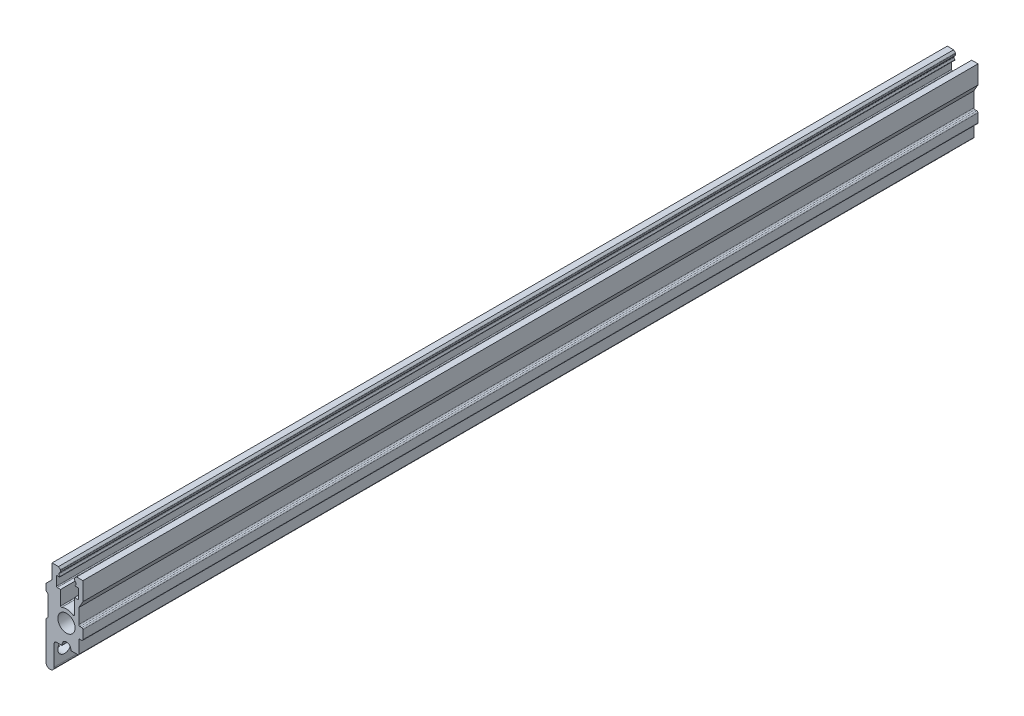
ISO-10303-21;
HEADER;
FILE_DESCRIPTION(('STEP AP214'),'2;1');
FILE_NAME('part.step','',(''),(''),'','','');
FILE_SCHEMA(('AUTOMOTIVE_DESIGN { 1 0 10303 214 1 1 1 1 }'));
ENDSEC;
DATA;
#1=APPLICATION_CONTEXT('core data for automotive mechanical design processes');
#2=APPLICATION_PROTOCOL_DEFINITION('international standard','automotive_design',2000,#1);
#3=PRODUCT_CONTEXT('',#1,'mechanical');
#4=PRODUCT('Part','Part','',(#3));
#5=PRODUCT_RELATED_PRODUCT_CATEGORY('part','',(#4));
#6=PRODUCT_DEFINITION_FORMATION('','',#4);
#7=PRODUCT_DEFINITION_CONTEXT('part definition',#1,'design');
#8=PRODUCT_DEFINITION('design','',#6,#7);
#9=PRODUCT_DEFINITION_SHAPE('','',#8);
#10=(LENGTH_UNIT() NAMED_UNIT(*) SI_UNIT(.MILLI.,.METRE.));
#11=(NAMED_UNIT(*) PLANE_ANGLE_UNIT() SI_UNIT($,.RADIAN.));
#12=(NAMED_UNIT(*) SI_UNIT($,.STERADIAN.) SOLID_ANGLE_UNIT());
#13=UNCERTAINTY_MEASURE_WITH_UNIT(LENGTH_MEASURE(1.E-05),#10,'distance_accuracy_value','');
#14=(GEOMETRIC_REPRESENTATION_CONTEXT(3) GLOBAL_UNCERTAINTY_ASSIGNED_CONTEXT((#13)) GLOBAL_UNIT_ASSIGNED_CONTEXT((#10,
#11,#12)) REPRESENTATION_CONTEXT('',''));
#15=CARTESIAN_POINT('',(0.,0.,0.));
#16=DIRECTION('',(0.,0.,1.));
#17=DIRECTION('',(1.,0.,0.));
#18=AXIS2_PLACEMENT_3D('',#15,#16,#17);
#19=CARTESIAN_POINT('',(0.,0.,109.22));
#20=DIRECTION('',(0.,0.,-1.));
#21=DIRECTION('',(-1.,0.,0.));
#22=AXIS2_PLACEMENT_3D('',#19,#20,#21);
#23=CYLINDRICAL_SURFACE('',#22,1.60000000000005);
#24=CARTESIAN_POINT('',(0.,0.,-99.22));
#25=DIRECTION('',(0.,0.,-1.));
#26=DIRECTION('',(-1.,0.,0.));
#27=AXIS2_PLACEMENT_3D('',#24,#25,#26);
#28=CIRCLE('',#27,1.60000000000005);
#29=CARTESIAN_POINT('',(-1.60000000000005,0.,-99.22));
#30=VERTEX_POINT('',#29);
#31=EDGE_CURVE('E674',#30,#30,#28,.T.);
#32=ORIENTED_EDGE('',*,*,#31,.T.);
#33=EDGE_LOOP('',(#32));
#34=FACE_BOUND('',#33,.T.);
#35=CARTESIAN_POINT('',(0.,0.,99.22));
#36=DIRECTION('',(0.,0.,1.));
#37=DIRECTION('',(1.,0.,0.));
#38=AXIS2_PLACEMENT_3D('',#35,#36,#37);
#39=CIRCLE('',#38,1.60000000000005);
#40=CARTESIAN_POINT('',(1.60000000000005,0.,99.22));
#41=VERTEX_POINT('',#40);
#42=EDGE_CURVE('E667',#41,#41,#39,.T.);
#43=ORIENTED_EDGE('',*,*,#42,.T.);
#44=EDGE_LOOP('',(#43));
#45=FACE_BOUND('',#44,.T.);
#46=ADVANCED_FACE('F37',(#34,#45),#23,.F.);
#47=CARTESIAN_POINT('',(-2.50086526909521,-5.7499999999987,109.22));
#48=DIRECTION('',(0.,0.,-1.));
#49=DIRECTION('',(-1.,0.,0.));
#50=AXIS2_PLACEMENT_3D('',#47,#48,#49);
#51=PLANE('',#50);
#52=CARTESIAN_POINT('',(0.,0.,109.22));
#53=DIRECTION('',(0.,0.,1.));
#54=DIRECTION('',(1.,0.,0.));
#55=AXIS2_PLACEMENT_3D('',#52,#53,#54);
#56=CIRCLE('',#55,2.1);
#57=CARTESIAN_POINT('',(2.1,0.,109.22));
#58=VERTEX_POINT('',#57);
#59=EDGE_CURVE('E668',#58,#58,#56,.T.);
#60=ORIENTED_EDGE('',*,*,#59,.F.);
#61=EDGE_LOOP('',(#60));
#62=FACE_BOUND('',#61,.T.);
#63=DIRECTION('',(0.,-1.,0.));
#64=VECTOR('',#63,1.);
#65=CARTESIAN_POINT('',(-3.50086526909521,11.0015907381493,109.22));
#66=LINE('',#65,#64);
#67=CARTESIAN_POINT('',(-3.50086526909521,11.0015907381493,109.22));
#68=VERTEX_POINT('',#67);
#69=CARTESIAN_POINT('',(-3.50086526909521,7.44159073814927,109.22));
#70=VERTEX_POINT('',#69);
#71=EDGE_CURVE('E52',#68,#70,#66,.T.);
#72=ORIENTED_EDGE('',*,*,#71,.T.);
#73=DIRECTION('',(-0.707106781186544,-0.707106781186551,0.));
#74=VECTOR('',#73,1.);
#75=CARTESIAN_POINT('',(-3.50086526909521,7.44159073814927,109.22));
#76=LINE('',#75,#74);
#77=CARTESIAN_POINT('',(-5.00086526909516,5.94159073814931,109.22));
#78=VERTEX_POINT('',#77);
#79=EDGE_CURVE('E435',#70,#78,#76,.T.);
#80=ORIENTED_EDGE('',*,*,#79,.T.);
#81=DIRECTION('',(0.,-1.,0.));
#82=VECTOR('',#81,1.);
#83=CARTESIAN_POINT('',(-5.00086526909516,8.5215907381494,109.22));
#84=LINE('',#83,#82);
#85=CARTESIAN_POINT('',(-5.00086526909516,4.44159073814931,109.22));
#86=VERTEX_POINT('',#85);
#87=EDGE_CURVE('E769',#78,#86,#84,.T.);
#88=ORIENTED_EDGE('',*,*,#87,.T.);
#89=DIRECTION('',(0.668928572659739,-0.743326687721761,0.));
#90=VECTOR('',#89,1.);
#91=CARTESIAN_POINT('',(-5.00086526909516,4.44159073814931,109.22));
#92=LINE('',#91,#90);
#93=CARTESIAN_POINT('',(-4.55073320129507,3.94139506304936,109.22));
#94=VERTEX_POINT('',#93);
#95=EDGE_CURVE('E771',#86,#94,#92,.T.);
#96=ORIENTED_EDGE('',*,*,#95,.T.);
#97=DIRECTION('',(-5.28322799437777E-05,-0.999999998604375,0.));
#98=VECTOR('',#97,1.);
#99=CARTESIAN_POINT('',(-4.55073320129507,3.94139506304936,109.22));
#100=LINE('',#99,#98);
#101=CARTESIAN_POINT('',(-4.55099736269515,-1.05860493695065,109.22));
#102=VERTEX_POINT('',#101);
#103=EDGE_CURVE('E773',#94,#102,#100,.T.);
#104=ORIENTED_EDGE('',*,*,#103,.T.);
#105=DIRECTION('',(-0.669000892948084,-0.743261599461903,0.));
#106=VECTOR('',#105,1.);
#107=CARTESIAN_POINT('',(-4.55099736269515,-1.05860493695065,109.22));
#108=LINE('',#107,#106);
#109=CARTESIAN_POINT('',(-5.00086526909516,-1.55840926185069,109.22));
#110=VERTEX_POINT('',#109);
#111=EDGE_CURVE('E775',#102,#110,#108,.T.);
#112=ORIENTED_EDGE('',*,*,#111,.T.);
#113=DIRECTION('',(0.,-1.,0.));
#114=VECTOR('',#113,1.);
#115=CARTESIAN_POINT('',(-5.00086526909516,-1.55840926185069,109.22));
#116=LINE('',#115,#114);
#117=CARTESIAN_POINT('',(-5.00086526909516,-10.75,109.22));
#118=VERTEX_POINT('',#117);
#119=EDGE_CURVE('E777',#110,#118,#116,.T.);
#120=ORIENTED_EDGE('',*,*,#119,.T.);
#121=CARTESIAN_POINT('',(-4.00086526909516,-10.75,109.22));
#122=DIRECTION('',(0.,0.,1.));
#123=DIRECTION('',(1.,0.,0.));
#124=AXIS2_PLACEMENT_3D('',#121,#122,#123);
#125=CIRCLE('',#124,1.);
#126=CARTESIAN_POINT('',(-3.00086526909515,-10.75,109.22));
#127=VERTEX_POINT('',#126);
#128=EDGE_CURVE('E779',#118,#127,#125,.T.);
#129=ORIENTED_EDGE('',*,*,#128,.T.);
#130=DIRECTION('',(0.,1.,0.));
#131=VECTOR('',#130,1.);
#132=CARTESIAN_POINT('',(-3.00086526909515,-10.75,109.22));
#133=LINE('',#132,#131);
#134=CARTESIAN_POINT('',(-3.00086526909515,-5.74999999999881,109.22));
#135=VERTEX_POINT('',#134);
#136=EDGE_CURVE('E781',#127,#135,#133,.T.);
#137=ORIENTED_EDGE('',*,*,#136,.T.);
#138=CARTESIAN_POINT('',(-2.50086526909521,-5.7499999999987,109.22));
#139=DIRECTION('',(0.,0.,-1.));
#140=DIRECTION('',(-1.,0.,0.));
#141=AXIS2_PLACEMENT_3D('',#138,#139,#140);
#142=CIRCLE('',#141,0.499999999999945);
#143=CARTESIAN_POINT('',(-2.50086526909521,-5.24999999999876,109.22));
#144=VERTEX_POINT('',#143);
#145=EDGE_CURVE('E700',#135,#144,#142,.T.);
#146=ORIENTED_EDGE('',*,*,#145,.T.);
#147=DIRECTION('',(1.,0.,0.));
#148=VECTOR('',#147,1.);
#149=CARTESIAN_POINT('',(-2.50086526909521,-5.24999999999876,109.22));
#150=LINE('',#149,#148);
#151=CARTESIAN_POINT('',(-1.15,-5.24999999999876,109.22));
#152=VERTEX_POINT('',#151);
#153=EDGE_CURVE('E703',#144,#152,#150,.T.);
#154=ORIENTED_EDGE('',*,*,#153,.T.);
#155=CARTESIAN_POINT('',(-1.15,-5.14999999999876,109.22));
#156=DIRECTION('',(0.,0.,1.));
#157=DIRECTION('',(-1.,0.,0.));
#158=AXIS2_PLACEMENT_3D('',#155,#156,#157);
#159=CIRCLE('',#158,0.1);
#160=CARTESIAN_POINT('',(-1.05,-5.14999999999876,109.22));
#161=VERTEX_POINT('',#160);
#162=EDGE_CURVE('E706',#152,#161,#159,.T.);
#163=ORIENTED_EDGE('',*,*,#162,.T.);
#164=DIRECTION('',(0.,1.,0.));
#165=VECTOR('',#164,1.);
#166=CARTESIAN_POINT('',(-1.05,-5.,109.22));
#167=LINE('',#166,#165);
#168=CARTESIAN_POINT('',(-1.05,-5.,109.22));
#169=VERTEX_POINT('',#168);
#170=EDGE_CURVE('E708',#161,#169,#167,.T.);
#171=ORIENTED_EDGE('',*,*,#170,.T.);
#172=CARTESIAN_POINT('',(0.,-5.,109.22));
#173=DIRECTION('',(0.,0.,-1.));
#174=DIRECTION('',(1.,0.,0.));
#175=AXIS2_PLACEMENT_3D('',#172,#173,#174);
#176=CIRCLE('',#175,1.05);
#177=CARTESIAN_POINT('',(1.05,-5.,109.22));
#178=VERTEX_POINT('',#177);
#179=EDGE_CURVE('E710',#169,#178,#176,.T.);
#180=ORIENTED_EDGE('',*,*,#179,.T.);
#181=DIRECTION('',(0.,-1.,0.));
#182=VECTOR('',#181,1.);
#183=CARTESIAN_POINT('',(1.05,-5.,109.22));
#184=LINE('',#183,#182);
#185=CARTESIAN_POINT('',(1.05,-5.14999999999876,109.22));
#186=VERTEX_POINT('',#185);
#187=EDGE_CURVE('E712',#178,#186,#184,.T.);
#188=ORIENTED_EDGE('',*,*,#187,.T.);
#189=CARTESIAN_POINT('',(1.15,-5.14999999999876,109.22));
#190=DIRECTION('',(0.,0.,1.));
#191=DIRECTION('',(-1.,0.,0.));
#192=AXIS2_PLACEMENT_3D('',#189,#190,#191);
#193=CIRCLE('',#192,0.1);
#194=CARTESIAN_POINT('',(1.15,-5.24999999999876,109.22));
#195=VERTEX_POINT('',#194);
#196=EDGE_CURVE('E714',#186,#195,#193,.T.);
#197=ORIENTED_EDGE('',*,*,#196,.T.);
#198=DIRECTION('',(1.,0.,0.));
#199=VECTOR('',#198,1.);
#200=CARTESIAN_POINT('',(1.15,-5.24999999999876,109.22));
#201=LINE('',#200,#199);
#202=CARTESIAN_POINT('',(2.79913473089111,-5.24999999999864,109.22));
#203=VERTEX_POINT('',#202);
#204=EDGE_CURVE('E716',#195,#203,#201,.T.);
#205=ORIENTED_EDGE('',*,*,#204,.T.);
#206=CARTESIAN_POINT('',(2.79913473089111,-5.04999999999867,109.22));
#207=DIRECTION('',(0.,0.,1.));
#208=DIRECTION('',(1.,0.,0.));
#209=AXIS2_PLACEMENT_3D('',#206,#207,#208);
#210=CIRCLE('',#209,0.199999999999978);
#211=CARTESIAN_POINT('',(2.99913473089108,-5.04999999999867,109.22));
#212=VERTEX_POINT('',#211);
#213=EDGE_CURVE('E718',#203,#212,#210,.T.);
#214=ORIENTED_EDGE('',*,*,#213,.T.);
#215=DIRECTION('',(0.,1.,0.));
#216=VECTOR('',#215,1.);
#217=CARTESIAN_POINT('',(2.99913473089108,-5.04999999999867,109.22));
#218=LINE('',#217,#216);
#219=CARTESIAN_POINT('',(2.99913473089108,-2.05840926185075,109.22));
#220=VERTEX_POINT('',#219);
#221=EDGE_CURVE('E720',#212,#220,#218,.T.);
#222=ORIENTED_EDGE('',*,*,#221,.T.);
#223=CARTESIAN_POINT('',(3.29913473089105,-2.05840926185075,109.22));
#224=DIRECTION('',(0.,0.,-1.));
#225=DIRECTION('',(1.,0.,0.));
#226=AXIS2_PLACEMENT_3D('',#223,#224,#225);
#227=CIRCLE('',#226,0.299999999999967);
#228=CARTESIAN_POINT('',(3.29913473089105,-1.75840926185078,109.22));
#229=VERTEX_POINT('',#228);
#230=EDGE_CURVE('E723',#220,#229,#227,.T.);
#231=ORIENTED_EDGE('',*,*,#230,.T.);
#232=DIRECTION('',(1.,0.,0.));
#233=VECTOR('',#232,1.);
#234=CARTESIAN_POINT('',(3.29913473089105,-1.75840926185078,109.22));
#235=LINE('',#234,#233);
#236=CARTESIAN_POINT('',(3.69913473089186,-1.75840926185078,109.22));
#237=VERTEX_POINT('',#236);
#238=EDGE_CURVE('E725',#229,#237,#235,.T.);
#239=ORIENTED_EDGE('',*,*,#238,.T.);
#240=CARTESIAN_POINT('',(3.69913473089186,-1.45840926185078,109.22));
#241=DIRECTION('',(0.,0.,1.));
#242=DIRECTION('',(-1.,0.,0.));
#243=AXIS2_PLACEMENT_3D('',#240,#241,#242);
#244=CIRCLE('',#243,0.3);
#245=CARTESIAN_POINT('',(3.99913473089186,-1.45840926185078,109.22));
#246=VERTEX_POINT('',#245);
#247=EDGE_CURVE('E727',#237,#246,#244,.T.);
#248=ORIENTED_EDGE('',*,*,#247,.T.);
#249=DIRECTION('',(0.,1.,0.));
#250=VECTOR('',#249,1.);
#251=CARTESIAN_POINT('',(3.99913473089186,0.641590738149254,109.22));
#252=LINE('',#251,#250);
#253=CARTESIAN_POINT('',(3.99913473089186,0.641590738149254,109.22));
#254=VERTEX_POINT('',#253);
#255=EDGE_CURVE('E729',#246,#254,#252,.T.);
#256=ORIENTED_EDGE('',*,*,#255,.T.);
#257=CARTESIAN_POINT('',(3.69913473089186,0.641590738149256,109.22));
#258=DIRECTION('',(0.,0.,1.));
#259=DIRECTION('',(-1.,0.,0.));
#260=AXIS2_PLACEMENT_3D('',#257,#258,#259);
#261=CIRCLE('',#260,0.3);
#262=CARTESIAN_POINT('',(3.69913473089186,0.941590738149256,109.22));
#263=VERTEX_POINT('',#262);
#264=EDGE_CURVE('E731',#254,#263,#261,.T.);
#265=ORIENTED_EDGE('',*,*,#264,.T.);
#266=DIRECTION('',(-1.,0.,0.));
#267=VECTOR('',#266,1.);
#268=CARTESIAN_POINT('',(3.69913473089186,0.941590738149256,109.22));
#269=LINE('',#268,#267);
#270=CARTESIAN_POINT('',(3.29913473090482,0.941590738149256,109.22));
#271=VERTEX_POINT('',#270);
#272=EDGE_CURVE('E733',#263,#271,#269,.T.);
#273=ORIENTED_EDGE('',*,*,#272,.T.);
#274=CARTESIAN_POINT('',(3.29913473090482,1.24159073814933,109.22));
#275=DIRECTION('',(0.,0.,-1.));
#276=DIRECTION('',(1.,0.,0.));
#277=AXIS2_PLACEMENT_3D('',#274,#275,#276);
#278=CIRCLE('',#277,0.300000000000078);
#279=CARTESIAN_POINT('',(2.99913473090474,1.24159073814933,109.22));
#280=VERTEX_POINT('',#279);
#281=EDGE_CURVE('E736',#271,#280,#278,.T.);
#282=ORIENTED_EDGE('',*,*,#281,.T.);
#283=DIRECTION('',(0.,1.,0.));
#284=VECTOR('',#283,1.);
#285=CARTESIAN_POINT('',(2.99913473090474,1.24159073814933,109.22));
#286=LINE('',#285,#284);
#287=CARTESIAN_POINT('',(2.99913473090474,4.80537295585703,109.22));
#288=VERTEX_POINT('',#287);
#289=EDGE_CURVE('E738',#280,#288,#286,.T.);
#290=ORIENTED_EDGE('',*,*,#289,.T.);
#291=DIRECTION('',(0.5,0.866025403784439,0.));
#292=VECTOR('',#291,1.);
#293=CARTESIAN_POINT('',(2.99913473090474,4.80537295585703,109.22));
#294=LINE('',#293,#292);
#295=CARTESIAN_POINT('',(3.9991347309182,6.53742376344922,109.22));
#296=VERTEX_POINT('',#295);
#297=EDGE_CURVE('E741',#288,#296,#294,.T.);
#298=ORIENTED_EDGE('',*,*,#297,.T.);
#299=DIRECTION('',(0.,1.,0.));
#300=VECTOR('',#299,1.);
#301=CARTESIAN_POINT('',(3.9991347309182,6.53742376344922,109.22));
#302=LINE('',#301,#300);
#303=CARTESIAN_POINT('',(3.9991347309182,11.0015907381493,109.22));
#304=VERTEX_POINT('',#303);
#305=EDGE_CURVE('E743',#296,#304,#302,.T.);
#306=ORIENTED_EDGE('',*,*,#305,.T.);
#307=DIRECTION('',(-1.,0.,0.));
#308=VECTOR('',#307,1.);
#309=CARTESIAN_POINT('',(3.9991347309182,11.0015907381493,109.22));
#310=LINE('',#309,#308);
#311=CARTESIAN_POINT('',(2.44913473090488,11.0015907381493,109.22));
#312=VERTEX_POINT('',#311);
#313=EDGE_CURVE('E452',#304,#312,#310,.T.);
#314=ORIENTED_EDGE('',*,*,#313,.T.);
#315=DIRECTION('',(0.707106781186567,0.707106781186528,0.));
#316=VECTOR('',#315,1.);
#317=CARTESIAN_POINT('',(1.94913473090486,10.5015907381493,109.22));
#318=LINE('',#317,#316);
#319=CARTESIAN_POINT('',(2.00771337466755,10.560169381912,109.22));
#320=VERTEX_POINT('',#319);
#321=EDGE_CURVE('E1133',#312,#320,#318,.F.);
#322=ORIENTED_EDGE('',*,*,#321,.T.);
#323=CARTESIAN_POINT('',(2.14913473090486,10.4187480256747,109.22));
#324=DIRECTION('',(0.,0.,-1.));
#325=DIRECTION('',(-1.,0.,0.));
#326=AXIS2_PLACEMENT_3D('',#323,#324,#325);
#327=CIRCLE('',#326,0.2);
#328=CARTESIAN_POINT('',(1.94913473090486,10.4187480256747,109.22));
#329=VERTEX_POINT('',#328);
#330=EDGE_CURVE('E1169',#320,#329,#327,.F.);
#331=ORIENTED_EDGE('',*,*,#330,.T.);
#332=DIRECTION('',(0.,-1.,0.));
#333=VECTOR('',#332,1.);
#334=CARTESIAN_POINT('',(1.94913473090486,11.7915907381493,109.22));
#335=LINE('',#334,#333);
#336=CARTESIAN_POINT('',(1.94913473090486,10.1341483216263,109.22));
#337=VERTEX_POINT('',#336);
#338=EDGE_CURVE('E746',#329,#337,#335,.T.);
#339=ORIENTED_EDGE('',*,*,#338,.T.);
#340=CARTESIAN_POINT('',(2.14913473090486,10.1341483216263,109.22));
#341=DIRECTION('',(0.,0.,-1.));
#342=DIRECTION('',(-1.,0.,0.));
#343=AXIS2_PLACEMENT_3D('',#340,#341,#342);
#344=CIRCLE('',#343,0.2);
#345=CARTESIAN_POINT('',(2.06342044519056,9.95344674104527,109.22));
#346=VERTEX_POINT('',#345);
#347=EDGE_CURVE('E1163',#337,#346,#344,.F.);
#348=ORIENTED_EDGE('',*,*,#347,.T.);
#349=CARTESIAN_POINT('',(1.84913473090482,9.50169278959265,109.22));
#350=DIRECTION('',(0.,0.,-1.));
#351=DIRECTION('',(-1.,0.,0.));
#352=AXIS2_PLACEMENT_3D('',#349,#350,#351);
#353=CIRCLE('',#352,0.5);
#354=CARTESIAN_POINT('',(2.34913473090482,9.50169278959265,109.22));
#355=VERTEX_POINT('',#354);
#356=EDGE_CURVE('E1127',#346,#355,#353,.T.);
#357=ORIENTED_EDGE('',*,*,#356,.T.);
#358=DIRECTION('',(0.,-1.,0.));
#359=VECTOR('',#358,1.);
#360=CARTESIAN_POINT('',(2.34913473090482,8.99159073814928,109.22));
#361=LINE('',#360,#359);
#362=CARTESIAN_POINT('',(2.34913473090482,9.48148868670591,109.22));
#363=VERTEX_POINT('',#362);
#364=EDGE_CURVE('E464',#355,#363,#361,.T.);
#365=ORIENTED_EDGE('',*,*,#364,.T.);
#366=CARTESIAN_POINT('',(1.84913473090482,9.48148868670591,109.22));
#367=DIRECTION('',(0.,0.,-1.));
#368=DIRECTION('',(-1.,0.,0.));
#369=AXIS2_PLACEMENT_3D('',#366,#367,#368);
#370=CIRCLE('',#369,0.5);
#371=CARTESIAN_POINT('',(2.16004280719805,9.08990706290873,109.22));
#372=VERTEX_POINT('',#371);
#373=EDGE_CURVE('E1131',#363,#372,#370,.T.);
#374=ORIENTED_EDGE('',*,*,#373,.T.);
#375=CARTESIAN_POINT('',(2.2222244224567,9.01159073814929,109.22));
#376=DIRECTION('',(0.,0.,-1.));
#377=DIRECTION('',(-1.,0.,0.));
#378=AXIS2_PLACEMENT_3D('',#375,#376,#377);
#379=CIRCLE('',#378,0.1);
#380=CARTESIAN_POINT('',(2.2222244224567,8.91159073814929,109.22));
#381=VERTEX_POINT('',#380);
#382=EDGE_CURVE('E60',#372,#381,#379,.F.);
#383=ORIENTED_EDGE('',*,*,#382,.T.);
#384=DIRECTION('',(1.,0.,0.));
#385=VECTOR('',#384,1.);
#386=CARTESIAN_POINT('',(1.94913473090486,8.91159073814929,109.22));
#387=LINE('',#386,#385);
#388=CARTESIAN_POINT('',(2.74913473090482,8.91159073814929,109.22));
#389=VERTEX_POINT('',#388);
#390=EDGE_CURVE('E749',#381,#389,#387,.T.);
#391=ORIENTED_EDGE('',*,*,#390,.T.);
#392=CARTESIAN_POINT('',(2.74913473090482,8.71159073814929,109.22));
#393=DIRECTION('',(0.,0.,-1.));
#394=DIRECTION('',(-1.,0.,0.));
#395=AXIS2_PLACEMENT_3D('',#392,#393,#394);
#396=CIRCLE('',#395,0.2);
#397=CARTESIAN_POINT('',(2.94913473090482,8.71159073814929,109.22));
#398=VERTEX_POINT('',#397);
#399=EDGE_CURVE('E991',#389,#398,#396,.T.);
#400=ORIENTED_EDGE('',*,*,#399,.T.);
#401=DIRECTION('',(0.,-1.,0.));
#402=VECTOR('',#401,1.);
#403=CARTESIAN_POINT('',(2.94913473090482,8.91159073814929,109.22));
#404=LINE('',#403,#402);
#405=CARTESIAN_POINT('',(2.94913473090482,6.61159073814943,109.22));
#406=VERTEX_POINT('',#405);
#407=EDGE_CURVE('E681',#398,#406,#404,.T.);
#408=ORIENTED_EDGE('',*,*,#407,.T.);
#409=CARTESIAN_POINT('',(2.74913473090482,6.61159073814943,109.22));
#410=DIRECTION('',(0.,0.,-1.));
#411=DIRECTION('',(-1.,0.,0.));
#412=AXIS2_PLACEMENT_3D('',#409,#410,#411);
#413=CIRCLE('',#412,0.2);
#414=CARTESIAN_POINT('',(2.74913473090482,6.41159073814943,109.22));
#415=VERTEX_POINT('',#414);
#416=EDGE_CURVE('E995',#406,#415,#413,.T.);
#417=ORIENTED_EDGE('',*,*,#416,.T.);
#418=DIRECTION('',(-1.,0.,0.));
#419=VECTOR('',#418,1.);
#420=CARTESIAN_POINT('',(-2.45086526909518,6.41159073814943,109.22));
#421=LINE('',#420,#419);
#422=CARTESIAN_POINT('',(1.94913473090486,6.41159073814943,109.22));
#423=VERTEX_POINT('',#422);
#424=EDGE_CURVE('E686',#415,#423,#421,.T.);
#425=ORIENTED_EDGE('',*,*,#424,.T.);
#426=DIRECTION('',(0.,-1.,0.));
#427=VECTOR('',#426,1.);
#428=CARTESIAN_POINT('',(1.94913473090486,6.61159073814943,109.22));
#429=LINE('',#428,#427);
#430=CARTESIAN_POINT('',(1.94913473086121,2.67965066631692,109.22));
#431=VERTEX_POINT('',#430);
#432=EDGE_CURVE('E751',#423,#431,#429,.T.);
#433=ORIENTED_EDGE('',*,*,#432,.T.);
#434=CARTESIAN_POINT('',(1.74913473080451,2.67965066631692,109.22));
#435=DIRECTION('',(0.,0.,-1.));
#436=DIRECTION('',(1.,0.,0.));
#437=AXIS2_PLACEMENT_3D('',#434,#435,#436);
#438=CIRCLE('',#437,0.200000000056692);
#439=CARTESIAN_POINT('',(1.63981381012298,2.51217249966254,109.22));
#440=VERTEX_POINT('',#439);
#441=EDGE_CURVE('E754',#431,#440,#438,.T.);
#442=ORIENTED_EDGE('',*,*,#441,.T.);
#443=CARTESIAN_POINT('',(0.,0.,109.22));
#444=DIRECTION('',(0.,0.,1.));
#445=DIRECTION('',(1.,0.,0.));
#446=AXIS2_PLACEMENT_3D('',#443,#444,#445);
#447=CIRCLE('',#446,2.99999999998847);
#448=CARTESIAN_POINT('',(-1.17268618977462,2.76130532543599,109.22));
#449=VERTEX_POINT('',#448);
#450=EDGE_CURVE('E756',#440,#449,#447,.T.);
#451=ORIENTED_EDGE('',*,*,#450,.T.);
#452=CARTESIAN_POINT('',(-1.25086526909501,2.94539234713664,109.22));
#453=DIRECTION('',(0.,0.,-1.));
#454=DIRECTION('',(1.,0.,0.));
#455=AXIS2_PLACEMENT_3D('',#452,#453,#454);
#456=CIRCLE('',#455,0.200000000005);
#457=CARTESIAN_POINT('',(-1.45086526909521,2.94539234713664,109.22));
#458=VERTEX_POINT('',#457);
#459=EDGE_CURVE('E758',#449,#458,#456,.T.);
#460=ORIENTED_EDGE('',*,*,#459,.T.);
#461=DIRECTION('',(0.,1.,0.));
#462=VECTOR('',#461,1.);
#463=CARTESIAN_POINT('',(-1.45086526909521,2.94539234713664,109.22));
#464=LINE('',#463,#462);
#465=CARTESIAN_POINT('',(-1.45086526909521,6.41159073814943,109.22));
#466=VERTEX_POINT('',#465);
#467=EDGE_CURVE('E760',#458,#466,#464,.T.);
#468=ORIENTED_EDGE('',*,*,#467,.T.);
#469=CARTESIAN_POINT('',(-2.25086526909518,6.41159073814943,109.22));
#470=VERTEX_POINT('',#469);
#471=EDGE_CURVE('E685',#466,#470,#421,.T.);
#472=ORIENTED_EDGE('',*,*,#471,.T.);
#473=CARTESIAN_POINT('',(-2.25086526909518,6.61159073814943,109.22));
#474=DIRECTION('',(0.,0.,-1.));
#475=DIRECTION('',(-1.,0.,0.));
#476=AXIS2_PLACEMENT_3D('',#473,#474,#475);
#477=CIRCLE('',#476,0.2);
#478=CARTESIAN_POINT('',(-2.45086526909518,6.61159073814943,109.22));
#479=VERTEX_POINT('',#478);
#480=EDGE_CURVE('E986',#470,#479,#477,.T.);
#481=ORIENTED_EDGE('',*,*,#480,.T.);
#482=DIRECTION('',(0.,1.,0.));
#483=VECTOR('',#482,1.);
#484=CARTESIAN_POINT('',(-2.45086526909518,8.91159073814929,109.22));
#485=LINE('',#484,#483);
#486=CARTESIAN_POINT('',(-2.45086526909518,8.71159073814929,109.22));
#487=VERTEX_POINT('',#486);
#488=EDGE_CURVE('E678',#479,#487,#485,.T.);
#489=ORIENTED_EDGE('',*,*,#488,.T.);
#490=CARTESIAN_POINT('',(-2.25086526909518,8.71159073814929,109.22));
#491=DIRECTION('',(0.,0.,-1.));
#492=DIRECTION('',(-1.,0.,0.));
#493=AXIS2_PLACEMENT_3D('',#490,#491,#492);
#494=CIRCLE('',#493,0.2);
#495=CARTESIAN_POINT('',(-2.25086526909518,8.91159073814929,109.22));
#496=VERTEX_POINT('',#495);
#497=EDGE_CURVE('E982',#487,#496,#494,.T.);
#498=ORIENTED_EDGE('',*,*,#497,.T.);
#499=DIRECTION('',(1.,0.,0.));
#500=VECTOR('',#499,1.);
#501=CARTESIAN_POINT('',(-2.35086526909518,8.91159073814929,109.22));
#502=LINE('',#501,#500);
#503=CARTESIAN_POINT('',(-1.72395496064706,8.91159073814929,109.22));
#504=VERTEX_POINT('',#503);
#505=EDGE_CURVE('E763',#496,#504,#502,.T.);
#506=ORIENTED_EDGE('',*,*,#505,.T.);
#507=CARTESIAN_POINT('',(-1.72395496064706,9.01159073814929,109.22));
#508=DIRECTION('',(0.,0.,-1.));
#509=DIRECTION('',(-1.,0.,0.));
#510=AXIS2_PLACEMENT_3D('',#507,#508,#509);
#511=CIRCLE('',#510,0.1);
#512=CARTESIAN_POINT('',(-1.66177334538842,9.08990706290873,109.22));
#513=VERTEX_POINT('',#512);
#514=EDGE_CURVE('E1193',#504,#513,#511,.F.);
#515=ORIENTED_EDGE('',*,*,#514,.T.);
#516=CARTESIAN_POINT('',(-1.35086526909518,9.48148868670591,109.22));
#517=DIRECTION('',(0.,0.,-1.));
#518=DIRECTION('',(-1.,0.,0.));
#519=AXIS2_PLACEMENT_3D('',#516,#517,#518);
#520=CIRCLE('',#519,0.5);
#521=CARTESIAN_POINT('',(-1.85086526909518,9.48148868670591,109.22));
#522=VERTEX_POINT('',#521);
#523=EDGE_CURVE('E1122',#513,#522,#520,.T.);
#524=ORIENTED_EDGE('',*,*,#523,.T.);
#525=DIRECTION('',(0.,1.,0.));
#526=VECTOR('',#525,1.);
#527=CARTESIAN_POINT('',(-1.85086526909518,8.99159073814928,109.22));
#528=LINE('',#527,#526);
#529=CARTESIAN_POINT('',(-1.85086526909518,9.50169278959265,109.22));
#530=VERTEX_POINT('',#529);
#531=EDGE_CURVE('E461',#522,#530,#528,.T.);
#532=ORIENTED_EDGE('',*,*,#531,.T.);
#533=CARTESIAN_POINT('',(-1.35086526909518,9.50169278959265,109.22));
#534=DIRECTION('',(0.,0.,-1.));
#535=DIRECTION('',(-1.,0.,0.));
#536=AXIS2_PLACEMENT_3D('',#533,#534,#535);
#537=CIRCLE('',#536,0.5);
#538=CARTESIAN_POINT('',(-1.56515098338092,9.95344674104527,109.22));
#539=VERTEX_POINT('',#538);
#540=EDGE_CURVE('E1116',#530,#539,#537,.T.);
#541=ORIENTED_EDGE('',*,*,#540,.T.);
#542=CARTESIAN_POINT('',(-1.65086526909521,10.1341483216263,109.22));
#543=DIRECTION('',(0.,0.,-1.));
#544=DIRECTION('',(-1.,0.,0.));
#545=AXIS2_PLACEMENT_3D('',#542,#543,#544);
#546=CIRCLE('',#545,0.2);
#547=CARTESIAN_POINT('',(-1.45086526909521,10.1341483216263,109.22));
#548=VERTEX_POINT('',#547);
#549=EDGE_CURVE('E1165',#539,#548,#546,.F.);
#550=ORIENTED_EDGE('',*,*,#549,.T.);
#551=DIRECTION('',(0.,1.,0.));
#552=VECTOR('',#551,1.);
#553=CARTESIAN_POINT('',(-1.45086526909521,8.91159073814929,109.22));
#554=LINE('',#553,#552);
#555=CARTESIAN_POINT('',(-1.45086526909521,10.4187480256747,109.22));
#556=VERTEX_POINT('',#555);
#557=EDGE_CURVE('E766',#548,#556,#554,.T.);
#558=ORIENTED_EDGE('',*,*,#557,.T.);
#559=CARTESIAN_POINT('',(-1.65086526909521,10.4187480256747,109.22));
#560=DIRECTION('',(0.,0.,-1.));
#561=DIRECTION('',(-1.,0.,0.));
#562=AXIS2_PLACEMENT_3D('',#559,#560,#561);
#563=CIRCLE('',#562,0.2);
#564=CARTESIAN_POINT('',(-1.50944391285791,10.560169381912,109.22));
#565=VERTEX_POINT('',#564);
#566=EDGE_CURVE('E1167',#556,#565,#563,.F.);
#567=ORIENTED_EDGE('',*,*,#566,.T.);
#568=DIRECTION('',(0.707106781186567,-0.707106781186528,0.));
#569=VECTOR('',#568,1.);
#570=CARTESIAN_POINT('',(-1.45086526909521,10.5015907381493,109.22));
#571=LINE('',#570,#569);
#572=CARTESIAN_POINT('',(-1.95086526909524,11.0015907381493,109.22));
#573=VERTEX_POINT('',#572);
#574=EDGE_CURVE('E1136',#565,#573,#571,.F.);
#575=ORIENTED_EDGE('',*,*,#574,.T.);
#576=EDGE_CURVE('E443',#573,#68,#310,.T.);
#577=ORIENTED_EDGE('',*,*,#576,.T.);
#578=EDGE_LOOP('',(#72,#80,#88,#96,#104,#112,#120,#129,#137,#146,#154,#163,#171,#180,#188,#197,
#205,#214,#222,#231,#239,#248,#256,#265,#273,#282,#290,#298,#306,#314,#322,#331,#339,#348,#357,
#365,#374,#383,#391,#400,#408,#417,#425,#433,#442,#451,#460,#468,#472,#481,#489,#498,#506,#515,
#524,#532,#541,#550,#558,#567,#575,#577));
#579=FACE_BOUND('',#578,.T.);
#580=ADVANCED_FACE('F441',(#62,#579),#51,.F.);
#581=CARTESIAN_POINT('',(-2.50086526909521,-5.7499999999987,-109.22));
#582=DIRECTION('',(0.,0.,-1.));
#583=DIRECTION('',(-1.,0.,0.));
#584=AXIS2_PLACEMENT_3D('',#581,#582,#583);
#585=PLANE('',#584);
#586=DIRECTION('',(-0.707106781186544,-0.707106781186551,0.));
#587=VECTOR('',#586,1.);
#588=CARTESIAN_POINT('',(-3.50086526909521,7.44159073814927,-109.22));
#589=LINE('',#588,#587);
#590=CARTESIAN_POINT('',(-3.50086526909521,7.44159073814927,-109.22));
#591=VERTEX_POINT('',#590);
#592=CARTESIAN_POINT('',(-5.00086526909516,5.94159073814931,-109.22));
#593=VERTEX_POINT('',#592);
#594=EDGE_CURVE('E444',#591,#593,#589,.T.);
#595=ORIENTED_EDGE('',*,*,#594,.F.);
#596=DIRECTION('',(0.,-1.,0.));
#597=VECTOR('',#596,1.);
#598=CARTESIAN_POINT('',(-3.50086526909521,11.0015907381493,-109.22));
#599=LINE('',#598,#597);
#600=CARTESIAN_POINT('',(-3.50086526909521,11.0015907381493,-109.22));
#601=VERTEX_POINT('',#600);
#602=EDGE_CURVE('E428',#601,#591,#599,.T.);
#603=ORIENTED_EDGE('',*,*,#602,.F.);
#604=DIRECTION('',(-1.,0.,0.));
#605=VECTOR('',#604,1.);
#606=CARTESIAN_POINT('',(3.9991347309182,11.0015907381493,-109.22));
#607=LINE('',#606,#605);
#608=CARTESIAN_POINT('',(-1.95086526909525,11.0015907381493,-109.22));
#609=VERTEX_POINT('',#608);
#610=EDGE_CURVE('E449',#609,#601,#607,.T.);
#611=ORIENTED_EDGE('',*,*,#610,.F.);
#612=DIRECTION('',(-0.707106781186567,0.707106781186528,0.));
#613=VECTOR('',#612,1.);
#614=CARTESIAN_POINT('',(6.14993009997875,2.90079536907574,-109.22));
#615=LINE('',#614,#613);
#616=CARTESIAN_POINT('',(-1.50944391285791,10.560169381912,-109.22));
#617=VERTEX_POINT('',#616);
#618=EDGE_CURVE('E1142',#609,#617,#615,.F.);
#619=ORIENTED_EDGE('',*,*,#618,.T.);
#620=CARTESIAN_POINT('',(-1.65086526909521,10.4187480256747,-109.22));
#621=DIRECTION('',(0.,0.,-1.));
#622=DIRECTION('',(-1.,0.,0.));
#623=AXIS2_PLACEMENT_3D('',#620,#621,#622);
#624=CIRCLE('',#623,0.2);
#625=CARTESIAN_POINT('',(-1.45086526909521,10.4187480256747,-109.22));
#626=VERTEX_POINT('',#625);
#627=EDGE_CURVE('E1157',#617,#626,#624,.T.);
#628=ORIENTED_EDGE('',*,*,#627,.T.);
#629=DIRECTION('',(0.,1.,0.));
#630=VECTOR('',#629,1.);
#631=CARTESIAN_POINT('',(-1.45086526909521,8.91159073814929,-109.22));
#632=LINE('',#631,#630);
#633=CARTESIAN_POINT('',(-1.45086526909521,10.1341483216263,-109.22));
#634=VERTEX_POINT('',#633);
#635=EDGE_CURVE('E845',#634,#626,#632,.T.);
#636=ORIENTED_EDGE('',*,*,#635,.F.);
#637=CARTESIAN_POINT('',(-1.65086526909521,10.1341483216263,-109.22));
#638=DIRECTION('',(0.,0.,-1.));
#639=DIRECTION('',(-1.,0.,0.));
#640=AXIS2_PLACEMENT_3D('',#637,#638,#639);
#641=CIRCLE('',#640,0.2);
#642=CARTESIAN_POINT('',(-1.56515098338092,9.95344674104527,-109.22));
#643=VERTEX_POINT('',#642);
#644=EDGE_CURVE('E1155',#634,#643,#641,.T.);
#645=ORIENTED_EDGE('',*,*,#644,.T.);
#646=CARTESIAN_POINT('',(-1.35086526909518,9.50169278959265,-109.22));
#647=DIRECTION('',(0.,0.,-1.));
#648=DIRECTION('',(-1.,0.,0.));
#649=AXIS2_PLACEMENT_3D('',#646,#647,#648);
#650=CIRCLE('',#649,0.5);
#651=CARTESIAN_POINT('',(-1.85086526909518,9.50169278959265,-109.22));
#652=VERTEX_POINT('',#651);
#653=EDGE_CURVE('E1114',#643,#652,#650,.F.);
#654=ORIENTED_EDGE('',*,*,#653,.T.);
#655=DIRECTION('',(0.,1.,0.));
#656=VECTOR('',#655,1.);
#657=CARTESIAN_POINT('',(-1.85086526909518,8.99159073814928,-109.22));
#658=LINE('',#657,#656);
#659=CARTESIAN_POINT('',(-1.85086526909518,9.48148868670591,-109.22));
#660=VERTEX_POINT('',#659);
#661=EDGE_CURVE('E460',#660,#652,#658,.T.);
#662=ORIENTED_EDGE('',*,*,#661,.F.);
#663=CARTESIAN_POINT('',(-1.35086526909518,9.48148868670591,-109.22));
#664=DIRECTION('',(0.,0.,-1.));
#665=DIRECTION('',(-1.,0.,0.));
#666=AXIS2_PLACEMENT_3D('',#663,#664,#665);
#667=CIRCLE('',#666,0.5);
#668=CARTESIAN_POINT('',(-1.66177334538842,9.08990706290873,-109.22));
#669=VERTEX_POINT('',#668);
#670=EDGE_CURVE('E1119',#660,#669,#667,.F.);
#671=ORIENTED_EDGE('',*,*,#670,.T.);
#672=CARTESIAN_POINT('',(-1.72395496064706,9.01159073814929,-109.22));
#673=DIRECTION('',(0.,0.,-1.));
#674=DIRECTION('',(-1.,0.,0.));
#675=AXIS2_PLACEMENT_3D('',#672,#673,#674);
#676=CIRCLE('',#675,0.1);
#677=CARTESIAN_POINT('',(-1.72395496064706,8.91159073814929,-109.22));
#678=VERTEX_POINT('',#677);
#679=EDGE_CURVE('E1188',#669,#678,#676,.T.);
#680=ORIENTED_EDGE('',*,*,#679,.T.);
#681=DIRECTION('',(1.,0.,0.));
#682=VECTOR('',#681,1.);
#683=CARTESIAN_POINT('',(-2.35086526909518,8.91159073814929,-109.22));
#684=LINE('',#683,#682);
#685=CARTESIAN_POINT('',(-2.25086526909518,8.91159073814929,-109.22));
#686=VERTEX_POINT('',#685);
#687=EDGE_CURVE('E842',#686,#678,#684,.T.);
#688=ORIENTED_EDGE('',*,*,#687,.F.);
#689=CARTESIAN_POINT('',(-2.25086526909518,8.71159073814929,-109.22));
#690=DIRECTION('',(0.,0.,-1.));
#691=DIRECTION('',(-1.,0.,0.));
#692=AXIS2_PLACEMENT_3D('',#689,#690,#691);
#693=CIRCLE('',#692,0.2);
#694=CARTESIAN_POINT('',(-2.45086526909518,8.71159073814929,-109.22));
#695=VERTEX_POINT('',#694);
#696=EDGE_CURVE('E980',#686,#695,#693,.F.);
#697=ORIENTED_EDGE('',*,*,#696,.T.);
#698=DIRECTION('',(0.,1.,0.));
#699=VECTOR('',#698,1.);
#700=CARTESIAN_POINT('',(-2.45086526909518,8.91159073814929,-109.22));
#701=LINE('',#700,#699);
#702=CARTESIAN_POINT('',(-2.45086526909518,6.61159073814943,-109.22));
#703=VERTEX_POINT('',#702);
#704=EDGE_CURVE('E689',#703,#695,#701,.T.);
#705=ORIENTED_EDGE('',*,*,#704,.F.);
#706=CARTESIAN_POINT('',(-2.25086526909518,6.61159073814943,-109.22));
#707=DIRECTION('',(0.,0.,-1.));
#708=DIRECTION('',(-1.,0.,0.));
#709=AXIS2_PLACEMENT_3D('',#706,#707,#708);
#710=CIRCLE('',#709,0.2);
#711=CARTESIAN_POINT('',(-2.25086526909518,6.41159073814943,-109.22));
#712=VERTEX_POINT('',#711);
#713=EDGE_CURVE('E984',#703,#712,#710,.F.);
#714=ORIENTED_EDGE('',*,*,#713,.T.);
#715=DIRECTION('',(-1.,0.,0.));
#716=VECTOR('',#715,1.);
#717=CARTESIAN_POINT('',(-2.45086526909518,6.41159073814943,-109.22));
#718=LINE('',#717,#716);
#719=CARTESIAN_POINT('',(-1.45086526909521,6.41159073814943,-109.22));
#720=VERTEX_POINT('',#719);
#721=EDGE_CURVE('E695',#720,#712,#718,.T.);
#722=ORIENTED_EDGE('',*,*,#721,.F.);
#723=DIRECTION('',(0.,1.,0.));
#724=VECTOR('',#723,1.);
#725=CARTESIAN_POINT('',(-1.45086526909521,2.94539234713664,-109.22));
#726=LINE('',#725,#724);
#727=CARTESIAN_POINT('',(-1.45086526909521,2.94539234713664,-109.22));
#728=VERTEX_POINT('',#727);
#729=EDGE_CURVE('E839',#728,#720,#726,.T.);
#730=ORIENTED_EDGE('',*,*,#729,.F.);
#731=CARTESIAN_POINT('',(-1.25086526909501,2.94539234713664,-109.22));
#732=DIRECTION('',(0.,0.,-1.));
#733=DIRECTION('',(1.,0.,0.));
#734=AXIS2_PLACEMENT_3D('',#731,#732,#733);
#735=CIRCLE('',#734,0.200000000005);
#736=CARTESIAN_POINT('',(-1.17268618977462,2.76130532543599,-109.22));
#737=VERTEX_POINT('',#736);
#738=EDGE_CURVE('E837',#737,#728,#735,.T.);
#739=ORIENTED_EDGE('',*,*,#738,.F.);
#740=CARTESIAN_POINT('',(0.,0.,-109.22));
#741=DIRECTION('',(0.,0.,1.));
#742=DIRECTION('',(1.,0.,0.));
#743=AXIS2_PLACEMENT_3D('',#740,#741,#742);
#744=CIRCLE('',#743,2.99999999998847);
#745=CARTESIAN_POINT('',(1.63981381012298,2.51217249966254,-109.22));
#746=VERTEX_POINT('',#745);
#747=EDGE_CURVE('E835',#746,#737,#744,.T.);
#748=ORIENTED_EDGE('',*,*,#747,.F.);
#749=CARTESIAN_POINT('',(1.74913473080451,2.67965066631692,-109.22));
#750=DIRECTION('',(0.,0.,-1.));
#751=DIRECTION('',(1.,0.,0.));
#752=AXIS2_PLACEMENT_3D('',#749,#750,#751);
#753=CIRCLE('',#752,0.200000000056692);
#754=CARTESIAN_POINT('',(1.94913473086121,2.67965066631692,-109.22));
#755=VERTEX_POINT('',#754);
#756=EDGE_CURVE('E833',#755,#746,#753,.T.);
#757=ORIENTED_EDGE('',*,*,#756,.F.);
#758=DIRECTION('',(0.,-1.,0.));
#759=VECTOR('',#758,1.);
#760=CARTESIAN_POINT('',(1.94913473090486,6.61159073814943,-109.22));
#761=LINE('',#760,#759);
#762=CARTESIAN_POINT('',(1.94913473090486,6.41159073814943,-109.22));
#763=VERTEX_POINT('',#762);
#764=EDGE_CURVE('E831',#763,#755,#761,.T.);
#765=ORIENTED_EDGE('',*,*,#764,.F.);
#766=CARTESIAN_POINT('',(2.74913473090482,6.41159073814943,-109.22));
#767=VERTEX_POINT('',#766);
#768=EDGE_CURVE('E682',#767,#763,#718,.T.);
#769=ORIENTED_EDGE('',*,*,#768,.F.);
#770=CARTESIAN_POINT('',(2.74913473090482,6.61159073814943,-109.22));
#771=DIRECTION('',(0.,0.,-1.));
#772=DIRECTION('',(-1.,0.,0.));
#773=AXIS2_PLACEMENT_3D('',#770,#771,#772);
#774=CIRCLE('',#773,0.2);
#775=CARTESIAN_POINT('',(2.94913473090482,6.61159073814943,-109.22));
#776=VERTEX_POINT('',#775);
#777=EDGE_CURVE('E993',#767,#776,#774,.F.);
#778=ORIENTED_EDGE('',*,*,#777,.T.);
#779=DIRECTION('',(0.,-1.,0.));
#780=VECTOR('',#779,1.);
#781=CARTESIAN_POINT('',(2.94913473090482,8.91159073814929,-109.22));
#782=LINE('',#781,#780);
#783=CARTESIAN_POINT('',(2.94913473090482,8.71159073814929,-109.22));
#784=VERTEX_POINT('',#783);
#785=EDGE_CURVE('E692',#784,#776,#782,.T.);
#786=ORIENTED_EDGE('',*,*,#785,.F.);
#787=CARTESIAN_POINT('',(2.74913473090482,8.71159073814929,-109.22));
#788=DIRECTION('',(0.,0.,-1.));
#789=DIRECTION('',(-1.,0.,0.));
#790=AXIS2_PLACEMENT_3D('',#787,#788,#789);
#791=CIRCLE('',#790,0.2);
#792=CARTESIAN_POINT('',(2.74913473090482,8.91159073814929,-109.22));
#793=VERTEX_POINT('',#792);
#794=EDGE_CURVE('E988',#784,#793,#791,.F.);
#795=ORIENTED_EDGE('',*,*,#794,.T.);
#796=DIRECTION('',(1.,0.,0.));
#797=VECTOR('',#796,1.);
#798=CARTESIAN_POINT('',(1.94913473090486,8.91159073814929,-109.22));
#799=LINE('',#798,#797);
#800=CARTESIAN_POINT('',(2.2222244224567,8.91159073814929,-109.22));
#801=VERTEX_POINT('',#800);
#802=EDGE_CURVE('E829',#801,#793,#799,.T.);
#803=ORIENTED_EDGE('',*,*,#802,.F.);
#804=CARTESIAN_POINT('',(2.2222244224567,9.01159073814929,-109.22));
#805=DIRECTION('',(0.,0.,-1.));
#806=DIRECTION('',(-1.,0.,0.));
#807=AXIS2_PLACEMENT_3D('',#804,#805,#806);
#808=CIRCLE('',#807,0.1);
#809=CARTESIAN_POINT('',(2.16004280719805,9.08990706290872,-109.22));
#810=VERTEX_POINT('',#809);
#811=EDGE_CURVE('E1186',#801,#810,#808,.T.);
#812=ORIENTED_EDGE('',*,*,#811,.T.);
#813=CARTESIAN_POINT('',(1.84913473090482,9.48148868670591,-109.22));
#814=DIRECTION('',(0.,0.,-1.));
#815=DIRECTION('',(-1.,0.,0.));
#816=AXIS2_PLACEMENT_3D('',#813,#814,#815);
#817=CIRCLE('',#816,0.5);
#818=CARTESIAN_POINT('',(2.34913473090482,9.48148868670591,-109.22));
#819=VERTEX_POINT('',#818);
#820=EDGE_CURVE('E1129',#810,#819,#817,.F.);
#821=ORIENTED_EDGE('',*,*,#820,.T.);
#822=DIRECTION('',(0.,-1.,0.));
#823=VECTOR('',#822,1.);
#824=CARTESIAN_POINT('',(2.34913473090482,8.99159073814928,-109.22));
#825=LINE('',#824,#823);
#826=CARTESIAN_POINT('',(2.34913473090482,9.50169278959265,-109.22));
#827=VERTEX_POINT('',#826);
#828=EDGE_CURVE('E465',#827,#819,#825,.T.);
#829=ORIENTED_EDGE('',*,*,#828,.F.);
#830=CARTESIAN_POINT('',(1.84913473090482,9.50169278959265,-109.22));
#831=DIRECTION('',(0.,0.,-1.));
#832=DIRECTION('',(-1.,0.,0.));
#833=AXIS2_PLACEMENT_3D('',#830,#831,#832);
#834=CIRCLE('',#833,0.5);
#835=CARTESIAN_POINT('',(2.06342044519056,9.95344674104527,-109.22));
#836=VERTEX_POINT('',#835);
#837=EDGE_CURVE('E1124',#827,#836,#834,.F.);
#838=ORIENTED_EDGE('',*,*,#837,.T.);
#839=CARTESIAN_POINT('',(2.14913473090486,10.1341483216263,-109.22));
#840=DIRECTION('',(0.,0.,-1.));
#841=DIRECTION('',(-1.,0.,0.));
#842=AXIS2_PLACEMENT_3D('',#839,#840,#841);
#843=CIRCLE('',#842,0.2);
#844=CARTESIAN_POINT('',(1.94913473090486,10.1341483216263,-109.22));
#845=VERTEX_POINT('',#844);
#846=EDGE_CURVE('E1153',#836,#845,#843,.T.);
#847=ORIENTED_EDGE('',*,*,#846,.T.);
#848=DIRECTION('',(0.,-1.,0.));
#849=VECTOR('',#848,1.);
#850=CARTESIAN_POINT('',(1.94913473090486,11.7915907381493,-109.22));
#851=LINE('',#850,#849);
#852=CARTESIAN_POINT('',(1.94913473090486,10.4187480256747,-109.22));
#853=VERTEX_POINT('',#852);
#854=EDGE_CURVE('E826',#853,#845,#851,.T.);
#855=ORIENTED_EDGE('',*,*,#854,.F.);
#856=CARTESIAN_POINT('',(2.14913473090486,10.4187480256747,-109.22));
#857=DIRECTION('',(0.,0.,-1.));
#858=DIRECTION('',(-1.,0.,0.));
#859=AXIS2_PLACEMENT_3D('',#856,#857,#858);
#860=CIRCLE('',#859,0.2);
#861=CARTESIAN_POINT('',(2.00771337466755,10.560169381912,-109.22));
#862=VERTEX_POINT('',#861);
#863=EDGE_CURVE('E1159',#853,#862,#860,.T.);
#864=ORIENTED_EDGE('',*,*,#863,.T.);
#865=DIRECTION('',(-0.707106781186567,-0.707106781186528,0.));
#866=VECTOR('',#865,1.);
#867=CARTESIAN_POINT('',(-8.40166063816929,0.150795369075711,-109.22));
#868=LINE('',#867,#866);
#869=CARTESIAN_POINT('',(2.44913473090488,11.0015907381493,-109.22));
#870=VERTEX_POINT('',#869);
#871=EDGE_CURVE('E1140',#862,#870,#868,.F.);
#872=ORIENTED_EDGE('',*,*,#871,.T.);
#873=CARTESIAN_POINT('',(3.9991347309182,11.0015907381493,-109.22));
#874=VERTEX_POINT('',#873);
#875=EDGE_CURVE('E456',#874,#870,#607,.T.);
#876=ORIENTED_EDGE('',*,*,#875,.F.);
#877=DIRECTION('',(0.,1.,0.));
#878=VECTOR('',#877,1.);
#879=CARTESIAN_POINT('',(3.9991347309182,6.53742376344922,-109.22));
#880=LINE('',#879,#878);
#881=CARTESIAN_POINT('',(3.9991347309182,6.53742376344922,-109.22));
#882=VERTEX_POINT('',#881);
#883=EDGE_CURVE('E823',#882,#874,#880,.T.);
#884=ORIENTED_EDGE('',*,*,#883,.F.);
#885=DIRECTION('',(0.5,0.866025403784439,0.));
#886=VECTOR('',#885,1.);
#887=CARTESIAN_POINT('',(2.99913473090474,4.80537295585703,-109.22));
#888=LINE('',#887,#886);
#889=CARTESIAN_POINT('',(2.99913473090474,4.80537295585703,-109.22));
#890=VERTEX_POINT('',#889);
#891=EDGE_CURVE('E821',#890,#882,#888,.T.);
#892=ORIENTED_EDGE('',*,*,#891,.F.);
#893=DIRECTION('',(0.,1.,0.));
#894=VECTOR('',#893,1.);
#895=CARTESIAN_POINT('',(2.99913473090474,1.24159073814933,-109.22));
#896=LINE('',#895,#894);
#897=CARTESIAN_POINT('',(2.99913473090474,1.24159073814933,-109.22));
#898=VERTEX_POINT('',#897);
#899=EDGE_CURVE('E819',#898,#890,#896,.T.);
#900=ORIENTED_EDGE('',*,*,#899,.F.);
#901=CARTESIAN_POINT('',(3.29913473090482,1.24159073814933,-109.22));
#902=DIRECTION('',(0.,0.,-1.));
#903=DIRECTION('',(1.,0.,0.));
#904=AXIS2_PLACEMENT_3D('',#901,#902,#903);
#905=CIRCLE('',#904,0.300000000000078);
#906=CARTESIAN_POINT('',(3.29913473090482,0.941590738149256,-109.22));
#907=VERTEX_POINT('',#906);
#908=EDGE_CURVE('E817',#907,#898,#905,.T.);
#909=ORIENTED_EDGE('',*,*,#908,.F.);
#910=DIRECTION('',(-1.,0.,0.));
#911=VECTOR('',#910,1.);
#912=CARTESIAN_POINT('',(3.69913473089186,0.941590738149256,-109.22));
#913=LINE('',#912,#911);
#914=CARTESIAN_POINT('',(3.69913473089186,0.941590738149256,-109.22));
#915=VERTEX_POINT('',#914);
#916=EDGE_CURVE('E815',#915,#907,#913,.T.);
#917=ORIENTED_EDGE('',*,*,#916,.F.);
#918=CARTESIAN_POINT('',(3.69913473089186,0.641590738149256,-109.22));
#919=DIRECTION('',(0.,0.,1.));
#920=DIRECTION('',(-1.,0.,0.));
#921=AXIS2_PLACEMENT_3D('',#918,#919,#920);
#922=CIRCLE('',#921,0.3);
#923=CARTESIAN_POINT('',(3.99913473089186,0.641590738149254,-109.22));
#924=VERTEX_POINT('',#923);
#925=EDGE_CURVE('E813',#924,#915,#922,.T.);
#926=ORIENTED_EDGE('',*,*,#925,.F.);
#927=DIRECTION('',(0.,1.,0.));
#928=VECTOR('',#927,1.);
#929=CARTESIAN_POINT('',(3.99913473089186,0.641590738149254,-109.22));
#930=LINE('',#929,#928);
#931=CARTESIAN_POINT('',(3.99913473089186,-1.45840926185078,-109.22));
#932=VERTEX_POINT('',#931);
#933=EDGE_CURVE('E811',#932,#924,#930,.T.);
#934=ORIENTED_EDGE('',*,*,#933,.F.);
#935=CARTESIAN_POINT('',(3.69913473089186,-1.45840926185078,-109.22));
#936=DIRECTION('',(0.,0.,1.));
#937=DIRECTION('',(-1.,0.,0.));
#938=AXIS2_PLACEMENT_3D('',#935,#936,#937);
#939=CIRCLE('',#938,0.3);
#940=CARTESIAN_POINT('',(3.69913473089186,-1.75840926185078,-109.22));
#941=VERTEX_POINT('',#940);
#942=EDGE_CURVE('E809',#941,#932,#939,.T.);
#943=ORIENTED_EDGE('',*,*,#942,.F.);
#944=DIRECTION('',(1.,0.,0.));
#945=VECTOR('',#944,1.);
#946=CARTESIAN_POINT('',(3.29913473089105,-1.75840926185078,-109.22));
#947=LINE('',#946,#945);
#948=CARTESIAN_POINT('',(3.29913473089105,-1.75840926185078,-109.22));
#949=VERTEX_POINT('',#948);
#950=EDGE_CURVE('E807',#949,#941,#947,.T.);
#951=ORIENTED_EDGE('',*,*,#950,.F.);
#952=CARTESIAN_POINT('',(3.29913473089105,-2.05840926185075,-109.22));
#953=DIRECTION('',(0.,0.,-1.));
#954=DIRECTION('',(1.,0.,0.));
#955=AXIS2_PLACEMENT_3D('',#952,#953,#954);
#956=CIRCLE('',#955,0.299999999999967);
#957=CARTESIAN_POINT('',(2.99913473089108,-2.05840926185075,-109.22));
#958=VERTEX_POINT('',#957);
#959=EDGE_CURVE('E805',#958,#949,#956,.T.);
#960=ORIENTED_EDGE('',*,*,#959,.F.);
#961=DIRECTION('',(0.,1.,0.));
#962=VECTOR('',#961,1.);
#963=CARTESIAN_POINT('',(2.99913473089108,-5.04999999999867,-109.22));
#964=LINE('',#963,#962);
#965=CARTESIAN_POINT('',(2.99913473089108,-5.04999999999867,-109.22));
#966=VERTEX_POINT('',#965);
#967=EDGE_CURVE('E802',#966,#958,#964,.T.);
#968=ORIENTED_EDGE('',*,*,#967,.F.);
#969=CARTESIAN_POINT('',(2.79913473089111,-5.04999999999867,-109.22));
#970=DIRECTION('',(0.,0.,1.));
#971=DIRECTION('',(1.,0.,0.));
#972=AXIS2_PLACEMENT_3D('',#969,#970,#971);
#973=CIRCLE('',#972,0.199999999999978);
#974=CARTESIAN_POINT('',(2.79913473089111,-5.24999999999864,-109.22));
#975=VERTEX_POINT('',#974);
#976=EDGE_CURVE('E800',#975,#966,#973,.T.);
#977=ORIENTED_EDGE('',*,*,#976,.F.);
#978=DIRECTION('',(1.,0.,0.));
#979=VECTOR('',#978,1.);
#980=CARTESIAN_POINT('',(1.15,-5.24999999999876,-109.22));
#981=LINE('',#980,#979);
#982=CARTESIAN_POINT('',(1.15,-5.24999999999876,-109.22));
#983=VERTEX_POINT('',#982);
#984=EDGE_CURVE('E798',#983,#975,#981,.T.);
#985=ORIENTED_EDGE('',*,*,#984,.F.);
#986=CARTESIAN_POINT('',(1.15,-5.14999999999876,-109.22));
#987=DIRECTION('',(0.,0.,1.));
#988=DIRECTION('',(-1.,0.,0.));
#989=AXIS2_PLACEMENT_3D('',#986,#987,#988);
#990=CIRCLE('',#989,0.1);
#991=CARTESIAN_POINT('',(1.05,-5.14999999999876,-109.22));
#992=VERTEX_POINT('',#991);
#993=EDGE_CURVE('E796',#992,#983,#990,.T.);
#994=ORIENTED_EDGE('',*,*,#993,.F.);
#995=DIRECTION('',(0.,-1.,0.));
#996=VECTOR('',#995,1.);
#997=CARTESIAN_POINT('',(1.05,-5.,-109.22));
#998=LINE('',#997,#996);
#999=CARTESIAN_POINT('',(1.05,-5.,-109.22));
#1000=VERTEX_POINT('',#999);
#1001=EDGE_CURVE('E794',#1000,#992,#998,.T.);
#1002=ORIENTED_EDGE('',*,*,#1001,.F.);
#1003=CARTESIAN_POINT('',(0.,-5.,-109.22));
#1004=DIRECTION('',(0.,0.,-1.));
#1005=DIRECTION('',(1.,0.,0.));
#1006=AXIS2_PLACEMENT_3D('',#1003,#1004,#1005);
#1007=CIRCLE('',#1006,1.05);
#1008=CARTESIAN_POINT('',(-1.05,-5.,-109.22));
#1009=VERTEX_POINT('',#1008);
#1010=EDGE_CURVE('E792',#1009,#1000,#1007,.T.);
#1011=ORIENTED_EDGE('',*,*,#1010,.F.);
#1012=DIRECTION('',(0.,1.,0.));
#1013=VECTOR('',#1012,1.);
#1014=CARTESIAN_POINT('',(-1.05,-5.,-109.22));
#1015=LINE('',#1014,#1013);
#1016=CARTESIAN_POINT('',(-1.05,-5.14999999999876,-109.22));
#1017=VERTEX_POINT('',#1016);
#1018=EDGE_CURVE('E790',#1017,#1009,#1015,.T.);
#1019=ORIENTED_EDGE('',*,*,#1018,.F.);
#1020=CARTESIAN_POINT('',(-1.15,-5.14999999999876,-109.22));
#1021=DIRECTION('',(0.,0.,1.));
#1022=DIRECTION('',(-1.,0.,0.));
#1023=AXIS2_PLACEMENT_3D('',#1020,#1021,#1022);
#1024=CIRCLE('',#1023,0.1);
#1025=CARTESIAN_POINT('',(-1.15,-5.24999999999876,-109.22));
#1026=VERTEX_POINT('',#1025);
#1027=EDGE_CURVE('E788',#1026,#1017,#1024,.T.);
#1028=ORIENTED_EDGE('',*,*,#1027,.F.);
#1029=DIRECTION('',(1.,0.,0.));
#1030=VECTOR('',#1029,1.);
#1031=CARTESIAN_POINT('',(-2.50086526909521,-5.24999999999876,-109.22));
#1032=LINE('',#1031,#1030);
#1033=CARTESIAN_POINT('',(-2.50086526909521,-5.24999999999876,-109.22));
#1034=VERTEX_POINT('',#1033);
#1035=EDGE_CURVE('E786',#1034,#1026,#1032,.T.);
#1036=ORIENTED_EDGE('',*,*,#1035,.F.);
#1037=CARTESIAN_POINT('',(-2.50086526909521,-5.7499999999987,-109.22));
#1038=DIRECTION('',(0.,0.,-1.));
#1039=DIRECTION('',(-1.,0.,0.));
#1040=AXIS2_PLACEMENT_3D('',#1037,#1038,#1039);
#1041=CIRCLE('',#1040,0.499999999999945);
#1042=CARTESIAN_POINT('',(-3.00086526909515,-5.74999999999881,-109.22));
#1043=VERTEX_POINT('',#1042);
#1044=EDGE_CURVE('E699',#1043,#1034,#1041,.T.);
#1045=ORIENTED_EDGE('',*,*,#1044,.F.);
#1046=DIRECTION('',(0.,1.,0.));
#1047=VECTOR('',#1046,1.);
#1048=CARTESIAN_POINT('',(-3.00086526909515,-10.75,-109.22));
#1049=LINE('',#1048,#1047);
#1050=CARTESIAN_POINT('',(-3.00086526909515,-10.75,-109.22));
#1051=VERTEX_POINT('',#1050);
#1052=EDGE_CURVE('E704',#1051,#1043,#1049,.T.);
#1053=ORIENTED_EDGE('',*,*,#1052,.F.);
#1054=CARTESIAN_POINT('',(-4.00086526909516,-10.75,-109.22));
#1055=DIRECTION('',(0.,0.,1.));
#1056=DIRECTION('',(1.,0.,0.));
#1057=AXIS2_PLACEMENT_3D('',#1054,#1055,#1056);
#1058=CIRCLE('',#1057,1.);
#1059=CARTESIAN_POINT('',(-5.00086526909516,-10.75,-109.22));
#1060=VERTEX_POINT('',#1059);
#1061=EDGE_CURVE('E858',#1060,#1051,#1058,.T.);
#1062=ORIENTED_EDGE('',*,*,#1061,.F.);
#1063=DIRECTION('',(0.,-1.,0.));
#1064=VECTOR('',#1063,1.);
#1065=CARTESIAN_POINT('',(-5.00086526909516,-1.55840926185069,-109.22));
#1066=LINE('',#1065,#1064);
#1067=CARTESIAN_POINT('',(-5.00086526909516,-1.55840926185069,-109.22));
#1068=VERTEX_POINT('',#1067);
#1069=EDGE_CURVE('E856',#1068,#1060,#1066,.T.);
#1070=ORIENTED_EDGE('',*,*,#1069,.F.);
#1071=DIRECTION('',(-0.669000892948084,-0.743261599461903,0.));
#1072=VECTOR('',#1071,1.);
#1073=CARTESIAN_POINT('',(-4.55099736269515,-1.05860493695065,-109.22));
#1074=LINE('',#1073,#1072);
#1075=CARTESIAN_POINT('',(-4.55099736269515,-1.05860493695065,-109.22));
#1076=VERTEX_POINT('',#1075);
#1077=EDGE_CURVE('E854',#1076,#1068,#1074,.T.);
#1078=ORIENTED_EDGE('',*,*,#1077,.F.);
#1079=DIRECTION('',(-5.28322799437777E-05,-0.999999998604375,0.));
#1080=VECTOR('',#1079,1.);
#1081=CARTESIAN_POINT('',(-4.55073320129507,3.94139506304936,-109.22));
#1082=LINE('',#1081,#1080);
#1083=CARTESIAN_POINT('',(-4.55073320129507,3.94139506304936,-109.22));
#1084=VERTEX_POINT('',#1083);
#1085=EDGE_CURVE('E852',#1084,#1076,#1082,.T.);
#1086=ORIENTED_EDGE('',*,*,#1085,.F.);
#1087=DIRECTION('',(0.668928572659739,-0.743326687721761,0.));
#1088=VECTOR('',#1087,1.);
#1089=CARTESIAN_POINT('',(-5.00086526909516,4.44159073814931,-109.22));
#1090=LINE('',#1089,#1088);
#1091=CARTESIAN_POINT('',(-5.00086526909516,4.44159073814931,-109.22));
#1092=VERTEX_POINT('',#1091);
#1093=EDGE_CURVE('E850',#1092,#1084,#1090,.T.);
#1094=ORIENTED_EDGE('',*,*,#1093,.F.);
#1095=DIRECTION('',(0.,-1.,0.));
#1096=VECTOR('',#1095,1.);
#1097=CARTESIAN_POINT('',(-5.00086526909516,8.5215907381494,-109.22));
#1098=LINE('',#1097,#1096);
#1099=EDGE_CURVE('E848',#593,#1092,#1098,.T.);
#1100=ORIENTED_EDGE('',*,*,#1099,.F.);
#1101=EDGE_LOOP('',(#595,#603,#611,#619,#628,#636,#645,#654,#662,#671,#680,#688,#697,#705,#714,
#722,#730,#739,#748,#757,#765,#769,#778,#786,#795,#803,#812,#821,#829,#838,#847,#855,#864,#872,
#876,#884,#892,#900,#909,#917,#926,#934,#943,#951,#960,#968,#977,#985,#994,#1002,#1011,#1019,
#1028,#1036,#1045,#1053,#1062,#1070,#1078,#1086,#1094,#1100));
#1102=FACE_BOUND('',#1101,.T.);
#1103=CARTESIAN_POINT('',(0.,0.,-109.22));
#1104=DIRECTION('',(0.,0.,-1.));
#1105=DIRECTION('',(-1.,0.,0.));
#1106=AXIS2_PLACEMENT_3D('',#1103,#1104,#1105);
#1107=CIRCLE('',#1106,2.09999999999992);
#1108=CARTESIAN_POINT('',(-2.09999999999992,0.,-109.22));
#1109=VERTEX_POINT('',#1108);
#1110=EDGE_CURVE('E675',#1109,#1109,#1107,.T.);
#1111=ORIENTED_EDGE('',*,*,#1110,.F.);
#1112=EDGE_LOOP('',(#1111));
#1113=FACE_BOUND('',#1112,.T.);
#1114=ADVANCED_FACE('F1201',(#1102,#1113),#585,.T.);
#1115=CARTESIAN_POINT('',(-2.50086526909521,-5.7499999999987,109.22));
#1116=DIRECTION('',(0.,0.,-1.));
#1117=DIRECTION('',(-1.,0.,0.));
#1118=AXIS2_PLACEMENT_3D('',#1115,#1116,#1117);
#1119=CYLINDRICAL_SURFACE('',#1118,0.499999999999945);
#1120=ORIENTED_EDGE('',*,*,#1044,.T.);
#1121=DIRECTION('',(0.,0.,-1.));
#1122=VECTOR('',#1121,1.);
#1123=CARTESIAN_POINT('',(-2.50086526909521,-5.24999999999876,109.22));
#1124=LINE('',#1123,#1122);
#1125=EDGE_CURVE('E953',#144,#1034,#1124,.T.);
#1126=ORIENTED_EDGE('',*,*,#1125,.F.);
#1127=ORIENTED_EDGE('',*,*,#145,.F.);
#1128=DIRECTION('',(0.,0.,-1.));
#1129=VECTOR('',#1128,1.);
#1130=CARTESIAN_POINT('',(-3.00086526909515,-5.74999999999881,109.22));
#1131=LINE('',#1130,#1129);
#1132=EDGE_CURVE('E783',#135,#1043,#1131,.T.);
#1133=ORIENTED_EDGE('',*,*,#1132,.T.);
#1134=EDGE_LOOP('',(#1120,#1126,#1127,#1133));
#1135=FACE_BOUND('',#1134,.T.);
#1136=ADVANCED_FACE('F1349',(#1135),#1119,.F.);
#1137=CARTESIAN_POINT('',(-2.50086526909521,-5.24999999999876,109.22));
#1138=DIRECTION('',(0.,1.,0.));
#1139=DIRECTION('',(0.,0.,1.));
#1140=AXIS2_PLACEMENT_3D('',#1137,#1138,#1139);
#1141=PLANE('',#1140);
#1142=ORIENTED_EDGE('',*,*,#1035,.T.);
#1143=DIRECTION('',(0.,0.,-1.));
#1144=VECTOR('',#1143,1.);
#1145=CARTESIAN_POINT('',(-1.15,-5.24999999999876,109.22));
#1146=LINE('',#1145,#1144);
#1147=EDGE_CURVE('E950',#152,#1026,#1146,.T.);
#1148=ORIENTED_EDGE('',*,*,#1147,.F.);
#1149=ORIENTED_EDGE('',*,*,#153,.F.);
#1150=ORIENTED_EDGE('',*,*,#1125,.T.);
#1151=EDGE_LOOP('',(#1142,#1148,#1149,#1150));
#1152=FACE_BOUND('',#1151,.T.);
#1153=ADVANCED_FACE('F1352',(#1152),#1141,.F.);
#1154=CARTESIAN_POINT('',(-1.15,-5.14999999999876,109.22));
#1155=DIRECTION('',(0.,0.,-1.));
#1156=DIRECTION('',(-1.,0.,0.));
#1157=AXIS2_PLACEMENT_3D('',#1154,#1155,#1156);
#1158=CYLINDRICAL_SURFACE('',#1157,0.1);
#1159=ORIENTED_EDGE('',*,*,#1027,.T.);
#1160=DIRECTION('',(0.,0.,-1.));
#1161=VECTOR('',#1160,1.);
#1162=CARTESIAN_POINT('',(-1.05,-5.14999999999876,109.22));
#1163=LINE('',#1162,#1161);
#1164=EDGE_CURVE('E947',#161,#1017,#1163,.T.);
#1165=ORIENTED_EDGE('',*,*,#1164,.F.);
#1166=ORIENTED_EDGE('',*,*,#162,.F.);
#1167=ORIENTED_EDGE('',*,*,#1147,.T.);
#1168=EDGE_LOOP('',(#1159,#1165,#1166,#1167));
#1169=FACE_BOUND('',#1168,.T.);
#1170=ADVANCED_FACE('F1357',(#1169),#1158,.T.);
#1171=CARTESIAN_POINT('',(-1.05,-5.,109.22));
#1172=DIRECTION('',(-1.,0.,0.));
#1173=DIRECTION('',(0.,-1.,0.));
#1174=AXIS2_PLACEMENT_3D('',#1171,#1172,#1173);
#1175=PLANE('',#1174);
#1176=ORIENTED_EDGE('',*,*,#1018,.T.);
#1177=DIRECTION('',(0.,0.,-1.));
#1178=VECTOR('',#1177,1.);
#1179=CARTESIAN_POINT('',(-1.05,-5.,109.22));
#1180=LINE('',#1179,#1178);
#1181=EDGE_CURVE('E944',#169,#1009,#1180,.T.);
#1182=ORIENTED_EDGE('',*,*,#1181,.F.);
#1183=ORIENTED_EDGE('',*,*,#170,.F.);
#1184=ORIENTED_EDGE('',*,*,#1164,.T.);
#1185=EDGE_LOOP('',(#1176,#1182,#1183,#1184));
#1186=FACE_BOUND('',#1185,.T.);
#1187=ADVANCED_FACE('F1363',(#1186),#1175,.F.);
#1188=CARTESIAN_POINT('',(0.,-5.,109.22));
#1189=DIRECTION('',(0.,0.,-1.));
#1190=DIRECTION('',(-1.,0.,0.));
#1191=AXIS2_PLACEMENT_3D('',#1188,#1189,#1190);
#1192=CYLINDRICAL_SURFACE('',#1191,1.05);
#1193=ORIENTED_EDGE('',*,*,#1010,.T.);
#1194=DIRECTION('',(0.,0.,-1.));
#1195=VECTOR('',#1194,1.);
#1196=CARTESIAN_POINT('',(1.05,-5.,109.22));
#1197=LINE('',#1196,#1195);
#1198=EDGE_CURVE('E941',#178,#1000,#1197,.T.);
#1199=ORIENTED_EDGE('',*,*,#1198,.F.);
#1200=ORIENTED_EDGE('',*,*,#179,.F.);
#1201=ORIENTED_EDGE('',*,*,#1181,.T.);
#1202=EDGE_LOOP('',(#1193,#1199,#1200,#1201));
#1203=FACE_BOUND('',#1202,.T.);
#1204=ADVANCED_FACE('F1367',(#1203),#1192,.F.);
#1205=CARTESIAN_POINT('',(1.05,-5.,109.22));
#1206=DIRECTION('',(1.,0.,0.));
#1207=DIRECTION('',(0.,1.,0.));
#1208=AXIS2_PLACEMENT_3D('',#1205,#1206,#1207);
#1209=PLANE('',#1208);
#1210=ORIENTED_EDGE('',*,*,#1001,.T.);
#1211=DIRECTION('',(0.,0.,-1.));
#1212=VECTOR('',#1211,1.);
#1213=CARTESIAN_POINT('',(1.05,-5.14999999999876,109.22));
#1214=LINE('',#1213,#1212);
#1215=EDGE_CURVE('E938',#186,#992,#1214,.T.);
#1216=ORIENTED_EDGE('',*,*,#1215,.F.);
#1217=ORIENTED_EDGE('',*,*,#187,.F.);
#1218=ORIENTED_EDGE('',*,*,#1198,.T.);
#1219=EDGE_LOOP('',(#1210,#1216,#1217,#1218));
#1220=FACE_BOUND('',#1219,.T.);
#1221=ADVANCED_FACE('F1372',(#1220),#1209,.F.);
#1222=CARTESIAN_POINT('',(1.15,-5.14999999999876,109.22));
#1223=DIRECTION('',(0.,0.,-1.));
#1224=DIRECTION('',(-1.,0.,0.));
#1225=AXIS2_PLACEMENT_3D('',#1222,#1223,#1224);
#1226=CYLINDRICAL_SURFACE('',#1225,0.1);
#1227=ORIENTED_EDGE('',*,*,#993,.T.);
#1228=DIRECTION('',(0.,0.,-1.));
#1229=VECTOR('',#1228,1.);
#1230=CARTESIAN_POINT('',(1.15,-5.24999999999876,109.22));
#1231=LINE('',#1230,#1229);
#1232=EDGE_CURVE('E935',#195,#983,#1231,.T.);
#1233=ORIENTED_EDGE('',*,*,#1232,.F.);
#1234=ORIENTED_EDGE('',*,*,#196,.F.);
#1235=ORIENTED_EDGE('',*,*,#1215,.T.);
#1236=EDGE_LOOP('',(#1227,#1233,#1234,#1235));
#1237=FACE_BOUND('',#1236,.T.);
#1238=ADVANCED_FACE('F1378',(#1237),#1226,.T.);
#1239=CARTESIAN_POINT('',(1.15,-5.24999999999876,109.22));
#1240=DIRECTION('',(0.,1.,0.));
#1241=DIRECTION('',(-1.,0.,0.));
#1242=AXIS2_PLACEMENT_3D('',#1239,#1240,#1241);
#1243=PLANE('',#1242);
#1244=ORIENTED_EDGE('',*,*,#984,.T.);
#1245=DIRECTION('',(0.,0.,-1.));
#1246=VECTOR('',#1245,1.);
#1247=CARTESIAN_POINT('',(2.79913473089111,-5.24999999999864,109.22));
#1248=LINE('',#1247,#1246);
#1249=EDGE_CURVE('E932',#203,#975,#1248,.T.);
#1250=ORIENTED_EDGE('',*,*,#1249,.F.);
#1251=ORIENTED_EDGE('',*,*,#204,.F.);
#1252=ORIENTED_EDGE('',*,*,#1232,.T.);
#1253=EDGE_LOOP('',(#1244,#1250,#1251,#1252));
#1254=FACE_BOUND('',#1253,.T.);
#1255=ADVANCED_FACE('F1382',(#1254),#1243,.F.);
#1256=CARTESIAN_POINT('',(2.79913473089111,-5.04999999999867,109.22));
#1257=DIRECTION('',(0.,0.,-1.));
#1258=DIRECTION('',(-1.,0.,0.));
#1259=AXIS2_PLACEMENT_3D('',#1256,#1257,#1258);
#1260=CYLINDRICAL_SURFACE('',#1259,0.199999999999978);
#1261=ORIENTED_EDGE('',*,*,#976,.T.);
#1262=DIRECTION('',(0.,0.,-1.));
#1263=VECTOR('',#1262,1.);
#1264=CARTESIAN_POINT('',(2.99913473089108,-5.04999999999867,109.22));
#1265=LINE('',#1264,#1263);
#1266=EDGE_CURVE('E929',#212,#966,#1265,.T.);
#1267=ORIENTED_EDGE('',*,*,#1266,.F.);
#1268=ORIENTED_EDGE('',*,*,#213,.F.);
#1269=ORIENTED_EDGE('',*,*,#1249,.T.);
#1270=EDGE_LOOP('',(#1261,#1267,#1268,#1269));
#1271=FACE_BOUND('',#1270,.T.);
#1272=ADVANCED_FACE('F1387',(#1271),#1260,.T.);
#1273=CARTESIAN_POINT('',(2.99913473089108,-5.04999999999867,109.22));
#1274=DIRECTION('',(-1.,0.,0.));
#1275=DIRECTION('',(0.,0.,1.));
#1276=AXIS2_PLACEMENT_3D('',#1273,#1274,#1275);
#1277=PLANE('',#1276);
#1278=ORIENTED_EDGE('',*,*,#967,.T.);
#1279=DIRECTION('',(0.,0.,-1.));
#1280=VECTOR('',#1279,1.);
#1281=CARTESIAN_POINT('',(2.99913473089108,-2.05840926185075,109.22));
#1282=LINE('',#1281,#1280);
#1283=EDGE_CURVE('E925',#220,#958,#1282,.T.);
#1284=ORIENTED_EDGE('',*,*,#1283,.F.);
#1285=ORIENTED_EDGE('',*,*,#221,.F.);
#1286=ORIENTED_EDGE('',*,*,#1266,.T.);
#1287=EDGE_LOOP('',(#1278,#1284,#1285,#1286));
#1288=FACE_BOUND('',#1287,.T.);
#1289=ADVANCED_FACE('F1393',(#1288),#1277,.F.);
#1290=CARTESIAN_POINT('',(3.29913473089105,-2.05840926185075,109.22));
#1291=DIRECTION('',(0.,0.,-1.));
#1292=DIRECTION('',(-1.,0.,0.));
#1293=AXIS2_PLACEMENT_3D('',#1290,#1291,#1292);
#1294=CYLINDRICAL_SURFACE('',#1293,0.299999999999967);
#1295=ORIENTED_EDGE('',*,*,#959,.T.);
#1296=DIRECTION('',(0.,0.,-1.));
#1297=VECTOR('',#1296,1.);
#1298=CARTESIAN_POINT('',(3.29913473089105,-1.75840926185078,109.22));
#1299=LINE('',#1298,#1297);
#1300=EDGE_CURVE('E921',#229,#949,#1299,.T.);
#1301=ORIENTED_EDGE('',*,*,#1300,.F.);
#1302=ORIENTED_EDGE('',*,*,#230,.F.);
#1303=ORIENTED_EDGE('',*,*,#1283,.T.);
#1304=EDGE_LOOP('',(#1295,#1301,#1302,#1303));
#1305=FACE_BOUND('',#1304,.T.);
#1306=ADVANCED_FACE('F1397',(#1305),#1294,.F.);
#1307=CARTESIAN_POINT('',(3.29913473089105,-1.75840926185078,109.22));
#1308=DIRECTION('',(0.,1.,0.));
#1309=DIRECTION('',(0.,0.,1.));
#1310=AXIS2_PLACEMENT_3D('',#1307,#1308,#1309);
#1311=PLANE('',#1310);
#1312=ORIENTED_EDGE('',*,*,#950,.T.);
#1313=DIRECTION('',(0.,0.,-1.));
#1314=VECTOR('',#1313,1.);
#1315=CARTESIAN_POINT('',(3.69913473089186,-1.75840926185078,109.22));
#1316=LINE('',#1315,#1314);
#1317=EDGE_CURVE('E918',#237,#941,#1316,.T.);
#1318=ORIENTED_EDGE('',*,*,#1317,.F.);
#1319=ORIENTED_EDGE('',*,*,#238,.F.);
#1320=ORIENTED_EDGE('',*,*,#1300,.T.);
#1321=EDGE_LOOP('',(#1312,#1318,#1319,#1320));
#1322=FACE_BOUND('',#1321,.T.);
#1323=ADVANCED_FACE('F1402',(#1322),#1311,.F.);
#1324=CARTESIAN_POINT('',(3.69913473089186,-1.45840926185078,109.22));
#1325=DIRECTION('',(0.,0.,-1.));
#1326=DIRECTION('',(-1.,0.,0.));
#1327=AXIS2_PLACEMENT_3D('',#1324,#1325,#1326);
#1328=CYLINDRICAL_SURFACE('',#1327,0.3);
#1329=ORIENTED_EDGE('',*,*,#942,.T.);
#1330=DIRECTION('',(0.,0.,-1.));
#1331=VECTOR('',#1330,1.);
#1332=CARTESIAN_POINT('',(3.99913473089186,-1.45840926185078,109.22));
#1333=LINE('',#1332,#1331);
#1334=EDGE_CURVE('E915',#246,#932,#1333,.T.);
#1335=ORIENTED_EDGE('',*,*,#1334,.F.);
#1336=ORIENTED_EDGE('',*,*,#247,.F.);
#1337=ORIENTED_EDGE('',*,*,#1317,.T.);
#1338=EDGE_LOOP('',(#1329,#1335,#1336,#1337));
#1339=FACE_BOUND('',#1338,.T.);
#1340=ADVANCED_FACE('F1408',(#1339),#1328,.T.);
#1341=CARTESIAN_POINT('',(3.99913473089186,0.641590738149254,109.22));
#1342=DIRECTION('',(-1.,0.,0.));
#1343=DIRECTION('',(0.,0.,1.));
#1344=AXIS2_PLACEMENT_3D('',#1341,#1342,#1343);
#1345=PLANE('',#1344);
#1346=ORIENTED_EDGE('',*,*,#933,.T.);
#1347=DIRECTION('',(0.,0.,-1.));
#1348=VECTOR('',#1347,1.);
#1349=CARTESIAN_POINT('',(3.99913473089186,0.641590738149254,109.22));
#1350=LINE('',#1349,#1348);
#1351=EDGE_CURVE('E912',#254,#924,#1350,.T.);
#1352=ORIENTED_EDGE('',*,*,#1351,.F.);
#1353=ORIENTED_EDGE('',*,*,#255,.F.);
#1354=ORIENTED_EDGE('',*,*,#1334,.T.);
#1355=EDGE_LOOP('',(#1346,#1352,#1353,#1354));
#1356=FACE_BOUND('',#1355,.T.);
#1357=ADVANCED_FACE('F1412',(#1356),#1345,.F.);
#1358=CARTESIAN_POINT('',(3.69913473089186,0.641590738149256,109.22));
#1359=DIRECTION('',(0.,0.,-1.));
#1360=DIRECTION('',(-1.,0.,0.));
#1361=AXIS2_PLACEMENT_3D('',#1358,#1359,#1360);
#1362=CYLINDRICAL_SURFACE('',#1361,0.3);
#1363=ORIENTED_EDGE('',*,*,#925,.T.);
#1364=DIRECTION('',(0.,0.,-1.));
#1365=VECTOR('',#1364,1.);
#1366=CARTESIAN_POINT('',(3.69913473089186,0.941590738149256,109.22));
#1367=LINE('',#1366,#1365);
#1368=EDGE_CURVE('E909',#263,#915,#1367,.T.);
#1369=ORIENTED_EDGE('',*,*,#1368,.F.);
#1370=ORIENTED_EDGE('',*,*,#264,.F.);
#1371=ORIENTED_EDGE('',*,*,#1351,.T.);
#1372=EDGE_LOOP('',(#1363,#1369,#1370,#1371));
#1373=FACE_BOUND('',#1372,.T.);
#1374=ADVANCED_FACE('F1417',(#1373),#1362,.T.);
#1375=CARTESIAN_POINT('',(3.69913473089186,0.941590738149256,109.22));
#1376=DIRECTION('',(0.,-1.,0.));
#1377=DIRECTION('',(0.,0.,-1.));
#1378=AXIS2_PLACEMENT_3D('',#1375,#1376,#1377);
#1379=PLANE('',#1378);
#1380=ORIENTED_EDGE('',*,*,#916,.T.);
#1381=DIRECTION('',(0.,0.,-1.));
#1382=VECTOR('',#1381,1.);
#1383=CARTESIAN_POINT('',(3.29913473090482,0.941590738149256,109.22));
#1384=LINE('',#1383,#1382);
#1385=EDGE_CURVE('E906',#271,#907,#1384,.T.);
#1386=ORIENTED_EDGE('',*,*,#1385,.F.);
#1387=ORIENTED_EDGE('',*,*,#272,.F.);
#1388=ORIENTED_EDGE('',*,*,#1368,.T.);
#1389=EDGE_LOOP('',(#1380,#1386,#1387,#1388));
#1390=FACE_BOUND('',#1389,.T.);
#1391=ADVANCED_FACE('F1423',(#1390),#1379,.F.);
#1392=CARTESIAN_POINT('',(3.29913473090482,1.24159073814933,109.22));
#1393=DIRECTION('',(0.,0.,-1.));
#1394=DIRECTION('',(-1.,0.,0.));
#1395=AXIS2_PLACEMENT_3D('',#1392,#1393,#1394);
#1396=CYLINDRICAL_SURFACE('',#1395,0.300000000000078);
#1397=ORIENTED_EDGE('',*,*,#908,.T.);
#1398=DIRECTION('',(0.,0.,-1.));
#1399=VECTOR('',#1398,1.);
#1400=CARTESIAN_POINT('',(2.99913473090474,1.24159073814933,109.22));
#1401=LINE('',#1400,#1399);
#1402=EDGE_CURVE('E903',#280,#898,#1401,.T.);
#1403=ORIENTED_EDGE('',*,*,#1402,.F.);
#1404=ORIENTED_EDGE('',*,*,#281,.F.);
#1405=ORIENTED_EDGE('',*,*,#1385,.T.);
#1406=EDGE_LOOP('',(#1397,#1403,#1404,#1405));
#1407=FACE_BOUND('',#1406,.T.);
#1408=ADVANCED_FACE('F1427',(#1407),#1396,.F.);
#1409=CARTESIAN_POINT('',(2.99913473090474,1.24159073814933,109.22));
#1410=DIRECTION('',(-1.,0.,0.));
#1411=DIRECTION('',(0.,0.,1.));
#1412=AXIS2_PLACEMENT_3D('',#1409,#1410,#1411);
#1413=PLANE('',#1412);
#1414=ORIENTED_EDGE('',*,*,#899,.T.);
#1415=DIRECTION('',(0.,0.,-1.));
#1416=VECTOR('',#1415,1.);
#1417=CARTESIAN_POINT('',(2.99913473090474,4.80537295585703,109.22));
#1418=LINE('',#1417,#1416);
#1419=EDGE_CURVE('E900',#288,#890,#1418,.T.);
#1420=ORIENTED_EDGE('',*,*,#1419,.F.);
#1421=ORIENTED_EDGE('',*,*,#289,.F.);
#1422=ORIENTED_EDGE('',*,*,#1402,.T.);
#1423=EDGE_LOOP('',(#1414,#1420,#1421,#1422));
#1424=FACE_BOUND('',#1423,.T.);
#1425=ADVANCED_FACE('F1432',(#1424),#1413,.F.);
#1426=CARTESIAN_POINT('',(2.99913473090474,4.80537295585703,109.22));
#1427=DIRECTION('',(-0.866025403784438,0.5,0.));
#1428=DIRECTION('',(-0.5,-0.866025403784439,0.));
#1429=AXIS2_PLACEMENT_3D('',#1426,#1427,#1428);
#1430=PLANE('',#1429);
#1431=ORIENTED_EDGE('',*,*,#891,.T.);
#1432=DIRECTION('',(0.,0.,-1.));
#1433=VECTOR('',#1432,1.);
#1434=CARTESIAN_POINT('',(3.9991347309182,6.53742376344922,109.22));
#1435=LINE('',#1434,#1433);
#1436=EDGE_CURVE('E897',#296,#882,#1435,.T.);
#1437=ORIENTED_EDGE('',*,*,#1436,.F.);
#1438=ORIENTED_EDGE('',*,*,#297,.F.);
#1439=ORIENTED_EDGE('',*,*,#1419,.T.);
#1440=EDGE_LOOP('',(#1431,#1437,#1438,#1439));
#1441=FACE_BOUND('',#1440,.T.);
#1442=ADVANCED_FACE('F1437',(#1441),#1430,.F.);
#1443=CARTESIAN_POINT('',(3.9991347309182,6.53742376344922,109.22));
#1444=DIRECTION('',(-1.,0.,0.));
#1445=DIRECTION('',(0.,0.,1.));
#1446=AXIS2_PLACEMENT_3D('',#1443,#1444,#1445);
#1447=PLANE('',#1446);
#1448=ORIENTED_EDGE('',*,*,#883,.T.);
#1449=DIRECTION('',(0.,0.,-1.));
#1450=VECTOR('',#1449,1.);
#1451=CARTESIAN_POINT('',(3.9991347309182,11.0015907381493,109.22));
#1452=LINE('',#1451,#1450);
#1453=EDGE_CURVE('E455',#304,#874,#1452,.T.);
#1454=ORIENTED_EDGE('',*,*,#1453,.F.);
#1455=ORIENTED_EDGE('',*,*,#305,.F.);
#1456=ORIENTED_EDGE('',*,*,#1436,.T.);
#1457=EDGE_LOOP('',(#1448,#1454,#1455,#1456));
#1458=FACE_BOUND('',#1457,.T.);
#1459=ADVANCED_FACE('F1442',(#1458),#1447,.F.);
#1460=CARTESIAN_POINT('',(1.94913473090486,11.7915907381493,109.22));
#1461=DIRECTION('',(1.,0.,0.));
#1462=DIRECTION('',(0.,0.,-1.));
#1463=AXIS2_PLACEMENT_3D('',#1460,#1461,#1462);
#1464=PLANE('',#1463);
#1465=ORIENTED_EDGE('',*,*,#338,.F.);
#1466=DIRECTION('',(0.,0.,1.));
#1467=VECTOR('',#1466,1.);
#1468=CARTESIAN_POINT('',(1.94913473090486,10.4187480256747,-109.22));
#1469=LINE('',#1468,#1467);
#1470=EDGE_CURVE('E1150',#329,#853,#1469,.F.);
#1471=ORIENTED_EDGE('',*,*,#1470,.T.);
#1472=ORIENTED_EDGE('',*,*,#854,.T.);
#1473=DIRECTION('',(0.,0.,-1.));
#1474=VECTOR('',#1473,1.);
#1475=CARTESIAN_POINT('',(1.94913473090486,10.1341483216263,109.22));
#1476=LINE('',#1475,#1474);
#1477=EDGE_CURVE('E1147',#845,#337,#1476,.F.);
#1478=ORIENTED_EDGE('',*,*,#1477,.T.);
#1479=EDGE_LOOP('',(#1465,#1471,#1472,#1478));
#1480=FACE_BOUND('',#1479,.T.);
#1481=ADVANCED_FACE('F1459',(#1480),#1464,.F.);
#1482=CARTESIAN_POINT('',(1.94913473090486,8.91159073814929,109.22));
#1483=DIRECTION('',(0.,1.,0.));
#1484=DIRECTION('',(0.,0.,1.));
#1485=AXIS2_PLACEMENT_3D('',#1482,#1483,#1484);
#1486=PLANE('',#1485);
#1487=ORIENTED_EDGE('',*,*,#390,.F.);
#1488=DIRECTION('',(0.,0.,1.));
#1489=VECTOR('',#1488,1.);
#1490=CARTESIAN_POINT('',(2.2222244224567,8.91159073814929,109.22));
#1491=LINE('',#1490,#1489);
#1492=EDGE_CURVE('E45',#381,#801,#1491,.F.);
#1493=ORIENTED_EDGE('',*,*,#1492,.T.);
#1494=ORIENTED_EDGE('',*,*,#802,.T.);
#1495=DIRECTION('',(0.,0.,-1.));
#1496=VECTOR('',#1495,1.);
#1497=CARTESIAN_POINT('',(2.74913473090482,8.91159073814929,109.22));
#1498=LINE('',#1497,#1496);
#1499=EDGE_CURVE('E974',#793,#389,#1498,.F.);
#1500=ORIENTED_EDGE('',*,*,#1499,.T.);
#1501=EDGE_LOOP('',(#1487,#1493,#1494,#1500));
#1502=FACE_BOUND('',#1501,.T.);
#1503=ADVANCED_FACE('F1198',(#1502),#1486,.F.);
#1504=CARTESIAN_POINT('',(1.94913473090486,6.61159073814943,109.22));
#1505=DIRECTION('',(1.,0.,0.));
#1506=DIRECTION('',(0.,0.,-1.));
#1507=AXIS2_PLACEMENT_3D('',#1504,#1505,#1506);
#1508=PLANE('',#1507);
#1509=ORIENTED_EDGE('',*,*,#432,.F.);
#1510=DIRECTION('',(0.,0.,-1.));
#1511=VECTOR('',#1510,1.);
#1512=CARTESIAN_POINT('',(1.94913473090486,6.41159073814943,109.22));
#1513=LINE('',#1512,#1511);
#1514=EDGE_CURVE('E688',#423,#763,#1513,.T.);
#1515=ORIENTED_EDGE('',*,*,#1514,.T.);
#1516=ORIENTED_EDGE('',*,*,#764,.T.);
#1517=DIRECTION('',(0.,0.,-1.));
#1518=VECTOR('',#1517,1.);
#1519=CARTESIAN_POINT('',(1.94913473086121,2.67965066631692,109.22));
#1520=LINE('',#1519,#1518);
#1521=EDGE_CURVE('E893',#431,#755,#1520,.T.);
#1522=ORIENTED_EDGE('',*,*,#1521,.F.);
#1523=EDGE_LOOP('',(#1509,#1515,#1516,#1522));
#1524=FACE_BOUND('',#1523,.T.);
#1525=ADVANCED_FACE('F1227',(#1524),#1508,.F.);
#1526=CARTESIAN_POINT('',(1.74913473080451,2.67965066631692,109.22));
#1527=DIRECTION('',(0.,0.,-1.));
#1528=DIRECTION('',(-1.,0.,0.));
#1529=AXIS2_PLACEMENT_3D('',#1526,#1527,#1528);
#1530=CYLINDRICAL_SURFACE('',#1529,0.200000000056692);
#1531=ORIENTED_EDGE('',*,*,#756,.T.);
#1532=DIRECTION('',(0.,0.,-1.));
#1533=VECTOR('',#1532,1.);
#1534=CARTESIAN_POINT('',(1.63981381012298,2.51217249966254,109.22));
#1535=LINE('',#1534,#1533);
#1536=EDGE_CURVE('E889',#440,#746,#1535,.T.);
#1537=ORIENTED_EDGE('',*,*,#1536,.F.);
#1538=ORIENTED_EDGE('',*,*,#441,.F.);
#1539=ORIENTED_EDGE('',*,*,#1521,.T.);
#1540=EDGE_LOOP('',(#1531,#1537,#1538,#1539));
#1541=FACE_BOUND('',#1540,.T.);
#1542=ADVANCED_FACE('F1233',(#1541),#1530,.F.);
#1543=CARTESIAN_POINT('',(0.,0.,109.22));
#1544=DIRECTION('',(0.,0.,-1.));
#1545=DIRECTION('',(-1.,0.,0.));
#1546=AXIS2_PLACEMENT_3D('',#1543,#1544,#1545);
#1547=CYLINDRICAL_SURFACE('',#1546,2.99999999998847);
#1548=ORIENTED_EDGE('',*,*,#747,.T.);
#1549=DIRECTION('',(0.,0.,-1.));
#1550=VECTOR('',#1549,1.);
#1551=CARTESIAN_POINT('',(-1.17268618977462,2.76130532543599,109.22));
#1552=LINE('',#1551,#1550);
#1553=EDGE_CURVE('E886',#449,#737,#1552,.T.);
#1554=ORIENTED_EDGE('',*,*,#1553,.F.);
#1555=ORIENTED_EDGE('',*,*,#450,.F.);
#1556=ORIENTED_EDGE('',*,*,#1536,.T.);
#1557=EDGE_LOOP('',(#1548,#1554,#1555,#1556));
#1558=FACE_BOUND('',#1557,.T.);
#1559=ADVANCED_FACE('F1237',(#1558),#1547,.T.);
#1560=CARTESIAN_POINT('',(-1.25086526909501,2.94539234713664,109.22));
#1561=DIRECTION('',(0.,0.,-1.));
#1562=DIRECTION('',(-1.,0.,0.));
#1563=AXIS2_PLACEMENT_3D('',#1560,#1561,#1562);
#1564=CYLINDRICAL_SURFACE('',#1563,0.200000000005);
#1565=ORIENTED_EDGE('',*,*,#738,.T.);
#1566=DIRECTION('',(0.,0.,-1.));
#1567=VECTOR('',#1566,1.);
#1568=CARTESIAN_POINT('',(-1.45086526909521,2.94539234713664,109.22));
#1569=LINE('',#1568,#1567);
#1570=EDGE_CURVE('E883',#458,#728,#1569,.T.);
#1571=ORIENTED_EDGE('',*,*,#1570,.F.);
#1572=ORIENTED_EDGE('',*,*,#459,.F.);
#1573=ORIENTED_EDGE('',*,*,#1553,.T.);
#1574=EDGE_LOOP('',(#1565,#1571,#1572,#1573));
#1575=FACE_BOUND('',#1574,.T.);
#1576=ADVANCED_FACE('F1242',(#1575),#1564,.F.);
#1577=CARTESIAN_POINT('',(-1.45086526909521,2.94539234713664,109.22));
#1578=DIRECTION('',(-1.,0.,0.));
#1579=DIRECTION('',(0.,0.,1.));
#1580=AXIS2_PLACEMENT_3D('',#1577,#1578,#1579);
#1581=PLANE('',#1580);
#1582=ORIENTED_EDGE('',*,*,#729,.T.);
#1583=DIRECTION('',(0.,0.,1.));
#1584=VECTOR('',#1583,1.);
#1585=CARTESIAN_POINT('',(-1.45086526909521,6.41159073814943,109.22));
#1586=LINE('',#1585,#1584);
#1587=EDGE_CURVE('E956',#720,#466,#1586,.T.);
#1588=ORIENTED_EDGE('',*,*,#1587,.T.);
#1589=ORIENTED_EDGE('',*,*,#467,.F.);
#1590=ORIENTED_EDGE('',*,*,#1570,.T.);
#1591=EDGE_LOOP('',(#1582,#1588,#1589,#1590));
#1592=FACE_BOUND('',#1591,.T.);
#1593=ADVANCED_FACE('F1247',(#1592),#1581,.F.);
#1594=CARTESIAN_POINT('',(-2.35086526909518,8.91159073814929,109.22));
#1595=DIRECTION('',(0.,1.,0.));
#1596=DIRECTION('',(0.,0.,1.));
#1597=AXIS2_PLACEMENT_3D('',#1594,#1595,#1596);
#1598=PLANE('',#1597);
#1599=ORIENTED_EDGE('',*,*,#687,.T.);
#1600=DIRECTION('',(0.,0.,-1.));
#1601=VECTOR('',#1600,1.);
#1602=CARTESIAN_POINT('',(-1.72395496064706,8.91159073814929,109.22));
#1603=LINE('',#1602,#1601);
#1604=EDGE_CURVE('E1190',#678,#504,#1603,.F.);
#1605=ORIENTED_EDGE('',*,*,#1604,.T.);
#1606=ORIENTED_EDGE('',*,*,#505,.F.);
#1607=DIRECTION('',(0.,0.,-1.));
#1608=VECTOR('',#1607,1.);
#1609=CARTESIAN_POINT('',(-2.25086526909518,8.91159073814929,-109.22));
#1610=LINE('',#1609,#1608);
#1611=EDGE_CURVE('E959',#496,#686,#1610,.T.);
#1612=ORIENTED_EDGE('',*,*,#1611,.T.);
#1613=EDGE_LOOP('',(#1599,#1605,#1606,#1612));
#1614=FACE_BOUND('',#1613,.T.);
#1615=ADVANCED_FACE('F1269',(#1614),#1598,.F.);
#1616=CARTESIAN_POINT('',(-1.45086526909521,8.91159073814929,109.22));
#1617=DIRECTION('',(-1.,0.,0.));
#1618=DIRECTION('',(0.,0.,1.));
#1619=AXIS2_PLACEMENT_3D('',#1616,#1617,#1618);
#1620=PLANE('',#1619);
#1621=ORIENTED_EDGE('',*,*,#635,.T.);
#1622=DIRECTION('',(0.,0.,-1.));
#1623=VECTOR('',#1622,1.);
#1624=CARTESIAN_POINT('',(-1.45086526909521,10.4187480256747,109.22));
#1625=LINE('',#1624,#1623);
#1626=EDGE_CURVE('E1174',#626,#556,#1625,.F.);
#1627=ORIENTED_EDGE('',*,*,#1626,.T.);
#1628=ORIENTED_EDGE('',*,*,#557,.F.);
#1629=DIRECTION('',(0.,0.,1.));
#1630=VECTOR('',#1629,1.);
#1631=CARTESIAN_POINT('',(-1.45086526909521,10.1341483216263,109.22));
#1632=LINE('',#1631,#1630);
#1633=EDGE_CURVE('E1171',#548,#634,#1632,.F.);
#1634=ORIENTED_EDGE('',*,*,#1633,.T.);
#1635=EDGE_LOOP('',(#1621,#1627,#1628,#1634));
#1636=FACE_BOUND('',#1635,.T.);
#1637=ADVANCED_FACE('F1296',(#1636),#1620,.F.);
#1638=CARTESIAN_POINT('',(-5.00086526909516,8.5215907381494,109.22));
#1639=DIRECTION('',(1.,0.,0.));
#1640=DIRECTION('',(0.,0.,-1.));
#1641=AXIS2_PLACEMENT_3D('',#1638,#1639,#1640);
#1642=PLANE('',#1641);
#1643=ORIENTED_EDGE('',*,*,#87,.F.);
#1644=DIRECTION('',(0.,0.,-1.));
#1645=VECTOR('',#1644,1.);
#1646=CARTESIAN_POINT('',(-5.00086526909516,5.94159073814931,109.22));
#1647=LINE('',#1646,#1645);
#1648=EDGE_CURVE('E431',#78,#593,#1647,.T.);
#1649=ORIENTED_EDGE('',*,*,#1648,.T.);
#1650=ORIENTED_EDGE('',*,*,#1099,.T.);
#1651=DIRECTION('',(0.,0.,-1.));
#1652=VECTOR('',#1651,1.);
#1653=CARTESIAN_POINT('',(-5.00086526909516,4.44159073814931,109.22));
#1654=LINE('',#1653,#1652);
#1655=EDGE_CURVE('E879',#86,#1092,#1654,.T.);
#1656=ORIENTED_EDGE('',*,*,#1655,.F.);
#1657=EDGE_LOOP('',(#1643,#1649,#1650,#1656));
#1658=FACE_BOUND('',#1657,.T.);
#1659=ADVANCED_FACE('F1314',(#1658),#1642,.F.);
#1660=CARTESIAN_POINT('',(-5.00086526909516,4.44159073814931,109.22));
#1661=DIRECTION('',(0.743326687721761,0.668928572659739,0.));
#1662=DIRECTION('',(-0.668928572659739,0.743326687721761,0.));
#1663=AXIS2_PLACEMENT_3D('',#1660,#1661,#1662);
#1664=PLANE('',#1663);
#1665=ORIENTED_EDGE('',*,*,#1093,.T.);
#1666=DIRECTION('',(0.,0.,-1.));
#1667=VECTOR('',#1666,1.);
#1668=CARTESIAN_POINT('',(-4.55073320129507,3.94139506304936,109.22));
#1669=LINE('',#1668,#1667);
#1670=EDGE_CURVE('E876',#94,#1084,#1669,.T.);
#1671=ORIENTED_EDGE('',*,*,#1670,.F.);
#1672=ORIENTED_EDGE('',*,*,#95,.F.);
#1673=ORIENTED_EDGE('',*,*,#1655,.T.);
#1674=EDGE_LOOP('',(#1665,#1671,#1672,#1673));
#1675=FACE_BOUND('',#1674,.T.);
#1676=ADVANCED_FACE('F1321',(#1675),#1664,.F.);
#1677=CARTESIAN_POINT('',(-4.55073320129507,3.94139506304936,109.22));
#1678=DIRECTION('',(0.999999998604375,-5.28322799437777E-05,0.));
#1679=DIRECTION('',(5.28322799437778E-05,0.999999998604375,0.));
#1680=AXIS2_PLACEMENT_3D('',#1677,#1678,#1679);
#1681=PLANE('',#1680);
#1682=ORIENTED_EDGE('',*,*,#1085,.T.);
#1683=DIRECTION('',(0.,0.,-1.));
#1684=VECTOR('',#1683,1.);
#1685=CARTESIAN_POINT('',(-4.55099736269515,-1.05860493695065,109.22));
#1686=LINE('',#1685,#1684);
#1687=EDGE_CURVE('E873',#102,#1076,#1686,.T.);
#1688=ORIENTED_EDGE('',*,*,#1687,.F.);
#1689=ORIENTED_EDGE('',*,*,#103,.F.);
#1690=ORIENTED_EDGE('',*,*,#1670,.T.);
#1691=EDGE_LOOP('',(#1682,#1688,#1689,#1690));
#1692=FACE_BOUND('',#1691,.T.);
#1693=ADVANCED_FACE('F1324',(#1692),#1681,.F.);
#1694=CARTESIAN_POINT('',(-4.55099736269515,-1.05860493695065,109.22));
#1695=DIRECTION('',(0.743261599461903,-0.669000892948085,0.));
#1696=DIRECTION('',(0.669000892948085,0.743261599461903,0.));
#1697=AXIS2_PLACEMENT_3D('',#1694,#1695,#1696);
#1698=PLANE('',#1697);
#1699=ORIENTED_EDGE('',*,*,#1077,.T.);
#1700=DIRECTION('',(0.,0.,-1.));
#1701=VECTOR('',#1700,1.);
#1702=CARTESIAN_POINT('',(-5.00086526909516,-1.55840926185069,109.22));
#1703=LINE('',#1702,#1701);
#1704=EDGE_CURVE('E869',#110,#1068,#1703,.T.);
#1705=ORIENTED_EDGE('',*,*,#1704,.F.);
#1706=ORIENTED_EDGE('',*,*,#111,.F.);
#1707=ORIENTED_EDGE('',*,*,#1687,.T.);
#1708=EDGE_LOOP('',(#1699,#1705,#1706,#1707));
#1709=FACE_BOUND('',#1708,.T.);
#1710=ADVANCED_FACE('F1329',(#1709),#1698,.F.);
#1711=CARTESIAN_POINT('',(-5.00086526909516,-1.55840926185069,109.22));
#1712=DIRECTION('',(1.,0.,0.));
#1713=DIRECTION('',(0.,0.,-1.));
#1714=AXIS2_PLACEMENT_3D('',#1711,#1712,#1713);
#1715=PLANE('',#1714);
#1716=CARTESIAN_POINT('',(-5.00086526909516,-7.5,106.68));
#1717=DIRECTION('',(-1.,0.,0.));
#1718=DIRECTION('',(0.,0.,1.));
#1719=AXIS2_PLACEMENT_3D('',#1716,#1717,#1718);
#1720=CIRCLE('',#1719,1.65000000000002);
#1721=CARTESIAN_POINT('',(-5.00086526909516,-7.5,108.33));
#1722=VERTEX_POINT('',#1721);
#1723=EDGE_CURVE('E468',#1722,#1722,#1720,.T.);
#1724=ORIENTED_EDGE('',*,*,#1723,.F.);
#1725=EDGE_LOOP('',(#1724));
#1726=FACE_BOUND('',#1725,.T.);
#1727=CARTESIAN_POINT('',(-5.00086526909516,-7.5,101.6));
#1728=DIRECTION('',(-1.,0.,0.));
#1729=DIRECTION('',(0.,0.,1.));
#1730=AXIS2_PLACEMENT_3D('',#1727,#1728,#1729);
#1731=CIRCLE('',#1730,1.65000000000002);
#1732=CARTESIAN_POINT('',(-5.00086526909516,-7.5,103.25));
#1733=VERTEX_POINT('',#1732);
#1734=EDGE_CURVE('E476',#1733,#1733,#1731,.T.);
#1735=ORIENTED_EDGE('',*,*,#1734,.F.);
#1736=EDGE_LOOP('',(#1735));
#1737=FACE_BOUND('',#1736,.T.);
#1738=CARTESIAN_POINT('',(-5.00086526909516,-7.5,96.5200000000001));
#1739=DIRECTION('',(-1.,0.,0.));
#1740=DIRECTION('',(0.,0.,1.));
#1741=AXIS2_PLACEMENT_3D('',#1738,#1739,#1740);
#1742=CIRCLE('',#1741,1.65000000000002);
#1743=CARTESIAN_POINT('',(-5.00086526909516,-7.5,98.1700000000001));
#1744=VERTEX_POINT('',#1743);
#1745=EDGE_CURVE('E480',#1744,#1744,#1742,.T.);
#1746=ORIENTED_EDGE('',*,*,#1745,.F.);
#1747=EDGE_LOOP('',(#1746));
#1748=FACE_BOUND('',#1747,.T.);
#1749=CARTESIAN_POINT('',(-5.00086526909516,-7.5,91.4400000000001));
#1750=DIRECTION('',(-1.,0.,0.));
#1751=DIRECTION('',(0.,0.,1.));
#1752=AXIS2_PLACEMENT_3D('',#1749,#1750,#1751);
#1753=CIRCLE('',#1752,1.65000000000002);
#1754=CARTESIAN_POINT('',(-5.00086526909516,-7.5,93.0900000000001));
#1755=VERTEX_POINT('',#1754);
#1756=EDGE_CURVE('E484',#1755,#1755,#1753,.T.);
#1757=ORIENTED_EDGE('',*,*,#1756,.F.);
#1758=EDGE_LOOP('',(#1757));
#1759=FACE_BOUND('',#1758,.T.);
#1760=CARTESIAN_POINT('',(-5.00086526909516,-7.5,86.36));
#1761=DIRECTION('',(-1.,0.,0.));
#1762=DIRECTION('',(0.,0.,1.));
#1763=AXIS2_PLACEMENT_3D('',#1760,#1761,#1762);
#1764=CIRCLE('',#1763,1.65000000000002);
#1765=CARTESIAN_POINT('',(-5.00086526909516,-7.5,88.0100000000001));
#1766=VERTEX_POINT('',#1765);
#1767=EDGE_CURVE('E488',#1766,#1766,#1764,.T.);
#1768=ORIENTED_EDGE('',*,*,#1767,.F.);
#1769=EDGE_LOOP('',(#1768));
#1770=FACE_BOUND('',#1769,.T.);
#1771=CARTESIAN_POINT('',(-5.00086526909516,-7.5,81.28));
#1772=DIRECTION('',(-1.,0.,0.));
#1773=DIRECTION('',(0.,0.,1.));
#1774=AXIS2_PLACEMENT_3D('',#1771,#1772,#1773);
#1775=CIRCLE('',#1774,1.65000000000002);
#1776=CARTESIAN_POINT('',(-5.00086526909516,-7.5,82.9300000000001));
#1777=VERTEX_POINT('',#1776);
#1778=EDGE_CURVE('E492',#1777,#1777,#1775,.T.);
#1779=ORIENTED_EDGE('',*,*,#1778,.F.);
#1780=EDGE_LOOP('',(#1779));
#1781=FACE_BOUND('',#1780,.T.);
#1782=CARTESIAN_POINT('',(-5.00086526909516,-7.5,76.2));
#1783=DIRECTION('',(-1.,0.,0.));
#1784=DIRECTION('',(0.,0.,1.));
#1785=AXIS2_PLACEMENT_3D('',#1782,#1783,#1784);
#1786=CIRCLE('',#1785,1.65000000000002);
#1787=CARTESIAN_POINT('',(-5.00086526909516,-7.5,77.8500000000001));
#1788=VERTEX_POINT('',#1787);
#1789=EDGE_CURVE('E496',#1788,#1788,#1786,.T.);
#1790=ORIENTED_EDGE('',*,*,#1789,.F.);
#1791=EDGE_LOOP('',(#1790));
#1792=FACE_BOUND('',#1791,.T.);
#1793=CARTESIAN_POINT('',(-5.00086526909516,-7.5,71.12));
#1794=DIRECTION('',(-1.,0.,0.));
#1795=DIRECTION('',(0.,0.,1.));
#1796=AXIS2_PLACEMENT_3D('',#1793,#1794,#1795);
#1797=CIRCLE('',#1796,1.65000000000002);
#1798=CARTESIAN_POINT('',(-5.00086526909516,-7.5,72.7700000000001));
#1799=VERTEX_POINT('',#1798);
#1800=EDGE_CURVE('E500',#1799,#1799,#1797,.T.);
#1801=ORIENTED_EDGE('',*,*,#1800,.F.);
#1802=EDGE_LOOP('',(#1801));
#1803=FACE_BOUND('',#1802,.T.);
#1804=CARTESIAN_POINT('',(-5.00086526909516,-7.5,66.04));
#1805=DIRECTION('',(-1.,0.,0.));
#1806=DIRECTION('',(0.,0.,1.));
#1807=AXIS2_PLACEMENT_3D('',#1804,#1805,#1806);
#1808=CIRCLE('',#1807,1.65000000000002);
#1809=CARTESIAN_POINT('',(-5.00086526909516,-7.5,67.6900000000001));
#1810=VERTEX_POINT('',#1809);
#1811=EDGE_CURVE('E504',#1810,#1810,#1808,.T.);
#1812=ORIENTED_EDGE('',*,*,#1811,.F.);
#1813=EDGE_LOOP('',(#1812));
#1814=FACE_BOUND('',#1813,.T.);
#1815=CARTESIAN_POINT('',(-5.00086526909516,-7.5,60.96));
#1816=DIRECTION('',(-1.,0.,0.));
#1817=DIRECTION('',(0.,0.,1.));
#1818=AXIS2_PLACEMENT_3D('',#1815,#1816,#1817);
#1819=CIRCLE('',#1818,1.65000000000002);
#1820=CARTESIAN_POINT('',(-5.00086526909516,-7.5,62.6100000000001));
#1821=VERTEX_POINT('',#1820);
#1822=EDGE_CURVE('E508',#1821,#1821,#1819,.T.);
#1823=ORIENTED_EDGE('',*,*,#1822,.F.);
#1824=EDGE_LOOP('',(#1823));
#1825=FACE_BOUND('',#1824,.T.);
#1826=CARTESIAN_POINT('',(-5.00086526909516,-7.5,55.88));
#1827=DIRECTION('',(-1.,0.,0.));
#1828=DIRECTION('',(0.,0.,1.));
#1829=AXIS2_PLACEMENT_3D('',#1826,#1827,#1828);
#1830=CIRCLE('',#1829,1.65000000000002);
#1831=CARTESIAN_POINT('',(-5.00086526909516,-7.5,57.5300000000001));
#1832=VERTEX_POINT('',#1831);
#1833=EDGE_CURVE('E512',#1832,#1832,#1830,.T.);
#1834=ORIENTED_EDGE('',*,*,#1833,.F.);
#1835=EDGE_LOOP('',(#1834));
#1836=FACE_BOUND('',#1835,.T.);
#1837=CARTESIAN_POINT('',(-5.00086526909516,-7.5,50.8));
#1838=DIRECTION('',(-1.,0.,0.));
#1839=DIRECTION('',(0.,0.,1.));
#1840=AXIS2_PLACEMENT_3D('',#1837,#1838,#1839);
#1841=CIRCLE('',#1840,1.65000000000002);
#1842=CARTESIAN_POINT('',(-5.00086526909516,-7.5,52.4500000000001));
#1843=VERTEX_POINT('',#1842);
#1844=EDGE_CURVE('E516',#1843,#1843,#1841,.T.);
#1845=ORIENTED_EDGE('',*,*,#1844,.F.);
#1846=EDGE_LOOP('',(#1845));
#1847=FACE_BOUND('',#1846,.T.);
#1848=CARTESIAN_POINT('',(-5.00086526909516,-7.5,45.72));
#1849=DIRECTION('',(-1.,0.,0.));
#1850=DIRECTION('',(0.,0.,1.));
#1851=AXIS2_PLACEMENT_3D('',#1848,#1849,#1850);
#1852=CIRCLE('',#1851,1.65000000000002);
#1853=CARTESIAN_POINT('',(-5.00086526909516,-7.5,47.3700000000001));
#1854=VERTEX_POINT('',#1853);
#1855=EDGE_CURVE('E520',#1854,#1854,#1852,.T.);
#1856=ORIENTED_EDGE('',*,*,#1855,.F.);
#1857=EDGE_LOOP('',(#1856));
#1858=FACE_BOUND('',#1857,.T.);
#1859=CARTESIAN_POINT('',(-5.00086526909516,-7.5,40.64));
#1860=DIRECTION('',(-1.,0.,0.));
#1861=DIRECTION('',(0.,0.,1.));
#1862=AXIS2_PLACEMENT_3D('',#1859,#1860,#1861);
#1863=CIRCLE('',#1862,1.65000000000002);
#1864=CARTESIAN_POINT('',(-5.00086526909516,-7.5,42.2900000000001));
#1865=VERTEX_POINT('',#1864);
#1866=EDGE_CURVE('E524',#1865,#1865,#1863,.T.);
#1867=ORIENTED_EDGE('',*,*,#1866,.F.);
#1868=EDGE_LOOP('',(#1867));
#1869=FACE_BOUND('',#1868,.T.);
#1870=CARTESIAN_POINT('',(-5.00086526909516,-7.5,35.56));
#1871=DIRECTION('',(-1.,0.,0.));
#1872=DIRECTION('',(0.,0.,1.));
#1873=AXIS2_PLACEMENT_3D('',#1870,#1871,#1872);
#1874=CIRCLE('',#1873,1.65000000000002);
#1875=CARTESIAN_POINT('',(-5.00086526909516,-7.5,37.2100000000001));
#1876=VERTEX_POINT('',#1875);
#1877=EDGE_CURVE('E528',#1876,#1876,#1874,.T.);
#1878=ORIENTED_EDGE('',*,*,#1877,.F.);
#1879=EDGE_LOOP('',(#1878));
#1880=FACE_BOUND('',#1879,.T.);
#1881=CARTESIAN_POINT('',(-5.00086526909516,-7.5,30.48));
#1882=DIRECTION('',(-1.,0.,0.));
#1883=DIRECTION('',(0.,0.,1.));
#1884=AXIS2_PLACEMENT_3D('',#1881,#1882,#1883);
#1885=CIRCLE('',#1884,1.65000000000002);
#1886=CARTESIAN_POINT('',(-5.00086526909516,-7.5,32.1300000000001));
#1887=VERTEX_POINT('',#1886);
#1888=EDGE_CURVE('E532',#1887,#1887,#1885,.T.);
#1889=ORIENTED_EDGE('',*,*,#1888,.F.);
#1890=EDGE_LOOP('',(#1889));
#1891=FACE_BOUND('',#1890,.T.);
#1892=CARTESIAN_POINT('',(-5.00086526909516,-7.5,25.4));
#1893=DIRECTION('',(-1.,0.,0.));
#1894=DIRECTION('',(0.,0.,1.));
#1895=AXIS2_PLACEMENT_3D('',#1892,#1893,#1894);
#1896=CIRCLE('',#1895,1.65000000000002);
#1897=CARTESIAN_POINT('',(-5.00086526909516,-7.5,27.0500000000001));
#1898=VERTEX_POINT('',#1897);
#1899=EDGE_CURVE('E536',#1898,#1898,#1896,.T.);
#1900=ORIENTED_EDGE('',*,*,#1899,.F.);
#1901=EDGE_LOOP('',(#1900));
#1902=FACE_BOUND('',#1901,.T.);
#1903=CARTESIAN_POINT('',(-5.00086526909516,-7.5,20.32));
#1904=DIRECTION('',(-1.,0.,0.));
#1905=DIRECTION('',(0.,0.,1.));
#1906=AXIS2_PLACEMENT_3D('',#1903,#1904,#1905);
#1907=CIRCLE('',#1906,1.65000000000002);
#1908=CARTESIAN_POINT('',(-5.00086526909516,-7.5,21.97));
#1909=VERTEX_POINT('',#1908);
#1910=EDGE_CURVE('E540',#1909,#1909,#1907,.T.);
#1911=ORIENTED_EDGE('',*,*,#1910,.F.);
#1912=EDGE_LOOP('',(#1911));
#1913=FACE_BOUND('',#1912,.T.);
#1914=CARTESIAN_POINT('',(-5.00086526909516,-7.5,15.24));
#1915=DIRECTION('',(-1.,0.,0.));
#1916=DIRECTION('',(0.,0.,1.));
#1917=AXIS2_PLACEMENT_3D('',#1914,#1915,#1916);
#1918=CIRCLE('',#1917,1.65000000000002);
#1919=CARTESIAN_POINT('',(-5.00086526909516,-7.5,16.89));
#1920=VERTEX_POINT('',#1919);
#1921=EDGE_CURVE('E544',#1920,#1920,#1918,.T.);
#1922=ORIENTED_EDGE('',*,*,#1921,.F.);
#1923=EDGE_LOOP('',(#1922));
#1924=FACE_BOUND('',#1923,.T.);
#1925=CARTESIAN_POINT('',(-5.00086526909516,-7.5,10.16));
#1926=DIRECTION('',(-1.,0.,0.));
#1927=DIRECTION('',(0.,0.,1.));
#1928=AXIS2_PLACEMENT_3D('',#1925,#1926,#1927);
#1929=CIRCLE('',#1928,1.65000000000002);
#1930=CARTESIAN_POINT('',(-5.00086526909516,-7.5,11.81));
#1931=VERTEX_POINT('',#1930);
#1932=EDGE_CURVE('E548',#1931,#1931,#1929,.T.);
#1933=ORIENTED_EDGE('',*,*,#1932,.F.);
#1934=EDGE_LOOP('',(#1933));
#1935=FACE_BOUND('',#1934,.T.);
#1936=CARTESIAN_POINT('',(-5.00086526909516,-7.5,5.08000000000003));
#1937=DIRECTION('',(-1.,0.,0.));
#1938=DIRECTION('',(0.,0.,1.));
#1939=AXIS2_PLACEMENT_3D('',#1936,#1937,#1938);
#1940=CIRCLE('',#1939,1.65000000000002);
#1941=CARTESIAN_POINT('',(-5.00086526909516,-7.5,6.73000000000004));
#1942=VERTEX_POINT('',#1941);
#1943=EDGE_CURVE('E552',#1942,#1942,#1940,.T.);
#1944=ORIENTED_EDGE('',*,*,#1943,.F.);
#1945=EDGE_LOOP('',(#1944));
#1946=FACE_BOUND('',#1945,.T.);
#1947=CARTESIAN_POINT('',(-5.00086526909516,-7.5,0.));
#1948=DIRECTION('',(-1.,0.,0.));
#1949=DIRECTION('',(0.,0.,1.));
#1950=AXIS2_PLACEMENT_3D('',#1947,#1948,#1949);
#1951=CIRCLE('',#1950,1.65000000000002);
#1952=CARTESIAN_POINT('',(-5.00086526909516,-7.5,1.65000000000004));
#1953=VERTEX_POINT('',#1952);
#1954=EDGE_CURVE('E556',#1953,#1953,#1951,.T.);
#1955=ORIENTED_EDGE('',*,*,#1954,.F.);
#1956=EDGE_LOOP('',(#1955));
#1957=FACE_BOUND('',#1956,.T.);
#1958=CARTESIAN_POINT('',(-5.00086526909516,-7.5,-5.07999999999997));
#1959=DIRECTION('',(-1.,0.,0.));
#1960=DIRECTION('',(0.,0.,1.));
#1961=AXIS2_PLACEMENT_3D('',#1958,#1959,#1960);
#1962=CIRCLE('',#1961,1.65000000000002);
#1963=CARTESIAN_POINT('',(-5.00086526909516,-7.5,-3.42999999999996));
#1964=VERTEX_POINT('',#1963);
#1965=EDGE_CURVE('E561',#1964,#1964,#1962,.T.);
#1966=ORIENTED_EDGE('',*,*,#1965,.F.);
#1967=EDGE_LOOP('',(#1966));
#1968=FACE_BOUND('',#1967,.T.);
#1969=CARTESIAN_POINT('',(-5.00086526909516,-7.5,-10.16));
#1970=DIRECTION('',(-1.,0.,0.));
#1971=DIRECTION('',(0.,0.,1.));
#1972=AXIS2_PLACEMENT_3D('',#1969,#1970,#1971);
#1973=CIRCLE('',#1972,1.65000000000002);
#1974=CARTESIAN_POINT('',(-5.00086526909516,-7.5,-8.50999999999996));
#1975=VERTEX_POINT('',#1974);
#1976=EDGE_CURVE('E566',#1975,#1975,#1973,.T.);
#1977=ORIENTED_EDGE('',*,*,#1976,.F.);
#1978=EDGE_LOOP('',(#1977));
#1979=FACE_BOUND('',#1978,.T.);
#1980=CARTESIAN_POINT('',(-5.00086526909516,-7.5,-15.24));
#1981=DIRECTION('',(-1.,0.,0.));
#1982=DIRECTION('',(0.,0.,1.));
#1983=AXIS2_PLACEMENT_3D('',#1980,#1981,#1982);
#1984=CIRCLE('',#1983,1.65000000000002);
#1985=CARTESIAN_POINT('',(-5.00086526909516,-7.5,-13.59));
#1986=VERTEX_POINT('',#1985);
#1987=EDGE_CURVE('E570',#1986,#1986,#1984,.T.);
#1988=ORIENTED_EDGE('',*,*,#1987,.F.);
#1989=EDGE_LOOP('',(#1988));
#1990=FACE_BOUND('',#1989,.T.);
#1991=CARTESIAN_POINT('',(-5.00086526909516,-7.5,-20.32));
#1992=DIRECTION('',(-1.,0.,0.));
#1993=DIRECTION('',(0.,0.,1.));
#1994=AXIS2_PLACEMENT_3D('',#1991,#1992,#1993);
#1995=CIRCLE('',#1994,1.64999999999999);
#1996=CARTESIAN_POINT('',(-5.00086526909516,-7.5,-18.67));
#1997=VERTEX_POINT('',#1996);
#1998=EDGE_CURVE('E574',#1997,#1997,#1995,.T.);
#1999=ORIENTED_EDGE('',*,*,#1998,.F.);
#2000=EDGE_LOOP('',(#1999));
#2001=FACE_BOUND('',#2000,.T.);
#2002=CARTESIAN_POINT('',(-5.00086526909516,-7.5,-25.4));
#2003=DIRECTION('',(-1.,0.,0.));
#2004=DIRECTION('',(0.,0.,1.));
#2005=AXIS2_PLACEMENT_3D('',#2002,#2003,#2004);
#2006=CIRCLE('',#2005,1.65000000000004);
#2007=CARTESIAN_POINT('',(-5.00086526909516,-7.5,-23.7499999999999));
#2008=VERTEX_POINT('',#2007);
#2009=EDGE_CURVE('E579',#2008,#2008,#2006,.T.);
#2010=ORIENTED_EDGE('',*,*,#2009,.F.);
#2011=EDGE_LOOP('',(#2010));
#2012=FACE_BOUND('',#2011,.T.);
#2013=CARTESIAN_POINT('',(-5.00086526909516,-7.5,-30.48));
#2014=DIRECTION('',(-1.,0.,0.));
#2015=DIRECTION('',(0.,0.,1.));
#2016=AXIS2_PLACEMENT_3D('',#2013,#2014,#2015);
#2017=CIRCLE('',#2016,1.64999999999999);
#2018=CARTESIAN_POINT('',(-5.00086526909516,-7.5,-28.83));
#2019=VERTEX_POINT('',#2018);
#2020=EDGE_CURVE('E584',#2019,#2019,#2017,.T.);
#2021=ORIENTED_EDGE('',*,*,#2020,.F.);
#2022=EDGE_LOOP('',(#2021));
#2023=FACE_BOUND('',#2022,.T.);
#2024=CARTESIAN_POINT('',(-5.00086526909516,-7.5,-35.56));
#2025=DIRECTION('',(-1.,0.,0.));
#2026=DIRECTION('',(0.,0.,1.));
#2027=AXIS2_PLACEMENT_3D('',#2024,#2025,#2026);
#2028=CIRCLE('',#2027,1.65000000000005);
#2029=CARTESIAN_POINT('',(-5.00086526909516,-7.5,-33.9099999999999));
#2030=VERTEX_POINT('',#2029);
#2031=EDGE_CURVE('E589',#2030,#2030,#2028,.T.);
#2032=ORIENTED_EDGE('',*,*,#2031,.F.);
#2033=EDGE_LOOP('',(#2032));
#2034=FACE_BOUND('',#2033,.T.);
#2035=CARTESIAN_POINT('',(-5.00086526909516,-7.5,-40.64));
#2036=DIRECTION('',(-1.,0.,0.));
#2037=DIRECTION('',(0.,0.,1.));
#2038=AXIS2_PLACEMENT_3D('',#2035,#2036,#2037);
#2039=CIRCLE('',#2038,1.64999999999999);
#2040=CARTESIAN_POINT('',(-5.00086526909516,-7.5,-38.99));
#2041=VERTEX_POINT('',#2040);
#2042=EDGE_CURVE('E594',#2041,#2041,#2039,.T.);
#2043=ORIENTED_EDGE('',*,*,#2042,.F.);
#2044=EDGE_LOOP('',(#2043));
#2045=FACE_BOUND('',#2044,.T.);
#2046=CARTESIAN_POINT('',(-5.00086526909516,-7.5,-45.72));
#2047=DIRECTION('',(-1.,0.,0.));
#2048=DIRECTION('',(0.,0.,1.));
#2049=AXIS2_PLACEMENT_3D('',#2046,#2047,#2048);
#2050=CIRCLE('',#2049,1.65000000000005);
#2051=CARTESIAN_POINT('',(-5.00086526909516,-7.5,-44.0699999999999));
#2052=VERTEX_POINT('',#2051);
#2053=EDGE_CURVE('E599',#2052,#2052,#2050,.T.);
#2054=ORIENTED_EDGE('',*,*,#2053,.F.);
#2055=EDGE_LOOP('',(#2054));
#2056=FACE_BOUND('',#2055,.T.);
#2057=CARTESIAN_POINT('',(-5.00086526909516,-7.5,-50.8));
#2058=DIRECTION('',(-1.,0.,0.));
#2059=DIRECTION('',(0.,0.,1.));
#2060=AXIS2_PLACEMENT_3D('',#2057,#2058,#2059);
#2061=CIRCLE('',#2060,1.65000000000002);
#2062=CARTESIAN_POINT('',(-5.00086526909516,-7.5,-49.15));
#2063=VERTEX_POINT('',#2062);
#2064=EDGE_CURVE('E604',#2063,#2063,#2061,.T.);
#2065=ORIENTED_EDGE('',*,*,#2064,.F.);
#2066=EDGE_LOOP('',(#2065));
#2067=FACE_BOUND('',#2066,.T.);
#2068=CARTESIAN_POINT('',(-5.00086526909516,-7.5,-55.88));
#2069=DIRECTION('',(-1.,0.,0.));
#2070=DIRECTION('',(0.,0.,1.));
#2071=AXIS2_PLACEMENT_3D('',#2068,#2069,#2070);
#2072=CIRCLE('',#2071,1.65000000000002);
#2073=CARTESIAN_POINT('',(-5.00086526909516,-7.5,-54.23));
#2074=VERTEX_POINT('',#2073);
#2075=EDGE_CURVE('E609',#2074,#2074,#2072,.T.);
#2076=ORIENTED_EDGE('',*,*,#2075,.F.);
#2077=EDGE_LOOP('',(#2076));
#2078=FACE_BOUND('',#2077,.T.);
#2079=CARTESIAN_POINT('',(-5.00086526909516,-7.5,-60.96));
#2080=DIRECTION('',(-1.,0.,0.));
#2081=DIRECTION('',(0.,0.,1.));
#2082=AXIS2_PLACEMENT_3D('',#2079,#2080,#2081);
#2083=CIRCLE('',#2082,1.65000000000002);
#2084=CARTESIAN_POINT('',(-5.00086526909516,-7.5,-59.31));
#2085=VERTEX_POINT('',#2084);
#2086=EDGE_CURVE('E614',#2085,#2085,#2083,.T.);
#2087=ORIENTED_EDGE('',*,*,#2086,.F.);
#2088=EDGE_LOOP('',(#2087));
#2089=FACE_BOUND('',#2088,.T.);
#2090=CARTESIAN_POINT('',(-5.00086526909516,-7.5,-66.04));
#2091=DIRECTION('',(-1.,0.,0.));
#2092=DIRECTION('',(0.,0.,1.));
#2093=AXIS2_PLACEMENT_3D('',#2090,#2091,#2092);
#2094=CIRCLE('',#2093,1.65000000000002);
#2095=CARTESIAN_POINT('',(-5.00086526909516,-7.5,-64.39));
#2096=VERTEX_POINT('',#2095);
#2097=EDGE_CURVE('E619',#2096,#2096,#2094,.T.);
#2098=ORIENTED_EDGE('',*,*,#2097,.F.);
#2099=EDGE_LOOP('',(#2098));
#2100=FACE_BOUND('',#2099,.T.);
#2101=CARTESIAN_POINT('',(-5.00086526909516,-7.5,-71.12));
#2102=DIRECTION('',(-1.,0.,0.));
#2103=DIRECTION('',(0.,0.,1.));
#2104=AXIS2_PLACEMENT_3D('',#2101,#2102,#2103);
#2105=CIRCLE('',#2104,1.65000000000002);
#2106=CARTESIAN_POINT('',(-5.00086526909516,-7.5,-69.47));
#2107=VERTEX_POINT('',#2106);
#2108=EDGE_CURVE('E624',#2107,#2107,#2105,.T.);
#2109=ORIENTED_EDGE('',*,*,#2108,.F.);
#2110=EDGE_LOOP('',(#2109));
#2111=FACE_BOUND('',#2110,.T.);
#2112=CARTESIAN_POINT('',(-5.00086526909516,-7.5,-76.2));
#2113=DIRECTION('',(-1.,0.,0.));
#2114=DIRECTION('',(0.,0.,1.));
#2115=AXIS2_PLACEMENT_3D('',#2112,#2113,#2114);
#2116=CIRCLE('',#2115,1.65000000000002);
#2117=CARTESIAN_POINT('',(-5.00086526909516,-7.5,-74.55));
#2118=VERTEX_POINT('',#2117);
#2119=EDGE_CURVE('E629',#2118,#2118,#2116,.T.);
#2120=ORIENTED_EDGE('',*,*,#2119,.F.);
#2121=EDGE_LOOP('',(#2120));
#2122=FACE_BOUND('',#2121,.T.);
#2123=CARTESIAN_POINT('',(-5.00086526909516,-7.5,-81.28));
#2124=DIRECTION('',(-1.,0.,0.));
#2125=DIRECTION('',(0.,0.,1.));
#2126=AXIS2_PLACEMENT_3D('',#2123,#2124,#2125);
#2127=CIRCLE('',#2126,1.65000000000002);
#2128=CARTESIAN_POINT('',(-5.00086526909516,-7.5,-79.63));
#2129=VERTEX_POINT('',#2128);
#2130=EDGE_CURVE('E634',#2129,#2129,#2127,.T.);
#2131=ORIENTED_EDGE('',*,*,#2130,.F.);
#2132=EDGE_LOOP('',(#2131));
#2133=FACE_BOUND('',#2132,.T.);
#2134=CARTESIAN_POINT('',(-5.00086526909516,-7.5,-86.36));
#2135=DIRECTION('',(-1.,0.,0.));
#2136=DIRECTION('',(0.,0.,1.));
#2137=AXIS2_PLACEMENT_3D('',#2134,#2135,#2136);
#2138=CIRCLE('',#2137,1.65000000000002);
#2139=CARTESIAN_POINT('',(-5.00086526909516,-7.5,-84.71));
#2140=VERTEX_POINT('',#2139);
#2141=EDGE_CURVE('E639',#2140,#2140,#2138,.T.);
#2142=ORIENTED_EDGE('',*,*,#2141,.F.);
#2143=EDGE_LOOP('',(#2142));
#2144=FACE_BOUND('',#2143,.T.);
#2145=CARTESIAN_POINT('',(-5.00086526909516,-7.5,-91.44));
#2146=DIRECTION('',(-1.,0.,0.));
#2147=DIRECTION('',(0.,0.,1.));
#2148=AXIS2_PLACEMENT_3D('',#2145,#2146,#2147);
#2149=CIRCLE('',#2148,1.65000000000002);
#2150=CARTESIAN_POINT('',(-5.00086526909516,-7.5,-89.79));
#2151=VERTEX_POINT('',#2150);
#2152=EDGE_CURVE('E644',#2151,#2151,#2149,.T.);
#2153=ORIENTED_EDGE('',*,*,#2152,.F.);
#2154=EDGE_LOOP('',(#2153));
#2155=FACE_BOUND('',#2154,.T.);
#2156=CARTESIAN_POINT('',(-5.00086526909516,-7.5,-96.52));
#2157=DIRECTION('',(-1.,0.,0.));
#2158=DIRECTION('',(0.,0.,1.));
#2159=AXIS2_PLACEMENT_3D('',#2156,#2157,#2158);
#2160=CIRCLE('',#2159,1.65000000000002);
#2161=CARTESIAN_POINT('',(-5.00086526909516,-7.5,-94.87));
#2162=VERTEX_POINT('',#2161);
#2163=EDGE_CURVE('E649',#2162,#2162,#2160,.T.);
#2164=ORIENTED_EDGE('',*,*,#2163,.F.);
#2165=EDGE_LOOP('',(#2164));
#2166=FACE_BOUND('',#2165,.T.);
#2167=CARTESIAN_POINT('',(-5.00086526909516,-7.5,-101.6));
#2168=DIRECTION('',(-1.,0.,0.));
#2169=DIRECTION('',(0.,0.,1.));
#2170=AXIS2_PLACEMENT_3D('',#2167,#2168,#2169);
#2171=CIRCLE('',#2170,1.65000000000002);
#2172=CARTESIAN_POINT('',(-5.00086526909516,-7.5,-99.95));
#2173=VERTEX_POINT('',#2172);
#2174=EDGE_CURVE('E654',#2173,#2173,#2171,.T.);
#2175=ORIENTED_EDGE('',*,*,#2174,.F.);
#2176=EDGE_LOOP('',(#2175));
#2177=FACE_BOUND('',#2176,.T.);
#2178=CARTESIAN_POINT('',(-5.00086526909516,-7.5,-106.68));
#2179=DIRECTION('',(-1.,0.,0.));
#2180=DIRECTION('',(0.,0.,1.));
#2181=AXIS2_PLACEMENT_3D('',#2178,#2179,#2180);
#2182=CIRCLE('',#2181,1.65000000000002);
#2183=CARTESIAN_POINT('',(-5.00086526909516,-7.5,-105.03));
#2184=VERTEX_POINT('',#2183);
#2185=EDGE_CURVE('E659',#2184,#2184,#2182,.T.);
#2186=ORIENTED_EDGE('',*,*,#2185,.F.);
#2187=EDGE_LOOP('',(#2186));
#2188=FACE_BOUND('',#2187,.T.);
#2189=ORIENTED_EDGE('',*,*,#1069,.T.);
#2190=DIRECTION('',(0.,0.,-1.));
#2191=VECTOR('',#2190,1.);
#2192=CARTESIAN_POINT('',(-5.00086526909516,-10.75,109.22));
#2193=LINE('',#2192,#2191);
#2194=EDGE_CURVE('E866',#118,#1060,#2193,.T.);
#2195=ORIENTED_EDGE('',*,*,#2194,.F.);
#2196=ORIENTED_EDGE('',*,*,#119,.F.);
#2197=ORIENTED_EDGE('',*,*,#1704,.T.);
#2198=EDGE_LOOP('',(#2189,#2195,#2196,#2197));
#2199=FACE_BOUND('',#2198,.T.);
#2200=ADVANCED_FACE('F1335',(#1726,#1737,#1748,#1759,#1770,#1781,#1792,#1803,#1814,#1825,#1836,
#1847,#1858,#1869,#1880,#1891,#1902,#1913,#1924,#1935,#1946,#1957,#1968,#1979,#1990,#2001,#2012,
#2023,#2034,#2045,#2056,#2067,#2078,#2089,#2100,#2111,#2122,#2133,#2144,#2155,#2166,#2177,#2188,
#2199),#1715,.F.);
#2201=CARTESIAN_POINT('',(-4.00086526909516,-10.75,109.22));
#2202=DIRECTION('',(0.,0.,-1.));
#2203=DIRECTION('',(-1.,0.,0.));
#2204=AXIS2_PLACEMENT_3D('',#2201,#2202,#2203);
#2205=CYLINDRICAL_SURFACE('',#2204,1.);
#2206=ORIENTED_EDGE('',*,*,#1061,.T.);
#2207=DIRECTION('',(0.,0.,-1.));
#2208=VECTOR('',#2207,1.);
#2209=CARTESIAN_POINT('',(-3.00086526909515,-10.75,109.22));
#2210=LINE('',#2209,#2208);
#2211=EDGE_CURVE('E863',#127,#1051,#2210,.T.);
#2212=ORIENTED_EDGE('',*,*,#2211,.F.);
#2213=ORIENTED_EDGE('',*,*,#128,.F.);
#2214=ORIENTED_EDGE('',*,*,#2194,.T.);
#2215=EDGE_LOOP('',(#2206,#2212,#2213,#2214));
#2216=FACE_BOUND('',#2215,.T.);
#2217=ADVANCED_FACE('F1339',(#2216),#2205,.T.);
#2218=CARTESIAN_POINT('',(-3.00086526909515,-10.75,109.22));
#2219=DIRECTION('',(-1.,0.,0.));
#2220=DIRECTION('',(0.,0.,1.));
#2221=AXIS2_PLACEMENT_3D('',#2218,#2219,#2220);
#2222=PLANE('',#2221);
#2223=CARTESIAN_POINT('',(-3.00086526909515,-7.5,106.68));
#2224=DIRECTION('',(-1.,0.,0.));
#2225=DIRECTION('',(0.,0.,1.));
#2226=AXIS2_PLACEMENT_3D('',#2223,#2224,#2225);
#2227=CIRCLE('',#2226,1.65000000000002);
#2228=CARTESIAN_POINT('',(-3.00086526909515,-7.5,108.33));
#2229=VERTEX_POINT('',#2228);
#2230=EDGE_CURVE('E475',#2229,#2229,#2227,.T.);
#2231=ORIENTED_EDGE('',*,*,#2230,.T.);
#2232=EDGE_LOOP('',(#2231));
#2233=FACE_BOUND('',#2232,.T.);
#2234=CARTESIAN_POINT('',(-3.00086526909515,-7.5,101.6));
#2235=DIRECTION('',(-1.,0.,0.));
#2236=DIRECTION('',(0.,0.,1.));
#2237=AXIS2_PLACEMENT_3D('',#2234,#2235,#2236);
#2238=CIRCLE('',#2237,1.65000000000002);
#2239=CARTESIAN_POINT('',(-3.00086526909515,-7.5,103.25));
#2240=VERTEX_POINT('',#2239);
#2241=EDGE_CURVE('E479',#2240,#2240,#2238,.T.);
#2242=ORIENTED_EDGE('',*,*,#2241,.T.);
#2243=EDGE_LOOP('',(#2242));
#2244=FACE_BOUND('',#2243,.T.);
#2245=CARTESIAN_POINT('',(-3.00086526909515,-7.5,96.5200000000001));
#2246=DIRECTION('',(-1.,0.,0.));
#2247=DIRECTION('',(0.,0.,1.));
#2248=AXIS2_PLACEMENT_3D('',#2245,#2246,#2247);
#2249=CIRCLE('',#2248,1.65000000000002);
#2250=CARTESIAN_POINT('',(-3.00086526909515,-7.5,98.1700000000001));
#2251=VERTEX_POINT('',#2250);
#2252=EDGE_CURVE('E483',#2251,#2251,#2249,.T.);
#2253=ORIENTED_EDGE('',*,*,#2252,.T.);
#2254=EDGE_LOOP('',(#2253));
#2255=FACE_BOUND('',#2254,.T.);
#2256=CARTESIAN_POINT('',(-3.00086526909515,-7.5,91.4400000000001));
#2257=DIRECTION('',(-1.,0.,0.));
#2258=DIRECTION('',(0.,0.,1.));
#2259=AXIS2_PLACEMENT_3D('',#2256,#2257,#2258);
#2260=CIRCLE('',#2259,1.65000000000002);
#2261=CARTESIAN_POINT('',(-3.00086526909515,-7.5,93.0900000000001));
#2262=VERTEX_POINT('',#2261);
#2263=EDGE_CURVE('E487',#2262,#2262,#2260,.T.);
#2264=ORIENTED_EDGE('',*,*,#2263,.T.);
#2265=EDGE_LOOP('',(#2264));
#2266=FACE_BOUND('',#2265,.T.);
#2267=CARTESIAN_POINT('',(-3.00086526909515,-7.5,86.36));
#2268=DIRECTION('',(-1.,0.,0.));
#2269=DIRECTION('',(0.,0.,1.));
#2270=AXIS2_PLACEMENT_3D('',#2267,#2268,#2269);
#2271=CIRCLE('',#2270,1.65000000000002);
#2272=CARTESIAN_POINT('',(-3.00086526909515,-7.5,88.0100000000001));
#2273=VERTEX_POINT('',#2272);
#2274=EDGE_CURVE('E491',#2273,#2273,#2271,.T.);
#2275=ORIENTED_EDGE('',*,*,#2274,.T.);
#2276=EDGE_LOOP('',(#2275));
#2277=FACE_BOUND('',#2276,.T.);
#2278=CARTESIAN_POINT('',(-3.00086526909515,-7.5,81.28));
#2279=DIRECTION('',(-1.,0.,0.));
#2280=DIRECTION('',(0.,0.,1.));
#2281=AXIS2_PLACEMENT_3D('',#2278,#2279,#2280);
#2282=CIRCLE('',#2281,1.65000000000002);
#2283=CARTESIAN_POINT('',(-3.00086526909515,-7.5,82.9300000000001));
#2284=VERTEX_POINT('',#2283);
#2285=EDGE_CURVE('E495',#2284,#2284,#2282,.T.);
#2286=ORIENTED_EDGE('',*,*,#2285,.T.);
#2287=EDGE_LOOP('',(#2286));
#2288=FACE_BOUND('',#2287,.T.);
#2289=CARTESIAN_POINT('',(-3.00086526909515,-7.5,76.2));
#2290=DIRECTION('',(-1.,0.,0.));
#2291=DIRECTION('',(0.,0.,1.));
#2292=AXIS2_PLACEMENT_3D('',#2289,#2290,#2291);
#2293=CIRCLE('',#2292,1.65000000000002);
#2294=CARTESIAN_POINT('',(-3.00086526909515,-7.5,77.8500000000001));
#2295=VERTEX_POINT('',#2294);
#2296=EDGE_CURVE('E499',#2295,#2295,#2293,.T.);
#2297=ORIENTED_EDGE('',*,*,#2296,.T.);
#2298=EDGE_LOOP('',(#2297));
#2299=FACE_BOUND('',#2298,.T.);
#2300=CARTESIAN_POINT('',(-3.00086526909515,-7.5,71.12));
#2301=DIRECTION('',(-1.,0.,0.));
#2302=DIRECTION('',(0.,0.,1.));
#2303=AXIS2_PLACEMENT_3D('',#2300,#2301,#2302);
#2304=CIRCLE('',#2303,1.65000000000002);
#2305=CARTESIAN_POINT('',(-3.00086526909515,-7.5,72.7700000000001));
#2306=VERTEX_POINT('',#2305);
#2307=EDGE_CURVE('E503',#2306,#2306,#2304,.T.);
#2308=ORIENTED_EDGE('',*,*,#2307,.T.);
#2309=EDGE_LOOP('',(#2308));
#2310=FACE_BOUND('',#2309,.T.);
#2311=CARTESIAN_POINT('',(-3.00086526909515,-7.5,66.04));
#2312=DIRECTION('',(-1.,0.,0.));
#2313=DIRECTION('',(0.,0.,1.));
#2314=AXIS2_PLACEMENT_3D('',#2311,#2312,#2313);
#2315=CIRCLE('',#2314,1.65000000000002);
#2316=CARTESIAN_POINT('',(-3.00086526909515,-7.5,67.6900000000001));
#2317=VERTEX_POINT('',#2316);
#2318=EDGE_CURVE('E507',#2317,#2317,#2315,.T.);
#2319=ORIENTED_EDGE('',*,*,#2318,.T.);
#2320=EDGE_LOOP('',(#2319));
#2321=FACE_BOUND('',#2320,.T.);
#2322=CARTESIAN_POINT('',(-3.00086526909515,-7.5,60.96));
#2323=DIRECTION('',(-1.,0.,0.));
#2324=DIRECTION('',(0.,0.,1.));
#2325=AXIS2_PLACEMENT_3D('',#2322,#2323,#2324);
#2326=CIRCLE('',#2325,1.65000000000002);
#2327=CARTESIAN_POINT('',(-3.00086526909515,-7.5,62.6100000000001));
#2328=VERTEX_POINT('',#2327);
#2329=EDGE_CURVE('E511',#2328,#2328,#2326,.T.);
#2330=ORIENTED_EDGE('',*,*,#2329,.T.);
#2331=EDGE_LOOP('',(#2330));
#2332=FACE_BOUND('',#2331,.T.);
#2333=CARTESIAN_POINT('',(-3.00086526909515,-7.5,55.88));
#2334=DIRECTION('',(-1.,0.,0.));
#2335=DIRECTION('',(0.,0.,1.));
#2336=AXIS2_PLACEMENT_3D('',#2333,#2334,#2335);
#2337=CIRCLE('',#2336,1.65000000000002);
#2338=CARTESIAN_POINT('',(-3.00086526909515,-7.5,57.5300000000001));
#2339=VERTEX_POINT('',#2338);
#2340=EDGE_CURVE('E515',#2339,#2339,#2337,.T.);
#2341=ORIENTED_EDGE('',*,*,#2340,.T.);
#2342=EDGE_LOOP('',(#2341));
#2343=FACE_BOUND('',#2342,.T.);
#2344=CARTESIAN_POINT('',(-3.00086526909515,-7.5,50.8));
#2345=DIRECTION('',(-1.,0.,0.));
#2346=DIRECTION('',(0.,0.,1.));
#2347=AXIS2_PLACEMENT_3D('',#2344,#2345,#2346);
#2348=CIRCLE('',#2347,1.65000000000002);
#2349=CARTESIAN_POINT('',(-3.00086526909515,-7.5,52.4500000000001));
#2350=VERTEX_POINT('',#2349);
#2351=EDGE_CURVE('E519',#2350,#2350,#2348,.T.);
#2352=ORIENTED_EDGE('',*,*,#2351,.T.);
#2353=EDGE_LOOP('',(#2352));
#2354=FACE_BOUND('',#2353,.T.);
#2355=CARTESIAN_POINT('',(-3.00086526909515,-7.5,45.72));
#2356=DIRECTION('',(-1.,0.,0.));
#2357=DIRECTION('',(0.,0.,1.));
#2358=AXIS2_PLACEMENT_3D('',#2355,#2356,#2357);
#2359=CIRCLE('',#2358,1.65000000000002);
#2360=CARTESIAN_POINT('',(-3.00086526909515,-7.5,47.3700000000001));
#2361=VERTEX_POINT('',#2360);
#2362=EDGE_CURVE('E523',#2361,#2361,#2359,.T.);
#2363=ORIENTED_EDGE('',*,*,#2362,.T.);
#2364=EDGE_LOOP('',(#2363));
#2365=FACE_BOUND('',#2364,.T.);
#2366=CARTESIAN_POINT('',(-3.00086526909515,-7.5,40.64));
#2367=DIRECTION('',(-1.,0.,0.));
#2368=DIRECTION('',(0.,0.,1.));
#2369=AXIS2_PLACEMENT_3D('',#2366,#2367,#2368);
#2370=CIRCLE('',#2369,1.65000000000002);
#2371=CARTESIAN_POINT('',(-3.00086526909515,-7.5,42.2900000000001));
#2372=VERTEX_POINT('',#2371);
#2373=EDGE_CURVE('E527',#2372,#2372,#2370,.T.);
#2374=ORIENTED_EDGE('',*,*,#2373,.T.);
#2375=EDGE_LOOP('',(#2374));
#2376=FACE_BOUND('',#2375,.T.);
#2377=CARTESIAN_POINT('',(-3.00086526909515,-7.5,35.56));
#2378=DIRECTION('',(-1.,0.,0.));
#2379=DIRECTION('',(0.,0.,1.));
#2380=AXIS2_PLACEMENT_3D('',#2377,#2378,#2379);
#2381=CIRCLE('',#2380,1.65000000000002);
#2382=CARTESIAN_POINT('',(-3.00086526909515,-7.5,37.2100000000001));
#2383=VERTEX_POINT('',#2382);
#2384=EDGE_CURVE('E531',#2383,#2383,#2381,.T.);
#2385=ORIENTED_EDGE('',*,*,#2384,.T.);
#2386=EDGE_LOOP('',(#2385));
#2387=FACE_BOUND('',#2386,.T.);
#2388=CARTESIAN_POINT('',(-3.00086526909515,-7.5,30.48));
#2389=DIRECTION('',(-1.,0.,0.));
#2390=DIRECTION('',(0.,0.,1.));
#2391=AXIS2_PLACEMENT_3D('',#2388,#2389,#2390);
#2392=CIRCLE('',#2391,1.65000000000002);
#2393=CARTESIAN_POINT('',(-3.00086526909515,-7.5,32.1300000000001));
#2394=VERTEX_POINT('',#2393);
#2395=EDGE_CURVE('E535',#2394,#2394,#2392,.T.);
#2396=ORIENTED_EDGE('',*,*,#2395,.T.);
#2397=EDGE_LOOP('',(#2396));
#2398=FACE_BOUND('',#2397,.T.);
#2399=CARTESIAN_POINT('',(-3.00086526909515,-7.5,25.4));
#2400=DIRECTION('',(-1.,0.,0.));
#2401=DIRECTION('',(0.,0.,1.));
#2402=AXIS2_PLACEMENT_3D('',#2399,#2400,#2401);
#2403=CIRCLE('',#2402,1.65000000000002);
#2404=CARTESIAN_POINT('',(-3.00086526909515,-7.5,27.0500000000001));
#2405=VERTEX_POINT('',#2404);
#2406=EDGE_CURVE('E539',#2405,#2405,#2403,.T.);
#2407=ORIENTED_EDGE('',*,*,#2406,.T.);
#2408=EDGE_LOOP('',(#2407));
#2409=FACE_BOUND('',#2408,.T.);
#2410=CARTESIAN_POINT('',(-3.00086526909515,-7.5,20.32));
#2411=DIRECTION('',(-1.,0.,0.));
#2412=DIRECTION('',(0.,0.,1.));
#2413=AXIS2_PLACEMENT_3D('',#2410,#2411,#2412);
#2414=CIRCLE('',#2413,1.65000000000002);
#2415=CARTESIAN_POINT('',(-3.00086526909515,-7.5,21.97));
#2416=VERTEX_POINT('',#2415);
#2417=EDGE_CURVE('E543',#2416,#2416,#2414,.T.);
#2418=ORIENTED_EDGE('',*,*,#2417,.T.);
#2419=EDGE_LOOP('',(#2418));
#2420=FACE_BOUND('',#2419,.T.);
#2421=CARTESIAN_POINT('',(-3.00086526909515,-7.5,15.24));
#2422=DIRECTION('',(-1.,0.,0.));
#2423=DIRECTION('',(0.,0.,1.));
#2424=AXIS2_PLACEMENT_3D('',#2421,#2422,#2423);
#2425=CIRCLE('',#2424,1.65000000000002);
#2426=CARTESIAN_POINT('',(-3.00086526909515,-7.5,16.89));
#2427=VERTEX_POINT('',#2426);
#2428=EDGE_CURVE('E547',#2427,#2427,#2425,.T.);
#2429=ORIENTED_EDGE('',*,*,#2428,.T.);
#2430=EDGE_LOOP('',(#2429));
#2431=FACE_BOUND('',#2430,.T.);
#2432=CARTESIAN_POINT('',(-3.00086526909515,-7.5,10.16));
#2433=DIRECTION('',(-1.,0.,0.));
#2434=DIRECTION('',(0.,0.,1.));
#2435=AXIS2_PLACEMENT_3D('',#2432,#2433,#2434);
#2436=CIRCLE('',#2435,1.65000000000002);
#2437=CARTESIAN_POINT('',(-3.00086526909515,-7.5,11.81));
#2438=VERTEX_POINT('',#2437);
#2439=EDGE_CURVE('E551',#2438,#2438,#2436,.T.);
#2440=ORIENTED_EDGE('',*,*,#2439,.T.);
#2441=EDGE_LOOP('',(#2440));
#2442=FACE_BOUND('',#2441,.T.);
#2443=CARTESIAN_POINT('',(-3.00086526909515,-7.5,5.08000000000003));
#2444=DIRECTION('',(-1.,0.,0.));
#2445=DIRECTION('',(0.,0.,1.));
#2446=AXIS2_PLACEMENT_3D('',#2443,#2444,#2445);
#2447=CIRCLE('',#2446,1.65000000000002);
#2448=CARTESIAN_POINT('',(-3.00086526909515,-7.5,6.73000000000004));
#2449=VERTEX_POINT('',#2448);
#2450=EDGE_CURVE('E555',#2449,#2449,#2447,.T.);
#2451=ORIENTED_EDGE('',*,*,#2450,.T.);
#2452=EDGE_LOOP('',(#2451));
#2453=FACE_BOUND('',#2452,.T.);
#2454=CARTESIAN_POINT('',(-3.00086526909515,-7.5,0.));
#2455=DIRECTION('',(-1.,0.,0.));
#2456=DIRECTION('',(0.,0.,1.));
#2457=AXIS2_PLACEMENT_3D('',#2454,#2455,#2456);
#2458=CIRCLE('',#2457,1.65000000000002);
#2459=CARTESIAN_POINT('',(-3.00086526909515,-7.5,1.65000000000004));
#2460=VERTEX_POINT('',#2459);
#2461=EDGE_CURVE('E560',#2460,#2460,#2458,.T.);
#2462=ORIENTED_EDGE('',*,*,#2461,.T.);
#2463=EDGE_LOOP('',(#2462));
#2464=FACE_BOUND('',#2463,.T.);
#2465=CARTESIAN_POINT('',(-3.00086526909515,-7.5,-5.07999999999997));
#2466=DIRECTION('',(-1.,0.,0.));
#2467=DIRECTION('',(0.,0.,1.));
#2468=AXIS2_PLACEMENT_3D('',#2465,#2466,#2467);
#2469=CIRCLE('',#2468,1.65000000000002);
#2470=CARTESIAN_POINT('',(-3.00086526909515,-7.5,-3.42999999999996));
#2471=VERTEX_POINT('',#2470);
#2472=EDGE_CURVE('E565',#2471,#2471,#2469,.T.);
#2473=ORIENTED_EDGE('',*,*,#2472,.T.);
#2474=EDGE_LOOP('',(#2473));
#2475=FACE_BOUND('',#2474,.T.);
#2476=CARTESIAN_POINT('',(-3.00086526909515,-7.5,-10.16));
#2477=DIRECTION('',(-1.,0.,0.));
#2478=DIRECTION('',(0.,0.,1.));
#2479=AXIS2_PLACEMENT_3D('',#2476,#2477,#2478);
#2480=CIRCLE('',#2479,1.65000000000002);
#2481=CARTESIAN_POINT('',(-3.00086526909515,-7.5,-8.50999999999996));
#2482=VERTEX_POINT('',#2481);
#2483=EDGE_CURVE('E569',#2482,#2482,#2480,.T.);
#2484=ORIENTED_EDGE('',*,*,#2483,.T.);
#2485=EDGE_LOOP('',(#2484));
#2486=FACE_BOUND('',#2485,.T.);
#2487=CARTESIAN_POINT('',(-3.00086526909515,-7.5,-15.24));
#2488=DIRECTION('',(-1.,0.,0.));
#2489=DIRECTION('',(0.,0.,1.));
#2490=AXIS2_PLACEMENT_3D('',#2487,#2488,#2489);
#2491=CIRCLE('',#2490,1.65000000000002);
#2492=CARTESIAN_POINT('',(-3.00086526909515,-7.5,-13.59));
#2493=VERTEX_POINT('',#2492);
#2494=EDGE_CURVE('E573',#2493,#2493,#2491,.T.);
#2495=ORIENTED_EDGE('',*,*,#2494,.T.);
#2496=EDGE_LOOP('',(#2495));
#2497=FACE_BOUND('',#2496,.T.);
#2498=CARTESIAN_POINT('',(-3.00086526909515,-7.5,-20.32));
#2499=DIRECTION('',(-1.,0.,0.));
#2500=DIRECTION('',(0.,0.,1.));
#2501=AXIS2_PLACEMENT_3D('',#2498,#2499,#2500);
#2502=CIRCLE('',#2501,1.64999999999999);
#2503=CARTESIAN_POINT('',(-3.00086526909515,-7.5,-18.67));
#2504=VERTEX_POINT('',#2503);
#2505=EDGE_CURVE('E578',#2504,#2504,#2502,.T.);
#2506=ORIENTED_EDGE('',*,*,#2505,.T.);
#2507=EDGE_LOOP('',(#2506));
#2508=FACE_BOUND('',#2507,.T.);
#2509=CARTESIAN_POINT('',(-3.00086526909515,-7.5,-25.4));
#2510=DIRECTION('',(-1.,0.,0.));
#2511=DIRECTION('',(0.,0.,1.));
#2512=AXIS2_PLACEMENT_3D('',#2509,#2510,#2511);
#2513=CIRCLE('',#2512,1.65000000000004);
#2514=CARTESIAN_POINT('',(-3.00086526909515,-7.5,-23.7499999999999));
#2515=VERTEX_POINT('',#2514);
#2516=EDGE_CURVE('E583',#2515,#2515,#2513,.T.);
#2517=ORIENTED_EDGE('',*,*,#2516,.T.);
#2518=EDGE_LOOP('',(#2517));
#2519=FACE_BOUND('',#2518,.T.);
#2520=CARTESIAN_POINT('',(-3.00086526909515,-7.5,-30.48));
#2521=DIRECTION('',(-1.,0.,0.));
#2522=DIRECTION('',(0.,0.,1.));
#2523=AXIS2_PLACEMENT_3D('',#2520,#2521,#2522);
#2524=CIRCLE('',#2523,1.64999999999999);
#2525=CARTESIAN_POINT('',(-3.00086526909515,-7.5,-28.83));
#2526=VERTEX_POINT('',#2525);
#2527=EDGE_CURVE('E588',#2526,#2526,#2524,.T.);
#2528=ORIENTED_EDGE('',*,*,#2527,.T.);
#2529=EDGE_LOOP('',(#2528));
#2530=FACE_BOUND('',#2529,.T.);
#2531=CARTESIAN_POINT('',(-3.00086526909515,-7.5,-35.56));
#2532=DIRECTION('',(-1.,0.,0.));
#2533=DIRECTION('',(0.,0.,1.));
#2534=AXIS2_PLACEMENT_3D('',#2531,#2532,#2533);
#2535=CIRCLE('',#2534,1.65000000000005);
#2536=CARTESIAN_POINT('',(-3.00086526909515,-7.5,-33.9099999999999));
#2537=VERTEX_POINT('',#2536);
#2538=EDGE_CURVE('E593',#2537,#2537,#2535,.T.);
#2539=ORIENTED_EDGE('',*,*,#2538,.T.);
#2540=EDGE_LOOP('',(#2539));
#2541=FACE_BOUND('',#2540,.T.);
#2542=CARTESIAN_POINT('',(-3.00086526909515,-7.5,-40.64));
#2543=DIRECTION('',(-1.,0.,0.));
#2544=DIRECTION('',(0.,0.,1.));
#2545=AXIS2_PLACEMENT_3D('',#2542,#2543,#2544);
#2546=CIRCLE('',#2545,1.64999999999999);
#2547=CARTESIAN_POINT('',(-3.00086526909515,-7.5,-38.99));
#2548=VERTEX_POINT('',#2547);
#2549=EDGE_CURVE('E598',#2548,#2548,#2546,.T.);
#2550=ORIENTED_EDGE('',*,*,#2549,.T.);
#2551=EDGE_LOOP('',(#2550));
#2552=FACE_BOUND('',#2551,.T.);
#2553=CARTESIAN_POINT('',(-3.00086526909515,-7.5,-45.72));
#2554=DIRECTION('',(-1.,0.,0.));
#2555=DIRECTION('',(0.,0.,1.));
#2556=AXIS2_PLACEMENT_3D('',#2553,#2554,#2555);
#2557=CIRCLE('',#2556,1.65000000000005);
#2558=CARTESIAN_POINT('',(-3.00086526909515,-7.5,-44.0699999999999));
#2559=VERTEX_POINT('',#2558);
#2560=EDGE_CURVE('E603',#2559,#2559,#2557,.T.);
#2561=ORIENTED_EDGE('',*,*,#2560,.T.);
#2562=EDGE_LOOP('',(#2561));
#2563=FACE_BOUND('',#2562,.T.);
#2564=CARTESIAN_POINT('',(-3.00086526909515,-7.5,-50.8));
#2565=DIRECTION('',(-1.,0.,0.));
#2566=DIRECTION('',(0.,0.,1.));
#2567=AXIS2_PLACEMENT_3D('',#2564,#2565,#2566);
#2568=CIRCLE('',#2567,1.65000000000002);
#2569=CARTESIAN_POINT('',(-3.00086526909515,-7.5,-49.15));
#2570=VERTEX_POINT('',#2569);
#2571=EDGE_CURVE('E608',#2570,#2570,#2568,.T.);
#2572=ORIENTED_EDGE('',*,*,#2571,.T.);
#2573=EDGE_LOOP('',(#2572));
#2574=FACE_BOUND('',#2573,.T.);
#2575=CARTESIAN_POINT('',(-3.00086526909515,-7.5,-55.88));
#2576=DIRECTION('',(-1.,0.,0.));
#2577=DIRECTION('',(0.,0.,1.));
#2578=AXIS2_PLACEMENT_3D('',#2575,#2576,#2577);
#2579=CIRCLE('',#2578,1.65000000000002);
#2580=CARTESIAN_POINT('',(-3.00086526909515,-7.5,-54.23));
#2581=VERTEX_POINT('',#2580);
#2582=EDGE_CURVE('E613',#2581,#2581,#2579,.T.);
#2583=ORIENTED_EDGE('',*,*,#2582,.T.);
#2584=EDGE_LOOP('',(#2583));
#2585=FACE_BOUND('',#2584,.T.);
#2586=CARTESIAN_POINT('',(-3.00086526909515,-7.5,-60.96));
#2587=DIRECTION('',(-1.,0.,0.));
#2588=DIRECTION('',(0.,0.,1.));
#2589=AXIS2_PLACEMENT_3D('',#2586,#2587,#2588);
#2590=CIRCLE('',#2589,1.65000000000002);
#2591=CARTESIAN_POINT('',(-3.00086526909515,-7.5,-59.31));
#2592=VERTEX_POINT('',#2591);
#2593=EDGE_CURVE('E618',#2592,#2592,#2590,.T.);
#2594=ORIENTED_EDGE('',*,*,#2593,.T.);
#2595=EDGE_LOOP('',(#2594));
#2596=FACE_BOUND('',#2595,.T.);
#2597=CARTESIAN_POINT('',(-3.00086526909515,-7.5,-66.04));
#2598=DIRECTION('',(-1.,0.,0.));
#2599=DIRECTION('',(0.,0.,1.));
#2600=AXIS2_PLACEMENT_3D('',#2597,#2598,#2599);
#2601=CIRCLE('',#2600,1.65000000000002);
#2602=CARTESIAN_POINT('',(-3.00086526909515,-7.5,-64.39));
#2603=VERTEX_POINT('',#2602);
#2604=EDGE_CURVE('E623',#2603,#2603,#2601,.T.);
#2605=ORIENTED_EDGE('',*,*,#2604,.T.);
#2606=EDGE_LOOP('',(#2605));
#2607=FACE_BOUND('',#2606,.T.);
#2608=CARTESIAN_POINT('',(-3.00086526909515,-7.5,-71.12));
#2609=DIRECTION('',(-1.,0.,0.));
#2610=DIRECTION('',(0.,0.,1.));
#2611=AXIS2_PLACEMENT_3D('',#2608,#2609,#2610);
#2612=CIRCLE('',#2611,1.65000000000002);
#2613=CARTESIAN_POINT('',(-3.00086526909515,-7.5,-69.47));
#2614=VERTEX_POINT('',#2613);
#2615=EDGE_CURVE('E628',#2614,#2614,#2612,.T.);
#2616=ORIENTED_EDGE('',*,*,#2615,.T.);
#2617=EDGE_LOOP('',(#2616));
#2618=FACE_BOUND('',#2617,.T.);
#2619=CARTESIAN_POINT('',(-3.00086526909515,-7.5,-76.2));
#2620=DIRECTION('',(-1.,0.,0.));
#2621=DIRECTION('',(0.,0.,1.));
#2622=AXIS2_PLACEMENT_3D('',#2619,#2620,#2621);
#2623=CIRCLE('',#2622,1.65000000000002);
#2624=CARTESIAN_POINT('',(-3.00086526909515,-7.5,-74.55));
#2625=VERTEX_POINT('',#2624);
#2626=EDGE_CURVE('E633',#2625,#2625,#2623,.T.);
#2627=ORIENTED_EDGE('',*,*,#2626,.T.);
#2628=EDGE_LOOP('',(#2627));
#2629=FACE_BOUND('',#2628,.T.);
#2630=CARTESIAN_POINT('',(-3.00086526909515,-7.5,-81.28));
#2631=DIRECTION('',(-1.,0.,0.));
#2632=DIRECTION('',(0.,0.,1.));
#2633=AXIS2_PLACEMENT_3D('',#2630,#2631,#2632);
#2634=CIRCLE('',#2633,1.65000000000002);
#2635=CARTESIAN_POINT('',(-3.00086526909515,-7.5,-79.63));
#2636=VERTEX_POINT('',#2635);
#2637=EDGE_CURVE('E638',#2636,#2636,#2634,.T.);
#2638=ORIENTED_EDGE('',*,*,#2637,.T.);
#2639=EDGE_LOOP('',(#2638));
#2640=FACE_BOUND('',#2639,.T.);
#2641=CARTESIAN_POINT('',(-3.00086526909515,-7.5,-86.36));
#2642=DIRECTION('',(-1.,0.,0.));
#2643=DIRECTION('',(0.,0.,1.));
#2644=AXIS2_PLACEMENT_3D('',#2641,#2642,#2643);
#2645=CIRCLE('',#2644,1.65000000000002);
#2646=CARTESIAN_POINT('',(-3.00086526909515,-7.5,-84.71));
#2647=VERTEX_POINT('',#2646);
#2648=EDGE_CURVE('E643',#2647,#2647,#2645,.T.);
#2649=ORIENTED_EDGE('',*,*,#2648,.T.);
#2650=EDGE_LOOP('',(#2649));
#2651=FACE_BOUND('',#2650,.T.);
#2652=CARTESIAN_POINT('',(-3.00086526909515,-7.5,-91.44));
#2653=DIRECTION('',(-1.,0.,0.));
#2654=DIRECTION('',(0.,0.,1.));
#2655=AXIS2_PLACEMENT_3D('',#2652,#2653,#2654);
#2656=CIRCLE('',#2655,1.65000000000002);
#2657=CARTESIAN_POINT('',(-3.00086526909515,-7.5,-89.79));
#2658=VERTEX_POINT('',#2657);
#2659=EDGE_CURVE('E648',#2658,#2658,#2656,.T.);
#2660=ORIENTED_EDGE('',*,*,#2659,.T.);
#2661=EDGE_LOOP('',(#2660));
#2662=FACE_BOUND('',#2661,.T.);
#2663=CARTESIAN_POINT('',(-3.00086526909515,-7.5,-96.52));
#2664=DIRECTION('',(-1.,0.,0.));
#2665=DIRECTION('',(0.,0.,1.));
#2666=AXIS2_PLACEMENT_3D('',#2663,#2664,#2665);
#2667=CIRCLE('',#2666,1.65000000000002);
#2668=CARTESIAN_POINT('',(-3.00086526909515,-7.5,-94.87));
#2669=VERTEX_POINT('',#2668);
#2670=EDGE_CURVE('E653',#2669,#2669,#2667,.T.);
#2671=ORIENTED_EDGE('',*,*,#2670,.T.);
#2672=EDGE_LOOP('',(#2671));
#2673=FACE_BOUND('',#2672,.T.);
#2674=CARTESIAN_POINT('',(-3.00086526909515,-7.5,-101.6));
#2675=DIRECTION('',(-1.,0.,0.));
#2676=DIRECTION('',(0.,0.,1.));
#2677=AXIS2_PLACEMENT_3D('',#2674,#2675,#2676);
#2678=CIRCLE('',#2677,1.65000000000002);
#2679=CARTESIAN_POINT('',(-3.00086526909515,-7.5,-99.95));
#2680=VERTEX_POINT('',#2679);
#2681=EDGE_CURVE('E658',#2680,#2680,#2678,.T.);
#2682=ORIENTED_EDGE('',*,*,#2681,.T.);
#2683=EDGE_LOOP('',(#2682));
#2684=FACE_BOUND('',#2683,.T.);
#2685=CARTESIAN_POINT('',(-3.00086526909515,-7.5,-106.68));
#2686=DIRECTION('',(-1.,0.,0.));
#2687=DIRECTION('',(0.,0.,1.));
#2688=AXIS2_PLACEMENT_3D('',#2685,#2686,#2687);
#2689=CIRCLE('',#2688,1.65000000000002);
#2690=CARTESIAN_POINT('',(-3.00086526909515,-7.5,-105.03));
#2691=VERTEX_POINT('',#2690);
#2692=EDGE_CURVE('E663',#2691,#2691,#2689,.T.);
#2693=ORIENTED_EDGE('',*,*,#2692,.T.);
#2694=EDGE_LOOP('',(#2693));
#2695=FACE_BOUND('',#2694,.T.);
#2696=ORIENTED_EDGE('',*,*,#1052,.T.);
#2697=ORIENTED_EDGE('',*,*,#1132,.F.);
#2698=ORIENTED_EDGE('',*,*,#136,.F.);
#2699=ORIENTED_EDGE('',*,*,#2211,.T.);
#2700=EDGE_LOOP('',(#2696,#2697,#2698,#2699));
#2701=FACE_BOUND('',#2700,.T.);
#2702=ADVANCED_FACE('F1344',(#2233,#2244,#2255,#2266,#2277,#2288,#2299,#2310,#2321,#2332,#2343,
#2354,#2365,#2376,#2387,#2398,#2409,#2420,#2431,#2442,#2453,#2464,#2475,#2486,#2497,#2508,#2519,
#2530,#2541,#2552,#2563,#2574,#2585,#2596,#2607,#2618,#2629,#2640,#2651,#2662,#2673,#2684,#2695,
#2701),#2222,.F.);
#2703=CARTESIAN_POINT('',(-2.45086526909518,6.41159073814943,109.22));
#2704=DIRECTION('',(0.,-1.,0.));
#2705=DIRECTION('',(1.,0.,0.));
#2706=AXIS2_PLACEMENT_3D('',#2703,#2704,#2705);
#2707=PLANE('',#2706);
#2708=ORIENTED_EDGE('',*,*,#721,.T.);
#2709=DIRECTION('',(0.,0.,-1.));
#2710=VECTOR('',#2709,1.);
#2711=CARTESIAN_POINT('',(-2.25086526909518,6.41159073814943,109.22));
#2712=LINE('',#2711,#2710);
#2713=EDGE_CURVE('E967',#712,#470,#2712,.F.);
#2714=ORIENTED_EDGE('',*,*,#2713,.T.);
#2715=ORIENTED_EDGE('',*,*,#471,.F.);
#2716=ORIENTED_EDGE('',*,*,#1587,.F.);
#2717=EDGE_LOOP('',(#2708,#2714,#2715,#2716));
#2718=FACE_BOUND('',#2717,.T.);
#2719=ADVANCED_FACE('F1252',(#2718),#2707,.F.);
#2720=CARTESIAN_POINT('',(-2.45086526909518,8.91159073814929,109.22));
#2721=DIRECTION('',(-1.,0.,0.));
#2722=DIRECTION('',(0.,-1.,0.));
#2723=AXIS2_PLACEMENT_3D('',#2720,#2721,#2722);
#2724=PLANE('',#2723);
#2725=ORIENTED_EDGE('',*,*,#704,.T.);
#2726=DIRECTION('',(0.,0.,-1.));
#2727=VECTOR('',#2726,1.);
#2728=CARTESIAN_POINT('',(-2.45086526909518,8.71159073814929,109.22));
#2729=LINE('',#2728,#2727);
#2730=EDGE_CURVE('E965',#695,#487,#2729,.F.);
#2731=ORIENTED_EDGE('',*,*,#2730,.T.);
#2732=ORIENTED_EDGE('',*,*,#488,.F.);
#2733=DIRECTION('',(0.,0.,-1.));
#2734=VECTOR('',#2733,1.);
#2735=CARTESIAN_POINT('',(-2.45086526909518,6.61159073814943,-109.22));
#2736=LINE('',#2735,#2734);
#2737=EDGE_CURVE('E962',#479,#703,#2736,.T.);
#2738=ORIENTED_EDGE('',*,*,#2737,.T.);
#2739=EDGE_LOOP('',(#2725,#2731,#2732,#2738));
#2740=FACE_BOUND('',#2739,.T.);
#2741=ADVANCED_FACE('F1260',(#2740),#2724,.F.);
#2742=ORIENTED_EDGE('',*,*,#424,.F.);
#2743=DIRECTION('',(0.,0.,-1.));
#2744=VECTOR('',#2743,1.);
#2745=CARTESIAN_POINT('',(2.74913473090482,6.41159073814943,-109.22));
#2746=LINE('',#2745,#2744);
#2747=EDGE_CURVE('E977',#415,#767,#2746,.T.);
#2748=ORIENTED_EDGE('',*,*,#2747,.T.);
#2749=ORIENTED_EDGE('',*,*,#768,.T.);
#2750=ORIENTED_EDGE('',*,*,#1514,.F.);
#2751=EDGE_LOOP('',(#2742,#2748,#2749,#2750));
#2752=FACE_BOUND('',#2751,.T.);
#2753=ADVANCED_FACE('F1221',(#2752),#2707,.F.);
#2754=CARTESIAN_POINT('',(2.94913473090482,8.91159073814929,109.22));
#2755=DIRECTION('',(1.,0.,0.));
#2756=DIRECTION('',(0.,1.,0.));
#2757=AXIS2_PLACEMENT_3D('',#2754,#2755,#2756);
#2758=PLANE('',#2757);
#2759=ORIENTED_EDGE('',*,*,#407,.F.);
#2760=DIRECTION('',(0.,0.,-1.));
#2761=VECTOR('',#2760,1.);
#2762=CARTESIAN_POINT('',(2.94913473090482,8.71159073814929,-109.22));
#2763=LINE('',#2762,#2761);
#2764=EDGE_CURVE('E971',#398,#784,#2763,.T.);
#2765=ORIENTED_EDGE('',*,*,#2764,.T.);
#2766=ORIENTED_EDGE('',*,*,#785,.T.);
#2767=DIRECTION('',(0.,0.,-1.));
#2768=VECTOR('',#2767,1.);
#2769=CARTESIAN_POINT('',(2.94913473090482,6.61159073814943,109.22));
#2770=LINE('',#2769,#2768);
#2771=EDGE_CURVE('E969',#776,#406,#2770,.F.);
#2772=ORIENTED_EDGE('',*,*,#2771,.T.);
#2773=EDGE_LOOP('',(#2759,#2765,#2766,#2772));
#2774=FACE_BOUND('',#2773,.T.);
#2775=ADVANCED_FACE('F1213',(#2774),#2758,.F.);
#2776=CARTESIAN_POINT('',(-2.25086526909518,8.71159073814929,109.22));
#2777=DIRECTION('',(0.,0.,1.));
#2778=DIRECTION('',(1.,0.,0.));
#2779=AXIS2_PLACEMENT_3D('',#2776,#2777,#2778);
#2780=CYLINDRICAL_SURFACE('',#2779,0.2);
#2781=ORIENTED_EDGE('',*,*,#497,.F.);
#2782=ORIENTED_EDGE('',*,*,#2730,.F.);
#2783=ORIENTED_EDGE('',*,*,#696,.F.);
#2784=ORIENTED_EDGE('',*,*,#1611,.F.);
#2785=EDGE_LOOP('',(#2781,#2782,#2783,#2784));
#2786=FACE_BOUND('',#2785,.T.);
#2787=ADVANCED_FACE('F1266',(#2786),#2780,.F.);
#2788=CARTESIAN_POINT('',(-2.25086526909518,6.61159073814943,109.22));
#2789=DIRECTION('',(0.,0.,1.));
#2790=DIRECTION('',(1.,0.,0.));
#2791=AXIS2_PLACEMENT_3D('',#2788,#2789,#2790);
#2792=CYLINDRICAL_SURFACE('',#2791,0.2);
#2793=ORIENTED_EDGE('',*,*,#480,.F.);
#2794=ORIENTED_EDGE('',*,*,#2713,.F.);
#2795=ORIENTED_EDGE('',*,*,#713,.F.);
#2796=ORIENTED_EDGE('',*,*,#2737,.F.);
#2797=EDGE_LOOP('',(#2793,#2794,#2795,#2796));
#2798=FACE_BOUND('',#2797,.T.);
#2799=ADVANCED_FACE('F1257',(#2798),#2792,.F.);
#2800=CARTESIAN_POINT('',(2.74913473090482,8.71159073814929,109.22));
#2801=DIRECTION('',(0.,0.,1.));
#2802=DIRECTION('',(1.,0.,0.));
#2803=AXIS2_PLACEMENT_3D('',#2800,#2801,#2802);
#2804=CYLINDRICAL_SURFACE('',#2803,0.2);
#2805=ORIENTED_EDGE('',*,*,#399,.F.);
#2806=ORIENTED_EDGE('',*,*,#1499,.F.);
#2807=ORIENTED_EDGE('',*,*,#794,.F.);
#2808=ORIENTED_EDGE('',*,*,#2764,.F.);
#2809=EDGE_LOOP('',(#2805,#2806,#2807,#2808));
#2810=FACE_BOUND('',#2809,.T.);
#2811=ADVANCED_FACE('F1209',(#2810),#2804,.F.);
#2812=CARTESIAN_POINT('',(2.74913473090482,6.61159073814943,109.22));
#2813=DIRECTION('',(0.,0.,1.));
#2814=DIRECTION('',(1.,0.,0.));
#2815=AXIS2_PLACEMENT_3D('',#2812,#2813,#2814);
#2816=CYLINDRICAL_SURFACE('',#2815,0.2);
#2817=ORIENTED_EDGE('',*,*,#416,.F.);
#2818=ORIENTED_EDGE('',*,*,#2771,.F.);
#2819=ORIENTED_EDGE('',*,*,#777,.F.);
#2820=ORIENTED_EDGE('',*,*,#2747,.F.);
#2821=EDGE_LOOP('',(#2817,#2818,#2819,#2820));
#2822=FACE_BOUND('',#2821,.T.);
#2823=ADVANCED_FACE('F1216',(#2822),#2816,.F.);
#2824=CARTESIAN_POINT('',(0.,0.,-99.22));
#2825=DIRECTION('',(0.,0.,-1.));
#2826=DIRECTION('',(-1.,0.,0.));
#2827=AXIS2_PLACEMENT_3D('',#2824,#2825,#2826);
#2828=CYLINDRICAL_SURFACE('',#2827,2.09999999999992);
#2829=CARTESIAN_POINT('',(0.,0.,-99.22));
#2830=DIRECTION('',(0.,0.,-1.));
#2831=DIRECTION('',(-1.,0.,0.));
#2832=AXIS2_PLACEMENT_3D('',#2829,#2830,#2831);
#2833=CIRCLE('',#2832,2.09999999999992);
#2834=CARTESIAN_POINT('',(-2.09999999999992,0.,-99.22));
#2835=VERTEX_POINT('',#2834);
#2836=EDGE_CURVE('E671',#2835,#2835,#2833,.T.);
#2837=ORIENTED_EDGE('',*,*,#2836,.F.);
#2838=EDGE_LOOP('',(#2837));
#2839=FACE_BOUND('',#2838,.T.);
#2840=ORIENTED_EDGE('',*,*,#1110,.T.);
#2841=EDGE_LOOP('',(#2840));
#2842=FACE_BOUND('',#2841,.T.);
#2843=ADVANCED_FACE('F1580',(#2839,#2842),#2828,.F.);
#2844=CARTESIAN_POINT('',(0.,0.,-99.22));
#2845=DIRECTION('',(0.,0.,-1.));
#2846=DIRECTION('',(-1.,0.,0.));
#2847=AXIS2_PLACEMENT_3D('',#2844,#2845,#2846);
#2848=PLANE('',#2847);
#2849=ORIENTED_EDGE('',*,*,#31,.F.);
#2850=EDGE_LOOP('',(#2849));
#2851=FACE_BOUND('',#2850,.T.);
#2852=ORIENTED_EDGE('',*,*,#2836,.T.);
#2853=EDGE_LOOP('',(#2852));
#2854=FACE_BOUND('',#2853,.T.);
#2855=ADVANCED_FACE('F1855',(#2851,#2854),#2848,.T.);
#2856=CARTESIAN_POINT('',(0.,0.,99.22));
#2857=DIRECTION('',(0.,0.,1.));
#2858=DIRECTION('',(1.,0.,0.));
#2859=AXIS2_PLACEMENT_3D('',#2856,#2857,#2858);
#2860=CYLINDRICAL_SURFACE('',#2859,2.1);
#2861=CARTESIAN_POINT('',(0.,0.,99.22));
#2862=DIRECTION('',(0.,0.,1.));
#2863=DIRECTION('',(1.,0.,0.));
#2864=AXIS2_PLACEMENT_3D('',#2861,#2862,#2863);
#2865=CIRCLE('',#2864,2.1);
#2866=CARTESIAN_POINT('',(2.1,0.,99.22));
#2867=VERTEX_POINT('',#2866);
#2868=EDGE_CURVE('E664',#2867,#2867,#2865,.T.);
#2869=ORIENTED_EDGE('',*,*,#2868,.F.);
#2870=EDGE_LOOP('',(#2869));
#2871=FACE_BOUND('',#2870,.T.);
#2872=ORIENTED_EDGE('',*,*,#59,.T.);
#2873=EDGE_LOOP('',(#2872));
#2874=FACE_BOUND('',#2873,.T.);
#2875=ADVANCED_FACE('F1851',(#2871,#2874),#2860,.F.);
#2876=CARTESIAN_POINT('',(0.,0.,99.22));
#2877=DIRECTION('',(0.,0.,1.));
#2878=DIRECTION('',(1.,0.,0.));
#2879=AXIS2_PLACEMENT_3D('',#2876,#2877,#2878);
#2880=PLANE('',#2879);
#2881=ORIENTED_EDGE('',*,*,#42,.F.);
#2882=EDGE_LOOP('',(#2881));
#2883=FACE_BOUND('',#2882,.T.);
#2884=ORIENTED_EDGE('',*,*,#2868,.T.);
#2885=EDGE_LOOP('',(#2884));
#2886=FACE_BOUND('',#2885,.T.);
#2887=ADVANCED_FACE('F1847',(#2883,#2886),#2880,.T.);
#2888=CARTESIAN_POINT('',(6.99913473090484,-7.5,-106.68));
#2889=DIRECTION('',(-1.,0.,0.));
#2890=DIRECTION('',(0.,0.,1.));
#2891=AXIS2_PLACEMENT_3D('',#2888,#2889,#2890);
#2892=CYLINDRICAL_SURFACE('',#2891,1.65000000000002);
#2893=ORIENTED_EDGE('',*,*,#2185,.T.);
#2894=EDGE_LOOP('',(#2893));
#2895=FACE_BOUND('',#2894,.T.);
#2896=ORIENTED_EDGE('',*,*,#2692,.F.);
#2897=EDGE_LOOP('',(#2896));
#2898=FACE_BOUND('',#2897,.T.);
#2899=ADVANCED_FACE('F1843',(#2895,#2898),#2892,.F.);
#2900=CARTESIAN_POINT('',(6.99913473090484,-7.5,-101.6));
#2901=DIRECTION('',(-1.,0.,0.));
#2902=DIRECTION('',(0.,0.,1.));
#2903=AXIS2_PLACEMENT_3D('',#2900,#2901,#2902);
#2904=CYLINDRICAL_SURFACE('',#2903,1.65000000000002);
#2905=ORIENTED_EDGE('',*,*,#2174,.T.);
#2906=EDGE_LOOP('',(#2905));
#2907=FACE_BOUND('',#2906,.T.);
#2908=ORIENTED_EDGE('',*,*,#2681,.F.);
#2909=EDGE_LOOP('',(#2908));
#2910=FACE_BOUND('',#2909,.T.);
#2911=ADVANCED_FACE('F1839',(#2907,#2910),#2904,.F.);
#2912=CARTESIAN_POINT('',(6.99913473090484,-7.5,-96.52));
#2913=DIRECTION('',(-1.,0.,0.));
#2914=DIRECTION('',(0.,0.,1.));
#2915=AXIS2_PLACEMENT_3D('',#2912,#2913,#2914);
#2916=CYLINDRICAL_SURFACE('',#2915,1.65000000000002);
#2917=ORIENTED_EDGE('',*,*,#2163,.T.);
#2918=EDGE_LOOP('',(#2917));
#2919=FACE_BOUND('',#2918,.T.);
#2920=ORIENTED_EDGE('',*,*,#2670,.F.);
#2921=EDGE_LOOP('',(#2920));
#2922=FACE_BOUND('',#2921,.T.);
#2923=ADVANCED_FACE('F1835',(#2919,#2922),#2916,.F.);
#2924=CARTESIAN_POINT('',(6.99913473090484,-7.5,-91.44));
#2925=DIRECTION('',(-1.,0.,0.));
#2926=DIRECTION('',(0.,0.,1.));
#2927=AXIS2_PLACEMENT_3D('',#2924,#2925,#2926);
#2928=CYLINDRICAL_SURFACE('',#2927,1.65000000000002);
#2929=ORIENTED_EDGE('',*,*,#2152,.T.);
#2930=EDGE_LOOP('',(#2929));
#2931=FACE_BOUND('',#2930,.T.);
#2932=ORIENTED_EDGE('',*,*,#2659,.F.);
#2933=EDGE_LOOP('',(#2932));
#2934=FACE_BOUND('',#2933,.T.);
#2935=ADVANCED_FACE('F1831',(#2931,#2934),#2928,.F.);
#2936=CARTESIAN_POINT('',(6.99913473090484,-7.5,-86.36));
#2937=DIRECTION('',(-1.,0.,0.));
#2938=DIRECTION('',(0.,0.,1.));
#2939=AXIS2_PLACEMENT_3D('',#2936,#2937,#2938);
#2940=CYLINDRICAL_SURFACE('',#2939,1.65000000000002);
#2941=ORIENTED_EDGE('',*,*,#2141,.T.);
#2942=EDGE_LOOP('',(#2941));
#2943=FACE_BOUND('',#2942,.T.);
#2944=ORIENTED_EDGE('',*,*,#2648,.F.);
#2945=EDGE_LOOP('',(#2944));
#2946=FACE_BOUND('',#2945,.T.);
#2947=ADVANCED_FACE('F1827',(#2943,#2946),#2940,.F.);
#2948=CARTESIAN_POINT('',(6.99913473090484,-7.5,-81.28));
#2949=DIRECTION('',(-1.,0.,0.));
#2950=DIRECTION('',(0.,0.,1.));
#2951=AXIS2_PLACEMENT_3D('',#2948,#2949,#2950);
#2952=CYLINDRICAL_SURFACE('',#2951,1.65000000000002);
#2953=ORIENTED_EDGE('',*,*,#2130,.T.);
#2954=EDGE_LOOP('',(#2953));
#2955=FACE_BOUND('',#2954,.T.);
#2956=ORIENTED_EDGE('',*,*,#2637,.F.);
#2957=EDGE_LOOP('',(#2956));
#2958=FACE_BOUND('',#2957,.T.);
#2959=ADVANCED_FACE('F1823',(#2955,#2958),#2952,.F.);
#2960=CARTESIAN_POINT('',(6.99913473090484,-7.5,-76.2));
#2961=DIRECTION('',(-1.,0.,0.));
#2962=DIRECTION('',(0.,0.,1.));
#2963=AXIS2_PLACEMENT_3D('',#2960,#2961,#2962);
#2964=CYLINDRICAL_SURFACE('',#2963,1.65000000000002);
#2965=ORIENTED_EDGE('',*,*,#2119,.T.);
#2966=EDGE_LOOP('',(#2965));
#2967=FACE_BOUND('',#2966,.T.);
#2968=ORIENTED_EDGE('',*,*,#2626,.F.);
#2969=EDGE_LOOP('',(#2968));
#2970=FACE_BOUND('',#2969,.T.);
#2971=ADVANCED_FACE('F1819',(#2967,#2970),#2964,.F.);
#2972=CARTESIAN_POINT('',(6.99913473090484,-7.5,-71.12));
#2973=DIRECTION('',(-1.,0.,0.));
#2974=DIRECTION('',(0.,0.,1.));
#2975=AXIS2_PLACEMENT_3D('',#2972,#2973,#2974);
#2976=CYLINDRICAL_SURFACE('',#2975,1.65000000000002);
#2977=ORIENTED_EDGE('',*,*,#2108,.T.);
#2978=EDGE_LOOP('',(#2977));
#2979=FACE_BOUND('',#2978,.T.);
#2980=ORIENTED_EDGE('',*,*,#2615,.F.);
#2981=EDGE_LOOP('',(#2980));
#2982=FACE_BOUND('',#2981,.T.);
#2983=ADVANCED_FACE('F1815',(#2979,#2982),#2976,.F.);
#2984=CARTESIAN_POINT('',(6.99913473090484,-7.5,-66.04));
#2985=DIRECTION('',(-1.,0.,0.));
#2986=DIRECTION('',(0.,0.,1.));
#2987=AXIS2_PLACEMENT_3D('',#2984,#2985,#2986);
#2988=CYLINDRICAL_SURFACE('',#2987,1.65000000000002);
#2989=ORIENTED_EDGE('',*,*,#2097,.T.);
#2990=EDGE_LOOP('',(#2989));
#2991=FACE_BOUND('',#2990,.T.);
#2992=ORIENTED_EDGE('',*,*,#2604,.F.);
#2993=EDGE_LOOP('',(#2992));
#2994=FACE_BOUND('',#2993,.T.);
#2995=ADVANCED_FACE('F1811',(#2991,#2994),#2988,.F.);
#2996=CARTESIAN_POINT('',(6.99913473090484,-7.5,-60.96));
#2997=DIRECTION('',(-1.,0.,0.));
#2998=DIRECTION('',(0.,0.,1.));
#2999=AXIS2_PLACEMENT_3D('',#2996,#2997,#2998);
#3000=CYLINDRICAL_SURFACE('',#2999,1.65000000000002);
#3001=ORIENTED_EDGE('',*,*,#2086,.T.);
#3002=EDGE_LOOP('',(#3001));
#3003=FACE_BOUND('',#3002,.T.);
#3004=ORIENTED_EDGE('',*,*,#2593,.F.);
#3005=EDGE_LOOP('',(#3004));
#3006=FACE_BOUND('',#3005,.T.);
#3007=ADVANCED_FACE('F1807',(#3003,#3006),#3000,.F.);
#3008=CARTESIAN_POINT('',(6.99913473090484,-7.5,-55.88));
#3009=DIRECTION('',(-1.,0.,0.));
#3010=DIRECTION('',(0.,0.,1.));
#3011=AXIS2_PLACEMENT_3D('',#3008,#3009,#3010);
#3012=CYLINDRICAL_SURFACE('',#3011,1.65000000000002);
#3013=ORIENTED_EDGE('',*,*,#2075,.T.);
#3014=EDGE_LOOP('',(#3013));
#3015=FACE_BOUND('',#3014,.T.);
#3016=ORIENTED_EDGE('',*,*,#2582,.F.);
#3017=EDGE_LOOP('',(#3016));
#3018=FACE_BOUND('',#3017,.T.);
#3019=ADVANCED_FACE('F1803',(#3015,#3018),#3012,.F.);
#3020=CARTESIAN_POINT('',(6.99913473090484,-7.5,-50.8));
#3021=DIRECTION('',(-1.,0.,0.));
#3022=DIRECTION('',(0.,0.,1.));
#3023=AXIS2_PLACEMENT_3D('',#3020,#3021,#3022);
#3024=CYLINDRICAL_SURFACE('',#3023,1.65000000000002);
#3025=ORIENTED_EDGE('',*,*,#2064,.T.);
#3026=EDGE_LOOP('',(#3025));
#3027=FACE_BOUND('',#3026,.T.);
#3028=ORIENTED_EDGE('',*,*,#2571,.F.);
#3029=EDGE_LOOP('',(#3028));
#3030=FACE_BOUND('',#3029,.T.);
#3031=ADVANCED_FACE('F1799',(#3027,#3030),#3024,.F.);
#3032=CARTESIAN_POINT('',(6.99913473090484,-7.5,-45.72));
#3033=DIRECTION('',(-1.,0.,0.));
#3034=DIRECTION('',(0.,0.,1.));
#3035=AXIS2_PLACEMENT_3D('',#3032,#3033,#3034);
#3036=CYLINDRICAL_SURFACE('',#3035,1.65000000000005);
#3037=ORIENTED_EDGE('',*,*,#2053,.T.);
#3038=EDGE_LOOP('',(#3037));
#3039=FACE_BOUND('',#3038,.T.);
#3040=ORIENTED_EDGE('',*,*,#2560,.F.);
#3041=EDGE_LOOP('',(#3040));
#3042=FACE_BOUND('',#3041,.T.);
#3043=ADVANCED_FACE('F1795',(#3039,#3042),#3036,.F.);
#3044=CARTESIAN_POINT('',(6.99913473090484,-7.5,-40.64));
#3045=DIRECTION('',(-1.,0.,0.));
#3046=DIRECTION('',(0.,0.,1.));
#3047=AXIS2_PLACEMENT_3D('',#3044,#3045,#3046);
#3048=CYLINDRICAL_SURFACE('',#3047,1.64999999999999);
#3049=ORIENTED_EDGE('',*,*,#2042,.T.);
#3050=EDGE_LOOP('',(#3049));
#3051=FACE_BOUND('',#3050,.T.);
#3052=ORIENTED_EDGE('',*,*,#2549,.F.);
#3053=EDGE_LOOP('',(#3052));
#3054=FACE_BOUND('',#3053,.T.);
#3055=ADVANCED_FACE('F1791',(#3051,#3054),#3048,.F.);
#3056=CARTESIAN_POINT('',(6.99913473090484,-7.5,-35.56));
#3057=DIRECTION('',(-1.,0.,0.));
#3058=DIRECTION('',(0.,0.,1.));
#3059=AXIS2_PLACEMENT_3D('',#3056,#3057,#3058);
#3060=CYLINDRICAL_SURFACE('',#3059,1.65000000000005);
#3061=ORIENTED_EDGE('',*,*,#2031,.T.);
#3062=EDGE_LOOP('',(#3061));
#3063=FACE_BOUND('',#3062,.T.);
#3064=ORIENTED_EDGE('',*,*,#2538,.F.);
#3065=EDGE_LOOP('',(#3064));
#3066=FACE_BOUND('',#3065,.T.);
#3067=ADVANCED_FACE('F1787',(#3063,#3066),#3060,.F.);
#3068=CARTESIAN_POINT('',(6.99913473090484,-7.5,-30.48));
#3069=DIRECTION('',(-1.,0.,0.));
#3070=DIRECTION('',(0.,0.,1.));
#3071=AXIS2_PLACEMENT_3D('',#3068,#3069,#3070);
#3072=CYLINDRICAL_SURFACE('',#3071,1.64999999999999);
#3073=ORIENTED_EDGE('',*,*,#2020,.T.);
#3074=EDGE_LOOP('',(#3073));
#3075=FACE_BOUND('',#3074,.T.);
#3076=ORIENTED_EDGE('',*,*,#2527,.F.);
#3077=EDGE_LOOP('',(#3076));
#3078=FACE_BOUND('',#3077,.T.);
#3079=ADVANCED_FACE('F1783',(#3075,#3078),#3072,.F.);
#3080=CARTESIAN_POINT('',(6.99913473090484,-7.5,-25.4));
#3081=DIRECTION('',(-1.,0.,0.));
#3082=DIRECTION('',(0.,0.,1.));
#3083=AXIS2_PLACEMENT_3D('',#3080,#3081,#3082);
#3084=CYLINDRICAL_SURFACE('',#3083,1.65000000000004);
#3085=ORIENTED_EDGE('',*,*,#2009,.T.);
#3086=EDGE_LOOP('',(#3085));
#3087=FACE_BOUND('',#3086,.T.);
#3088=ORIENTED_EDGE('',*,*,#2516,.F.);
#3089=EDGE_LOOP('',(#3088));
#3090=FACE_BOUND('',#3089,.T.);
#3091=ADVANCED_FACE('F1779',(#3087,#3090),#3084,.F.);
#3092=CARTESIAN_POINT('',(6.99913473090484,-7.5,-20.32));
#3093=DIRECTION('',(-1.,0.,0.));
#3094=DIRECTION('',(0.,0.,1.));
#3095=AXIS2_PLACEMENT_3D('',#3092,#3093,#3094);
#3096=CYLINDRICAL_SURFACE('',#3095,1.64999999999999);
#3097=ORIENTED_EDGE('',*,*,#1998,.T.);
#3098=EDGE_LOOP('',(#3097));
#3099=FACE_BOUND('',#3098,.T.);
#3100=ORIENTED_EDGE('',*,*,#2505,.F.);
#3101=EDGE_LOOP('',(#3100));
#3102=FACE_BOUND('',#3101,.T.);
#3103=ADVANCED_FACE('F1775',(#3099,#3102),#3096,.F.);
#3104=CARTESIAN_POINT('',(6.99913473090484,-7.5,-15.24));
#3105=DIRECTION('',(-1.,0.,0.));
#3106=DIRECTION('',(0.,0.,1.));
#3107=AXIS2_PLACEMENT_3D('',#3104,#3105,#3106);
#3108=CYLINDRICAL_SURFACE('',#3107,1.65000000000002);
#3109=ORIENTED_EDGE('',*,*,#1987,.T.);
#3110=EDGE_LOOP('',(#3109));
#3111=FACE_BOUND('',#3110,.T.);
#3112=ORIENTED_EDGE('',*,*,#2494,.F.);
#3113=EDGE_LOOP('',(#3112));
#3114=FACE_BOUND('',#3113,.T.);
#3115=ADVANCED_FACE('F1771',(#3111,#3114),#3108,.F.);
#3116=CARTESIAN_POINT('',(6.99913473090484,-7.5,-10.16));
#3117=DIRECTION('',(-1.,0.,0.));
#3118=DIRECTION('',(0.,0.,1.));
#3119=AXIS2_PLACEMENT_3D('',#3116,#3117,#3118);
#3120=CYLINDRICAL_SURFACE('',#3119,1.65000000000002);
#3121=ORIENTED_EDGE('',*,*,#1976,.T.);
#3122=EDGE_LOOP('',(#3121));
#3123=FACE_BOUND('',#3122,.T.);
#3124=ORIENTED_EDGE('',*,*,#2483,.F.);
#3125=EDGE_LOOP('',(#3124));
#3126=FACE_BOUND('',#3125,.T.);
#3127=ADVANCED_FACE('F1767',(#3123,#3126),#3120,.F.);
#3128=CARTESIAN_POINT('',(6.99913473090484,-7.5,-5.07999999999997));
#3129=DIRECTION('',(-1.,0.,0.));
#3130=DIRECTION('',(0.,0.,1.));
#3131=AXIS2_PLACEMENT_3D('',#3128,#3129,#3130);
#3132=CYLINDRICAL_SURFACE('',#3131,1.65000000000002);
#3133=ORIENTED_EDGE('',*,*,#1965,.T.);
#3134=EDGE_LOOP('',(#3133));
#3135=FACE_BOUND('',#3134,.T.);
#3136=ORIENTED_EDGE('',*,*,#2472,.F.);
#3137=EDGE_LOOP('',(#3136));
#3138=FACE_BOUND('',#3137,.T.);
#3139=ADVANCED_FACE('F1763',(#3135,#3138),#3132,.F.);
#3140=CARTESIAN_POINT('',(6.99913473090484,-7.5,0.));
#3141=DIRECTION('',(-1.,0.,0.));
#3142=DIRECTION('',(0.,0.,1.));
#3143=AXIS2_PLACEMENT_3D('',#3140,#3141,#3142);
#3144=CYLINDRICAL_SURFACE('',#3143,1.65000000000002);
#3145=ORIENTED_EDGE('',*,*,#1954,.T.);
#3146=EDGE_LOOP('',(#3145));
#3147=FACE_BOUND('',#3146,.T.);
#3148=ORIENTED_EDGE('',*,*,#2461,.F.);
#3149=EDGE_LOOP('',(#3148));
#3150=FACE_BOUND('',#3149,.T.);
#3151=ADVANCED_FACE('F1759',(#3147,#3150),#3144,.F.);
#3152=CARTESIAN_POINT('',(6.99913473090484,-7.5,5.08000000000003));
#3153=DIRECTION('',(-1.,0.,0.));
#3154=DIRECTION('',(0.,0.,1.));
#3155=AXIS2_PLACEMENT_3D('',#3152,#3153,#3154);
#3156=CYLINDRICAL_SURFACE('',#3155,1.65000000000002);
#3157=ORIENTED_EDGE('',*,*,#1943,.T.);
#3158=EDGE_LOOP('',(#3157));
#3159=FACE_BOUND('',#3158,.T.);
#3160=ORIENTED_EDGE('',*,*,#2450,.F.);
#3161=EDGE_LOOP('',(#3160));
#3162=FACE_BOUND('',#3161,.T.);
#3163=ADVANCED_FACE('F1755',(#3159,#3162),#3156,.F.);
#3164=CARTESIAN_POINT('',(6.99913473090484,-7.5,10.16));
#3165=DIRECTION('',(-1.,0.,0.));
#3166=DIRECTION('',(0.,0.,1.));
#3167=AXIS2_PLACEMENT_3D('',#3164,#3165,#3166);
#3168=CYLINDRICAL_SURFACE('',#3167,1.65000000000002);
#3169=ORIENTED_EDGE('',*,*,#1932,.T.);
#3170=EDGE_LOOP('',(#3169));
#3171=FACE_BOUND('',#3170,.T.);
#3172=ORIENTED_EDGE('',*,*,#2439,.F.);
#3173=EDGE_LOOP('',(#3172));
#3174=FACE_BOUND('',#3173,.T.);
#3175=ADVANCED_FACE('F1751',(#3171,#3174),#3168,.F.);
#3176=CARTESIAN_POINT('',(6.99913473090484,-7.5,15.24));
#3177=DIRECTION('',(-1.,0.,0.));
#3178=DIRECTION('',(0.,0.,1.));
#3179=AXIS2_PLACEMENT_3D('',#3176,#3177,#3178);
#3180=CYLINDRICAL_SURFACE('',#3179,1.65000000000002);
#3181=ORIENTED_EDGE('',*,*,#1921,.T.);
#3182=EDGE_LOOP('',(#3181));
#3183=FACE_BOUND('',#3182,.T.);
#3184=ORIENTED_EDGE('',*,*,#2428,.F.);
#3185=EDGE_LOOP('',(#3184));
#3186=FACE_BOUND('',#3185,.T.);
#3187=ADVANCED_FACE('F1747',(#3183,#3186),#3180,.F.);
#3188=CARTESIAN_POINT('',(6.99913473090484,-7.5,20.32));
#3189=DIRECTION('',(-1.,0.,0.));
#3190=DIRECTION('',(0.,0.,1.));
#3191=AXIS2_PLACEMENT_3D('',#3188,#3189,#3190);
#3192=CYLINDRICAL_SURFACE('',#3191,1.65000000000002);
#3193=ORIENTED_EDGE('',*,*,#1910,.T.);
#3194=EDGE_LOOP('',(#3193));
#3195=FACE_BOUND('',#3194,.T.);
#3196=ORIENTED_EDGE('',*,*,#2417,.F.);
#3197=EDGE_LOOP('',(#3196));
#3198=FACE_BOUND('',#3197,.T.);
#3199=ADVANCED_FACE('F1743',(#3195,#3198),#3192,.F.);
#3200=CARTESIAN_POINT('',(6.99913473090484,-7.5,25.4));
#3201=DIRECTION('',(-1.,0.,0.));
#3202=DIRECTION('',(0.,0.,1.));
#3203=AXIS2_PLACEMENT_3D('',#3200,#3201,#3202);
#3204=CYLINDRICAL_SURFACE('',#3203,1.65000000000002);
#3205=ORIENTED_EDGE('',*,*,#1899,.T.);
#3206=EDGE_LOOP('',(#3205));
#3207=FACE_BOUND('',#3206,.T.);
#3208=ORIENTED_EDGE('',*,*,#2406,.F.);
#3209=EDGE_LOOP('',(#3208));
#3210=FACE_BOUND('',#3209,.T.);
#3211=ADVANCED_FACE('F1739',(#3207,#3210),#3204,.F.);
#3212=CARTESIAN_POINT('',(6.99913473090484,-7.5,30.48));
#3213=DIRECTION('',(-1.,0.,0.));
#3214=DIRECTION('',(0.,0.,1.));
#3215=AXIS2_PLACEMENT_3D('',#3212,#3213,#3214);
#3216=CYLINDRICAL_SURFACE('',#3215,1.65000000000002);
#3217=ORIENTED_EDGE('',*,*,#1888,.T.);
#3218=EDGE_LOOP('',(#3217));
#3219=FACE_BOUND('',#3218,.T.);
#3220=ORIENTED_EDGE('',*,*,#2395,.F.);
#3221=EDGE_LOOP('',(#3220));
#3222=FACE_BOUND('',#3221,.T.);
#3223=ADVANCED_FACE('F1735',(#3219,#3222),#3216,.F.);
#3224=CARTESIAN_POINT('',(6.99913473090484,-7.5,35.56));
#3225=DIRECTION('',(-1.,0.,0.));
#3226=DIRECTION('',(0.,0.,1.));
#3227=AXIS2_PLACEMENT_3D('',#3224,#3225,#3226);
#3228=CYLINDRICAL_SURFACE('',#3227,1.65000000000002);
#3229=ORIENTED_EDGE('',*,*,#1877,.T.);
#3230=EDGE_LOOP('',(#3229));
#3231=FACE_BOUND('',#3230,.T.);
#3232=ORIENTED_EDGE('',*,*,#2384,.F.);
#3233=EDGE_LOOP('',(#3232));
#3234=FACE_BOUND('',#3233,.T.);
#3235=ADVANCED_FACE('F1731',(#3231,#3234),#3228,.F.);
#3236=CARTESIAN_POINT('',(6.99913473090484,-7.5,40.64));
#3237=DIRECTION('',(-1.,0.,0.));
#3238=DIRECTION('',(0.,0.,1.));
#3239=AXIS2_PLACEMENT_3D('',#3236,#3237,#3238);
#3240=CYLINDRICAL_SURFACE('',#3239,1.65000000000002);
#3241=ORIENTED_EDGE('',*,*,#1866,.T.);
#3242=EDGE_LOOP('',(#3241));
#3243=FACE_BOUND('',#3242,.T.);
#3244=ORIENTED_EDGE('',*,*,#2373,.F.);
#3245=EDGE_LOOP('',(#3244));
#3246=FACE_BOUND('',#3245,.T.);
#3247=ADVANCED_FACE('F1727',(#3243,#3246),#3240,.F.);
#3248=CARTESIAN_POINT('',(6.99913473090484,-7.5,45.72));
#3249=DIRECTION('',(-1.,0.,0.));
#3250=DIRECTION('',(0.,0.,1.));
#3251=AXIS2_PLACEMENT_3D('',#3248,#3249,#3250);
#3252=CYLINDRICAL_SURFACE('',#3251,1.65000000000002);
#3253=ORIENTED_EDGE('',*,*,#1855,.T.);
#3254=EDGE_LOOP('',(#3253));
#3255=FACE_BOUND('',#3254,.T.);
#3256=ORIENTED_EDGE('',*,*,#2362,.F.);
#3257=EDGE_LOOP('',(#3256));
#3258=FACE_BOUND('',#3257,.T.);
#3259=ADVANCED_FACE('F1723',(#3255,#3258),#3252,.F.);
#3260=CARTESIAN_POINT('',(6.99913473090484,-7.5,50.8));
#3261=DIRECTION('',(-1.,0.,0.));
#3262=DIRECTION('',(0.,0.,1.));
#3263=AXIS2_PLACEMENT_3D('',#3260,#3261,#3262);
#3264=CYLINDRICAL_SURFACE('',#3263,1.65000000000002);
#3265=ORIENTED_EDGE('',*,*,#1844,.T.);
#3266=EDGE_LOOP('',(#3265));
#3267=FACE_BOUND('',#3266,.T.);
#3268=ORIENTED_EDGE('',*,*,#2351,.F.);
#3269=EDGE_LOOP('',(#3268));
#3270=FACE_BOUND('',#3269,.T.);
#3271=ADVANCED_FACE('F1719',(#3267,#3270),#3264,.F.);
#3272=CARTESIAN_POINT('',(6.99913473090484,-7.5,55.88));
#3273=DIRECTION('',(-1.,0.,0.));
#3274=DIRECTION('',(0.,0.,1.));
#3275=AXIS2_PLACEMENT_3D('',#3272,#3273,#3274);
#3276=CYLINDRICAL_SURFACE('',#3275,1.65000000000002);
#3277=ORIENTED_EDGE('',*,*,#1833,.T.);
#3278=EDGE_LOOP('',(#3277));
#3279=FACE_BOUND('',#3278,.T.);
#3280=ORIENTED_EDGE('',*,*,#2340,.F.);
#3281=EDGE_LOOP('',(#3280));
#3282=FACE_BOUND('',#3281,.T.);
#3283=ADVANCED_FACE('F1715',(#3279,#3282),#3276,.F.);
#3284=CARTESIAN_POINT('',(6.99913473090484,-7.5,60.96));
#3285=DIRECTION('',(-1.,0.,0.));
#3286=DIRECTION('',(0.,0.,1.));
#3287=AXIS2_PLACEMENT_3D('',#3284,#3285,#3286);
#3288=CYLINDRICAL_SURFACE('',#3287,1.65000000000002);
#3289=ORIENTED_EDGE('',*,*,#1822,.T.);
#3290=EDGE_LOOP('',(#3289));
#3291=FACE_BOUND('',#3290,.T.);
#3292=ORIENTED_EDGE('',*,*,#2329,.F.);
#3293=EDGE_LOOP('',(#3292));
#3294=FACE_BOUND('',#3293,.T.);
#3295=ADVANCED_FACE('F1711',(#3291,#3294),#3288,.F.);
#3296=CARTESIAN_POINT('',(6.99913473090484,-7.5,66.04));
#3297=DIRECTION('',(-1.,0.,0.));
#3298=DIRECTION('',(0.,0.,1.));
#3299=AXIS2_PLACEMENT_3D('',#3296,#3297,#3298);
#3300=CYLINDRICAL_SURFACE('',#3299,1.65000000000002);
#3301=ORIENTED_EDGE('',*,*,#1811,.T.);
#3302=EDGE_LOOP('',(#3301));
#3303=FACE_BOUND('',#3302,.T.);
#3304=ORIENTED_EDGE('',*,*,#2318,.F.);
#3305=EDGE_LOOP('',(#3304));
#3306=FACE_BOUND('',#3305,.T.);
#3307=ADVANCED_FACE('F1707',(#3303,#3306),#3300,.F.);
#3308=CARTESIAN_POINT('',(6.99913473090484,-7.5,71.12));
#3309=DIRECTION('',(-1.,0.,0.));
#3310=DIRECTION('',(0.,0.,1.));
#3311=AXIS2_PLACEMENT_3D('',#3308,#3309,#3310);
#3312=CYLINDRICAL_SURFACE('',#3311,1.65000000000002);
#3313=ORIENTED_EDGE('',*,*,#1800,.T.);
#3314=EDGE_LOOP('',(#3313));
#3315=FACE_BOUND('',#3314,.T.);
#3316=ORIENTED_EDGE('',*,*,#2307,.F.);
#3317=EDGE_LOOP('',(#3316));
#3318=FACE_BOUND('',#3317,.T.);
#3319=ADVANCED_FACE('F1703',(#3315,#3318),#3312,.F.);
#3320=CARTESIAN_POINT('',(6.99913473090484,-7.5,76.2));
#3321=DIRECTION('',(-1.,0.,0.));
#3322=DIRECTION('',(0.,0.,1.));
#3323=AXIS2_PLACEMENT_3D('',#3320,#3321,#3322);
#3324=CYLINDRICAL_SURFACE('',#3323,1.65000000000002);
#3325=ORIENTED_EDGE('',*,*,#1789,.T.);
#3326=EDGE_LOOP('',(#3325));
#3327=FACE_BOUND('',#3326,.T.);
#3328=ORIENTED_EDGE('',*,*,#2296,.F.);
#3329=EDGE_LOOP('',(#3328));
#3330=FACE_BOUND('',#3329,.T.);
#3331=ADVANCED_FACE('F1699',(#3327,#3330),#3324,.F.);
#3332=CARTESIAN_POINT('',(6.99913473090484,-7.5,81.28));
#3333=DIRECTION('',(-1.,0.,0.));
#3334=DIRECTION('',(0.,0.,1.));
#3335=AXIS2_PLACEMENT_3D('',#3332,#3333,#3334);
#3336=CYLINDRICAL_SURFACE('',#3335,1.65000000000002);
#3337=ORIENTED_EDGE('',*,*,#1778,.T.);
#3338=EDGE_LOOP('',(#3337));
#3339=FACE_BOUND('',#3338,.T.);
#3340=ORIENTED_EDGE('',*,*,#2285,.F.);
#3341=EDGE_LOOP('',(#3340));
#3342=FACE_BOUND('',#3341,.T.);
#3343=ADVANCED_FACE('F1695',(#3339,#3342),#3336,.F.);
#3344=CARTESIAN_POINT('',(6.99913473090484,-7.5,86.36));
#3345=DIRECTION('',(-1.,0.,0.));
#3346=DIRECTION('',(0.,0.,1.));
#3347=AXIS2_PLACEMENT_3D('',#3344,#3345,#3346);
#3348=CYLINDRICAL_SURFACE('',#3347,1.65000000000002);
#3349=ORIENTED_EDGE('',*,*,#1767,.T.);
#3350=EDGE_LOOP('',(#3349));
#3351=FACE_BOUND('',#3350,.T.);
#3352=ORIENTED_EDGE('',*,*,#2274,.F.);
#3353=EDGE_LOOP('',(#3352));
#3354=FACE_BOUND('',#3353,.T.);
#3355=ADVANCED_FACE('F1691',(#3351,#3354),#3348,.F.);
#3356=CARTESIAN_POINT('',(6.99913473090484,-7.5,91.4400000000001));
#3357=DIRECTION('',(-1.,0.,0.));
#3358=DIRECTION('',(0.,0.,1.));
#3359=AXIS2_PLACEMENT_3D('',#3356,#3357,#3358);
#3360=CYLINDRICAL_SURFACE('',#3359,1.65000000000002);
#3361=ORIENTED_EDGE('',*,*,#1756,.T.);
#3362=EDGE_LOOP('',(#3361));
#3363=FACE_BOUND('',#3362,.T.);
#3364=ORIENTED_EDGE('',*,*,#2263,.F.);
#3365=EDGE_LOOP('',(#3364));
#3366=FACE_BOUND('',#3365,.T.);
#3367=ADVANCED_FACE('F1687',(#3363,#3366),#3360,.F.);
#3368=CARTESIAN_POINT('',(6.99913473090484,-7.5,96.5200000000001));
#3369=DIRECTION('',(-1.,0.,0.));
#3370=DIRECTION('',(0.,0.,1.));
#3371=AXIS2_PLACEMENT_3D('',#3368,#3369,#3370);
#3372=CYLINDRICAL_SURFACE('',#3371,1.65000000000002);
#3373=ORIENTED_EDGE('',*,*,#1745,.T.);
#3374=EDGE_LOOP('',(#3373));
#3375=FACE_BOUND('',#3374,.T.);
#3376=ORIENTED_EDGE('',*,*,#2252,.F.);
#3377=EDGE_LOOP('',(#3376));
#3378=FACE_BOUND('',#3377,.T.);
#3379=ADVANCED_FACE('F1683',(#3375,#3378),#3372,.F.);
#3380=CARTESIAN_POINT('',(6.99913473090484,-7.5,101.6));
#3381=DIRECTION('',(-1.,0.,0.));
#3382=DIRECTION('',(0.,0.,1.));
#3383=AXIS2_PLACEMENT_3D('',#3380,#3381,#3382);
#3384=CYLINDRICAL_SURFACE('',#3383,1.65000000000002);
#3385=ORIENTED_EDGE('',*,*,#1734,.T.);
#3386=EDGE_LOOP('',(#3385));
#3387=FACE_BOUND('',#3386,.T.);
#3388=ORIENTED_EDGE('',*,*,#2241,.F.);
#3389=EDGE_LOOP('',(#3388));
#3390=FACE_BOUND('',#3389,.T.);
#3391=ADVANCED_FACE('F1679',(#3387,#3390),#3384,.F.);
#3392=CARTESIAN_POINT('',(6.99913473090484,-7.5,106.68));
#3393=DIRECTION('',(-1.,0.,0.));
#3394=DIRECTION('',(0.,0.,1.));
#3395=AXIS2_PLACEMENT_3D('',#3392,#3393,#3394);
#3396=CYLINDRICAL_SURFACE('',#3395,1.65000000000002);
#3397=ORIENTED_EDGE('',*,*,#1723,.T.);
#3398=EDGE_LOOP('',(#3397));
#3399=FACE_BOUND('',#3398,.T.);
#3400=ORIENTED_EDGE('',*,*,#2230,.F.);
#3401=EDGE_LOOP('',(#3400));
#3402=FACE_BOUND('',#3401,.T.);
#3403=ADVANCED_FACE('F1676',(#3399,#3402),#3396,.F.);
#3404=CARTESIAN_POINT('',(-1.85086526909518,8.99159073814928,109.22));
#3405=DIRECTION('',(-1.,0.,0.));
#3406=DIRECTION('',(0.,0.,1.));
#3407=AXIS2_PLACEMENT_3D('',#3404,#3405,#3406);
#3408=PLANE('',#3407);
#3409=ORIENTED_EDGE('',*,*,#661,.T.);
#3410=DIRECTION('',(0.,0.,1.));
#3411=VECTOR('',#3410,1.);
#3412=CARTESIAN_POINT('',(-1.85086526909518,9.50169278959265,109.22));
#3413=LINE('',#3412,#3411);
#3414=EDGE_CURVE('E1107',#652,#530,#3413,.T.);
#3415=ORIENTED_EDGE('',*,*,#3414,.T.);
#3416=ORIENTED_EDGE('',*,*,#531,.F.);
#3417=DIRECTION('',(0.,0.,-1.));
#3418=VECTOR('',#3417,1.);
#3419=CARTESIAN_POINT('',(-1.85086526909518,9.48148868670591,109.22));
#3420=LINE('',#3419,#3418);
#3421=EDGE_CURVE('E997',#522,#660,#3420,.T.);
#3422=ORIENTED_EDGE('',*,*,#3421,.T.);
#3423=EDGE_LOOP('',(#3409,#3415,#3416,#3422));
#3424=FACE_BOUND('',#3423,.T.);
#3425=ADVANCED_FACE('F1283',(#3424),#3408,.F.);
#3426=CARTESIAN_POINT('',(2.34913473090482,8.99159073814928,109.22));
#3427=DIRECTION('',(1.,0.,0.));
#3428=DIRECTION('',(0.,0.,-1.));
#3429=AXIS2_PLACEMENT_3D('',#3426,#3427,#3428);
#3430=PLANE('',#3429);
#3431=ORIENTED_EDGE('',*,*,#364,.F.);
#3432=DIRECTION('',(0.,0.,-1.));
#3433=VECTOR('',#3432,1.);
#3434=CARTESIAN_POINT('',(2.34913473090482,9.50169278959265,109.22));
#3435=LINE('',#3434,#3433);
#3436=EDGE_CURVE('E1111',#355,#827,#3435,.T.);
#3437=ORIENTED_EDGE('',*,*,#3436,.T.);
#3438=ORIENTED_EDGE('',*,*,#828,.T.);
#3439=DIRECTION('',(0.,0.,1.));
#3440=VECTOR('',#3439,1.);
#3441=CARTESIAN_POINT('',(2.34913473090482,9.48148868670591,109.22));
#3442=LINE('',#3441,#3440);
#3443=EDGE_CURVE('E1109',#819,#363,#3442,.T.);
#3444=ORIENTED_EDGE('',*,*,#3443,.T.);
#3445=EDGE_LOOP('',(#3431,#3437,#3438,#3444));
#3446=FACE_BOUND('',#3445,.T.);
#3447=ADVANCED_FACE('F1472',(#3446),#3430,.F.);
#3448=CARTESIAN_POINT('',(3.9991347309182,11.0015907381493,109.22));
#3449=DIRECTION('',(0.,-1.,0.));
#3450=DIRECTION('',(0.,0.,-1.));
#3451=AXIS2_PLACEMENT_3D('',#3448,#3449,#3450);
#3452=PLANE('',#3451);
#3453=ORIENTED_EDGE('',*,*,#610,.T.);
#3454=DIRECTION('',(0.,0.,-1.));
#3455=VECTOR('',#3454,1.);
#3456=CARTESIAN_POINT('',(-3.50086526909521,11.0015907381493,109.22));
#3457=LINE('',#3456,#3455);
#3458=EDGE_CURVE('E432',#68,#601,#3457,.T.);
#3459=ORIENTED_EDGE('',*,*,#3458,.F.);
#3460=ORIENTED_EDGE('',*,*,#576,.F.);
#3461=DIRECTION('',(0.,0.,-1.));
#3462=VECTOR('',#3461,1.);
#3463=CARTESIAN_POINT('',(-1.95086526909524,11.0015907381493,109.22));
#3464=LINE('',#3463,#3462);
#3465=EDGE_CURVE('E1138',#573,#609,#3464,.T.);
#3466=ORIENTED_EDGE('',*,*,#3465,.T.);
#3467=EDGE_LOOP('',(#3453,#3459,#3460,#3466));
#3468=FACE_BOUND('',#3467,.T.);
#3469=ADVANCED_FACE('F1310',(#3468),#3452,.F.);
#3470=ORIENTED_EDGE('',*,*,#875,.T.);
#3471=DIRECTION('',(0.,0.,1.));
#3472=VECTOR('',#3471,1.);
#3473=CARTESIAN_POINT('',(2.44913473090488,11.0015907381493,109.22));
#3474=LINE('',#3473,#3472);
#3475=EDGE_CURVE('E1145',#870,#312,#3474,.T.);
#3476=ORIENTED_EDGE('',*,*,#3475,.T.);
#3477=ORIENTED_EDGE('',*,*,#313,.F.);
#3478=ORIENTED_EDGE('',*,*,#1453,.T.);
#3479=EDGE_LOOP('',(#3470,#3476,#3477,#3478));
#3480=FACE_BOUND('',#3479,.T.);
#3481=ADVANCED_FACE('F1445',(#3480),#3452,.F.);
#3482=CARTESIAN_POINT('',(-1.35086526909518,9.50169278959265,109.22));
#3483=DIRECTION('',(0.,0.,1.));
#3484=DIRECTION('',(1.,0.,0.));
#3485=AXIS2_PLACEMENT_3D('',#3482,#3483,#3484);
#3486=CYLINDRICAL_SURFACE('',#3485,0.5);
#3487=ORIENTED_EDGE('',*,*,#653,.F.);
#3488=DIRECTION('',(0.,0.,1.));
#3489=VECTOR('',#3488,1.);
#3490=CARTESIAN_POINT('',(-1.56515098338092,9.95344674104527,109.22));
#3491=LINE('',#3490,#3489);
#3492=EDGE_CURVE('E1179',#643,#539,#3491,.T.);
#3493=ORIENTED_EDGE('',*,*,#3492,.T.);
#3494=ORIENTED_EDGE('',*,*,#540,.F.);
#3495=ORIENTED_EDGE('',*,*,#3414,.F.);
#3496=EDGE_LOOP('',(#3487,#3493,#3494,#3495));
#3497=FACE_BOUND('',#3496,.T.);
#3498=ADVANCED_FACE('F1287',(#3497),#3486,.F.);
#3499=CARTESIAN_POINT('',(-1.35086526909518,9.48148868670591,109.22));
#3500=DIRECTION('',(0.,0.,-1.));
#3501=DIRECTION('',(-1.,0.,0.));
#3502=AXIS2_PLACEMENT_3D('',#3499,#3500,#3501);
#3503=CYLINDRICAL_SURFACE('',#3502,0.5);
#3504=ORIENTED_EDGE('',*,*,#523,.F.);
#3505=DIRECTION('',(0.,0.,-1.));
#3506=VECTOR('',#3505,1.);
#3507=CARTESIAN_POINT('',(-1.66177334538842,9.08990706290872,109.22));
#3508=LINE('',#3507,#3506);
#3509=EDGE_CURVE('E1183',#513,#669,#3508,.T.);
#3510=ORIENTED_EDGE('',*,*,#3509,.T.);
#3511=ORIENTED_EDGE('',*,*,#670,.F.);
#3512=ORIENTED_EDGE('',*,*,#3421,.F.);
#3513=EDGE_LOOP('',(#3504,#3510,#3511,#3512));
#3514=FACE_BOUND('',#3513,.T.);
#3515=ADVANCED_FACE('F1278',(#3514),#3503,.F.);
#3516=CARTESIAN_POINT('',(1.84913473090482,9.50169278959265,109.22));
#3517=DIRECTION('',(0.,0.,-1.));
#3518=DIRECTION('',(-1.,0.,0.));
#3519=AXIS2_PLACEMENT_3D('',#3516,#3517,#3518);
#3520=CYLINDRICAL_SURFACE('',#3519,0.5);
#3521=ORIENTED_EDGE('',*,*,#356,.F.);
#3522=DIRECTION('',(0.,0.,-1.));
#3523=VECTOR('',#3522,1.);
#3524=CARTESIAN_POINT('',(2.06342044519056,9.95344674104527,109.22));
#3525=LINE('',#3524,#3523);
#3526=EDGE_CURVE('E1181',#346,#836,#3525,.T.);
#3527=ORIENTED_EDGE('',*,*,#3526,.T.);
#3528=ORIENTED_EDGE('',*,*,#837,.F.);
#3529=ORIENTED_EDGE('',*,*,#3436,.F.);
#3530=EDGE_LOOP('',(#3521,#3527,#3528,#3529));
#3531=FACE_BOUND('',#3530,.T.);
#3532=ADVANCED_FACE('F1469',(#3531),#3520,.F.);
#3533=CARTESIAN_POINT('',(1.84913473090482,9.48148868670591,109.22));
#3534=DIRECTION('',(0.,0.,1.));
#3535=DIRECTION('',(1.,0.,0.));
#3536=AXIS2_PLACEMENT_3D('',#3533,#3534,#3535);
#3537=CYLINDRICAL_SURFACE('',#3536,0.5);
#3538=ORIENTED_EDGE('',*,*,#820,.F.);
#3539=DIRECTION('',(0.,0.,1.));
#3540=VECTOR('',#3539,1.);
#3541=CARTESIAN_POINT('',(2.16004280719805,9.08990706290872,109.22));
#3542=LINE('',#3541,#3540);
#3543=EDGE_CURVE('E11',#810,#372,#3542,.T.);
#3544=ORIENTED_EDGE('',*,*,#3543,.T.);
#3545=ORIENTED_EDGE('',*,*,#373,.F.);
#3546=ORIENTED_EDGE('',*,*,#3443,.F.);
#3547=EDGE_LOOP('',(#3538,#3544,#3545,#3546));
#3548=FACE_BOUND('',#3547,.T.);
#3549=ADVANCED_FACE('F1476',(#3548),#3537,.F.);
#3550=CARTESIAN_POINT('',(-1.45086526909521,10.5015907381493,109.22));
#3551=DIRECTION('',(-0.707106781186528,-0.707106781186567,0.));
#3552=DIRECTION('',(0.,0.,1.));
#3553=AXIS2_PLACEMENT_3D('',#3550,#3551,#3552);
#3554=PLANE('',#3553);
#3555=ORIENTED_EDGE('',*,*,#574,.F.);
#3556=DIRECTION('',(0.,0.,1.));
#3557=VECTOR('',#3556,1.);
#3558=CARTESIAN_POINT('',(-1.50944391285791,10.560169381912,-109.22));
#3559=LINE('',#3558,#3557);
#3560=EDGE_CURVE('E1177',#565,#617,#3559,.F.);
#3561=ORIENTED_EDGE('',*,*,#3560,.T.);
#3562=ORIENTED_EDGE('',*,*,#618,.F.);
#3563=ORIENTED_EDGE('',*,*,#3465,.F.);
#3564=EDGE_LOOP('',(#3555,#3561,#3562,#3563));
#3565=FACE_BOUND('',#3564,.T.);
#3566=ADVANCED_FACE('F1307',(#3565),#3554,.F.);
#3567=CARTESIAN_POINT('',(1.94913473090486,10.5015907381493,109.22));
#3568=DIRECTION('',(0.707106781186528,-0.707106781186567,0.));
#3569=DIRECTION('',(0.,0.,-1.));
#3570=AXIS2_PLACEMENT_3D('',#3567,#3568,#3569);
#3571=PLANE('',#3570);
#3572=ORIENTED_EDGE('',*,*,#871,.F.);
#3573=DIRECTION('',(0.,0.,-1.));
#3574=VECTOR('',#3573,1.);
#3575=CARTESIAN_POINT('',(2.00771337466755,10.560169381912,109.22));
#3576=LINE('',#3575,#3574);
#3577=EDGE_CURVE('E1161',#862,#320,#3576,.F.);
#3578=ORIENTED_EDGE('',*,*,#3577,.T.);
#3579=ORIENTED_EDGE('',*,*,#321,.F.);
#3580=ORIENTED_EDGE('',*,*,#3475,.F.);
#3581=EDGE_LOOP('',(#3572,#3578,#3579,#3580));
#3582=FACE_BOUND('',#3581,.T.);
#3583=ADVANCED_FACE('F1451',(#3582),#3571,.F.);
#3584=CARTESIAN_POINT('',(2.14913473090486,10.4187480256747,109.22));
#3585=DIRECTION('',(0.,0.,-1.));
#3586=DIRECTION('',(-1.,0.,0.));
#3587=AXIS2_PLACEMENT_3D('',#3584,#3585,#3586);
#3588=CYLINDRICAL_SURFACE('',#3587,0.2);
#3589=ORIENTED_EDGE('',*,*,#330,.F.);
#3590=ORIENTED_EDGE('',*,*,#3577,.F.);
#3591=ORIENTED_EDGE('',*,*,#863,.F.);
#3592=ORIENTED_EDGE('',*,*,#1470,.F.);
#3593=EDGE_LOOP('',(#3589,#3590,#3591,#3592));
#3594=FACE_BOUND('',#3593,.T.);
#3595=ADVANCED_FACE('F1455',(#3594),#3588,.T.);
#3596=CARTESIAN_POINT('',(-1.65086526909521,10.4187480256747,109.22));
#3597=DIRECTION('',(0.,0.,1.));
#3598=DIRECTION('',(1.,0.,0.));
#3599=AXIS2_PLACEMENT_3D('',#3596,#3597,#3598);
#3600=CYLINDRICAL_SURFACE('',#3599,0.2);
#3601=ORIENTED_EDGE('',*,*,#627,.F.);
#3602=ORIENTED_EDGE('',*,*,#3560,.F.);
#3603=ORIENTED_EDGE('',*,*,#566,.F.);
#3604=ORIENTED_EDGE('',*,*,#1626,.F.);
#3605=EDGE_LOOP('',(#3601,#3602,#3603,#3604));
#3606=FACE_BOUND('',#3605,.T.);
#3607=ADVANCED_FACE('F1303',(#3606),#3600,.T.);
#3608=CARTESIAN_POINT('',(-1.65086526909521,10.1341483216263,109.22));
#3609=DIRECTION('',(0.,0.,1.));
#3610=DIRECTION('',(1.,0.,0.));
#3611=AXIS2_PLACEMENT_3D('',#3608,#3609,#3610);
#3612=CYLINDRICAL_SURFACE('',#3611,0.2);
#3613=ORIENTED_EDGE('',*,*,#549,.F.);
#3614=ORIENTED_EDGE('',*,*,#3492,.F.);
#3615=ORIENTED_EDGE('',*,*,#644,.F.);
#3616=ORIENTED_EDGE('',*,*,#1633,.F.);
#3617=EDGE_LOOP('',(#3613,#3614,#3615,#3616));
#3618=FACE_BOUND('',#3617,.T.);
#3619=ADVANCED_FACE('F1293',(#3618),#3612,.T.);
#3620=CARTESIAN_POINT('',(2.14913473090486,10.1341483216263,109.22));
#3621=DIRECTION('',(0.,0.,-1.));
#3622=DIRECTION('',(-1.,0.,0.));
#3623=AXIS2_PLACEMENT_3D('',#3620,#3621,#3622);
#3624=CYLINDRICAL_SURFACE('',#3623,0.2);
#3625=ORIENTED_EDGE('',*,*,#846,.F.);
#3626=ORIENTED_EDGE('',*,*,#3526,.F.);
#3627=ORIENTED_EDGE('',*,*,#347,.F.);
#3628=ORIENTED_EDGE('',*,*,#1477,.F.);
#3629=EDGE_LOOP('',(#3625,#3626,#3627,#3628));
#3630=FACE_BOUND('',#3629,.T.);
#3631=ADVANCED_FACE('F1463',(#3630),#3624,.T.);
#3632=CARTESIAN_POINT('',(-1.72395496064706,9.01159073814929,109.22));
#3633=DIRECTION('',(0.,0.,-1.));
#3634=DIRECTION('',(-1.,0.,0.));
#3635=AXIS2_PLACEMENT_3D('',#3632,#3633,#3634);
#3636=CYLINDRICAL_SURFACE('',#3635,0.1);
#3637=ORIENTED_EDGE('',*,*,#514,.F.);
#3638=ORIENTED_EDGE('',*,*,#1604,.F.);
#3639=ORIENTED_EDGE('',*,*,#679,.F.);
#3640=ORIENTED_EDGE('',*,*,#3509,.F.);
#3641=EDGE_LOOP('',(#3637,#3638,#3639,#3640));
#3642=FACE_BOUND('',#3641,.T.);
#3643=ADVANCED_FACE('F1275',(#3642),#3636,.T.);
#3644=CARTESIAN_POINT('',(2.2222244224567,9.01159073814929,109.22));
#3645=DIRECTION('',(0.,0.,1.));
#3646=DIRECTION('',(1.,0.,0.));
#3647=AXIS2_PLACEMENT_3D('',#3644,#3645,#3646);
#3648=CYLINDRICAL_SURFACE('',#3647,0.1);
#3649=ORIENTED_EDGE('',*,*,#382,.F.);
#3650=ORIENTED_EDGE('',*,*,#3543,.F.);
#3651=ORIENTED_EDGE('',*,*,#811,.F.);
#3652=ORIENTED_EDGE('',*,*,#1492,.F.);
#3653=EDGE_LOOP('',(#3649,#3650,#3651,#3652));
#3654=FACE_BOUND('',#3653,.T.);
#3655=ADVANCED_FACE('F39',(#3654),#3648,.T.);
#3656=CARTESIAN_POINT('',(-3.50086526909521,7.44159073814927,109.22));
#3657=DIRECTION('',(0.707106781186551,-0.707106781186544,0.));
#3658=DIRECTION('',(0.707106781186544,0.707106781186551,0.));
#3659=AXIS2_PLACEMENT_3D('',#3656,#3657,#3658);
#3660=PLANE('',#3659);
#3661=ORIENTED_EDGE('',*,*,#594,.T.);
#3662=ORIENTED_EDGE('',*,*,#1648,.F.);
#3663=ORIENTED_EDGE('',*,*,#79,.F.);
#3664=DIRECTION('',(0.,0.,-1.));
#3665=VECTOR('',#3664,1.);
#3666=CARTESIAN_POINT('',(-3.50086526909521,7.44159073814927,109.22));
#3667=LINE('',#3666,#3665);
#3668=EDGE_CURVE('E424',#70,#591,#3667,.T.);
#3669=ORIENTED_EDGE('',*,*,#3668,.T.);
#3670=EDGE_LOOP('',(#3661,#3662,#3663,#3669));
#3671=FACE_BOUND('',#3670,.T.);
#3672=ADVANCED_FACE('F436',(#3671),#3660,.F.);
#3673=CARTESIAN_POINT('',(-3.50086526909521,11.0015907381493,109.22));
#3674=DIRECTION('',(1.,0.,0.));
#3675=DIRECTION('',(0.,1.,0.));
#3676=AXIS2_PLACEMENT_3D('',#3673,#3674,#3675);
#3677=PLANE('',#3676);
#3678=ORIENTED_EDGE('',*,*,#602,.T.);
#3679=ORIENTED_EDGE('',*,*,#3668,.F.);
#3680=ORIENTED_EDGE('',*,*,#71,.F.);
#3681=ORIENTED_EDGE('',*,*,#3458,.T.);
#3682=EDGE_LOOP('',(#3678,#3679,#3680,#3681));
#3683=FACE_BOUND('',#3682,.T.);
#3684=ADVANCED_FACE('F426',(#3683),#3677,.F.);
#3685=CLOSED_SHELL('',(#46,#580,#1114,#1136,#1153,#1170,#1187,#1204,#1221,#1238,#1255,#1272,
#1289,#1306,#1323,#1340,#1357,#1374,#1391,#1408,#1425,#1442,#1459,#1481,#1503,#1525,#1542,#1559,
#1576,#1593,#1615,#1637,#1659,#1676,#1693,#1710,#2200,#2217,#2702,#2719,#2741,#2753,#2775,#2787,
#2799,#2811,#2823,#2843,#2855,#2875,#2887,#2899,#2911,#2923,#2935,#2947,#2959,#2971,#2983,#2995,
#3007,#3019,#3031,#3043,#3055,#3067,#3079,#3091,#3103,#3115,#3127,#3139,#3151,#3163,#3175,#3187,
#3199,#3211,#3223,#3235,#3247,#3259,#3271,#3283,#3295,#3307,#3319,#3331,#3343,#3355,#3367,#3379,
#3391,#3403,#3425,#3447,#3469,#3481,#3498,#3515,#3532,#3549,#3566,#3583,#3595,#3607,#3619,#3631,
#3643,#3655,#3672,#3684));
#3686=MANIFOLD_SOLID_BREP('B2',#3685);
#3687=ADVANCED_BREP_SHAPE_REPRESENTATION('',(#18,#3686),#14);
#3688=SHAPE_DEFINITION_REPRESENTATION(#9,#3687);
ENDSEC;
END-ISO-10303-21;
